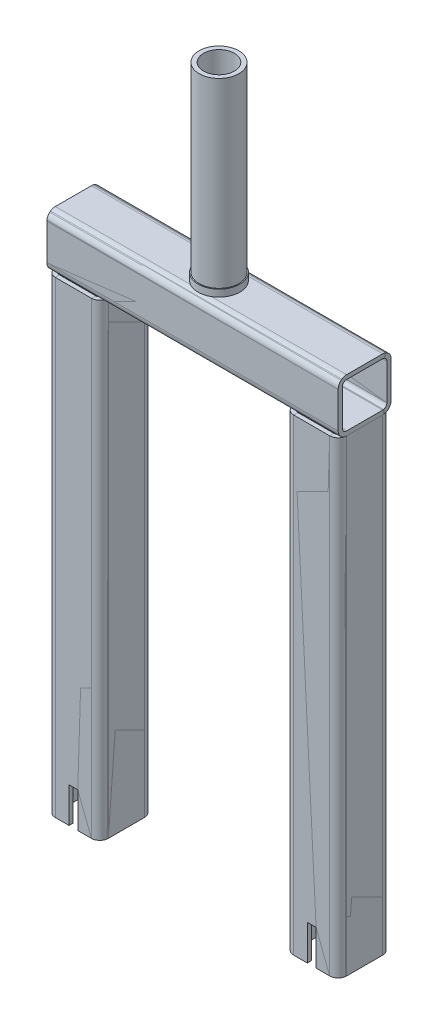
ISO-10303-21;
HEADER;
FILE_DESCRIPTION(('STEP AP214'),'2;1');
FILE_NAME('part.step','',(''),(''),'','','');
FILE_SCHEMA(('AUTOMOTIVE_DESIGN { 1 0 10303 214 1 1 1 1 }'));
ENDSEC;
DATA;
#1=APPLICATION_CONTEXT('core data for automotive mechanical design processes');
#2=APPLICATION_PROTOCOL_DEFINITION('international standard','automotive_design',2000,#1);
#3=PRODUCT_CONTEXT('',#1,'mechanical');
#4=PRODUCT('Part','Part','',(#3));
#5=PRODUCT_RELATED_PRODUCT_CATEGORY('part','',(#4));
#6=PRODUCT_DEFINITION_FORMATION('','',#4);
#7=PRODUCT_DEFINITION_CONTEXT('part definition',#1,'design');
#8=PRODUCT_DEFINITION('design','',#6,#7);
#9=PRODUCT_DEFINITION_SHAPE('','',#8);
#10=(LENGTH_UNIT() NAMED_UNIT(*) SI_UNIT(.MILLI.,.METRE.));
#11=(NAMED_UNIT(*) PLANE_ANGLE_UNIT() SI_UNIT($,.RADIAN.));
#12=(NAMED_UNIT(*) SI_UNIT($,.STERADIAN.) SOLID_ANGLE_UNIT());
#13=UNCERTAINTY_MEASURE_WITH_UNIT(LENGTH_MEASURE(1.E-05),#10,'distance_accuracy_value','');
#14=(GEOMETRIC_REPRESENTATION_CONTEXT(3) GLOBAL_UNCERTAINTY_ASSIGNED_CONTEXT((#13)) GLOBAL_UNIT_ASSIGNED_CONTEXT((#10,
#11,#12)) REPRESENTATION_CONTEXT('',''));
#15=CARTESIAN_POINT('',(0.,0.,0.));
#16=DIRECTION('',(0.,0.,1.));
#17=DIRECTION('',(1.,0.,0.));
#18=AXIS2_PLACEMENT_3D('',#15,#16,#17);
#19=CARTESIAN_POINT('',(0.,154.849999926,0.));
#20=DIRECTION('',(0.,1.,0.));
#21=DIRECTION('',(-1.,0.,0.));
#22=AXIS2_PLACEMENT_3D('',#19,#20,#21);
#23=CYLINDRICAL_SURFACE('',#22,14.2875);
#24=CARTESIAN_POINT('',(0.,24.049999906,0.));
#25=DIRECTION('',(0.,1.,0.));
#26=DIRECTION('',(-1.,0.,0.));
#27=AXIS2_PLACEMENT_3D('',#24,#25,#26);
#28=CIRCLE('',#27,14.2875);
#29=CARTESIAN_POINT('',(-14.2875,24.049999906,0.));
#30=VERTEX_POINT('',#29);
#31=EDGE_CURVE('E12',#30,#30,#28,.T.);
#32=ORIENTED_EDGE('',*,*,#31,.T.);
#33=EDGE_LOOP('',(#32));
#34=FACE_BOUND('',#33,.T.);
#35=CARTESIAN_POINT('',(0.,19.05,0.));
#36=DIRECTION('',(0.,1.,0.));
#37=DIRECTION('',(-1.,0.,0.));
#38=AXIS2_PLACEMENT_3D('',#35,#36,#37);
#39=CIRCLE('',#38,14.2875);
#40=CARTESIAN_POINT('',(-14.2875,19.05,0.));
#41=VERTEX_POINT('',#40);
#42=EDGE_CURVE('E124',#41,#41,#39,.T.);
#43=ORIENTED_EDGE('',*,*,#42,.F.);
#44=EDGE_LOOP('',(#43));
#45=FACE_BOUND('',#44,.T.);
#46=ADVANCED_FACE('F110',(#34,#45),#23,.F.);
#47=CARTESIAN_POINT('',(-14.2875,24.049999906,0.));
#48=DIRECTION('',(0.,1.,0.));
#49=DIRECTION('',(-1.,0.,0.));
#50=AXIS2_PLACEMENT_3D('',#47,#48,#49);
#51=PLANE('',#50);
#52=CARTESIAN_POINT('',(0.,24.049999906,0.));
#53=DIRECTION('',(0.,1.,0.));
#54=DIRECTION('',(-1.,0.,0.));
#55=AXIS2_PLACEMENT_3D('',#52,#53,#54);
#56=CIRCLE('',#55,14.9987);
#57=CARTESIAN_POINT('',(-14.9987,24.049999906,0.));
#58=VERTEX_POINT('',#57);
#59=EDGE_CURVE('E116',#58,#58,#56,.T.);
#60=ORIENTED_EDGE('',*,*,#59,.T.);
#61=EDGE_LOOP('',(#60));
#62=FACE_BOUND('',#61,.T.);
#63=ORIENTED_EDGE('',*,*,#31,.F.);
#64=EDGE_LOOP('',(#63));
#65=FACE_BOUND('',#64,.T.);
#66=ADVANCED_FACE('F134',(#62,#65),#51,.T.);
#67=CARTESIAN_POINT('',(0.,154.849999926,0.));
#68=DIRECTION('',(0.,1.,0.));
#69=DIRECTION('',(-1.,0.,0.));
#70=AXIS2_PLACEMENT_3D('',#67,#68,#69);
#71=CYLINDRICAL_SURFACE('',#70,14.9987);
#72=CARTESIAN_POINT('',(0.,19.05,0.));
#73=DIRECTION('',(0.,1.,0.));
#74=DIRECTION('',(-1.,0.,0.));
#75=AXIS2_PLACEMENT_3D('',#72,#73,#74);
#76=CIRCLE('',#75,14.9987);
#77=CARTESIAN_POINT('',(-14.9987,19.05,0.));
#78=VERTEX_POINT('',#77);
#79=EDGE_CURVE('E120',#78,#78,#76,.T.);
#80=ORIENTED_EDGE('',*,*,#79,.T.);
#81=EDGE_LOOP('',(#80));
#82=FACE_BOUND('',#81,.T.);
#83=ORIENTED_EDGE('',*,*,#59,.F.);
#84=EDGE_LOOP('',(#83));
#85=FACE_BOUND('',#84,.T.);
#86=ADVANCED_FACE('F138',(#82,#85),#71,.T.);
#87=CARTESIAN_POINT('',(-14.2875,19.05,0.));
#88=DIRECTION('',(0.,-1.,0.));
#89=DIRECTION('',(1.,0.,0.));
#90=AXIS2_PLACEMENT_3D('',#87,#88,#89);
#91=PLANE('',#90);
#92=ORIENTED_EDGE('',*,*,#42,.T.);
#93=EDGE_LOOP('',(#92));
#94=FACE_BOUND('',#93,.T.);
#95=ORIENTED_EDGE('',*,*,#79,.F.);
#96=EDGE_LOOP('',(#95));
#97=FACE_BOUND('',#96,.T.);
#98=ADVANCED_FACE('F130',(#94,#97),#91,.T.);
#99=CLOSED_SHELL('',(#46,#66,#86,#98));
#100=MANIFOLD_SOLID_BREP('B2',#99);
#101=CARTESIAN_POINT('',(0.,154.849999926,0.));
#102=DIRECTION('',(0.,1.,0.));
#103=DIRECTION('',(-1.,0.,0.));
#104=AXIS2_PLACEMENT_3D('',#101,#102,#103);
#105=PLANE('',#104);
#106=CARTESIAN_POINT('',(0.,154.849999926,0.));
#107=DIRECTION('',(0.,1.,0.));
#108=DIRECTION('',(-1.,0.,0.));
#109=AXIS2_PLACEMENT_3D('',#106,#107,#108);
#110=CIRCLE('',#109,14.2875);
#111=CARTESIAN_POINT('',(-14.2875,154.849999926,0.));
#112=VERTEX_POINT('',#111);
#113=EDGE_CURVE('E109',#112,#112,#110,.T.);
#114=ORIENTED_EDGE('',*,*,#113,.T.);
#115=EDGE_LOOP('',(#114));
#116=FACE_BOUND('',#115,.T.);
#117=CARTESIAN_POINT('',(0.,154.849999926,0.));
#118=DIRECTION('',(0.,1.,0.));
#119=DIRECTION('',(-1.,0.,0.));
#120=AXIS2_PLACEMENT_3D('',#117,#118,#119);
#121=CIRCLE('',#120,11.1125);
#122=CARTESIAN_POINT('',(-11.1125,154.849999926,0.));
#123=VERTEX_POINT('',#122);
#124=EDGE_CURVE('E193',#123,#123,#121,.T.);
#125=ORIENTED_EDGE('',*,*,#124,.F.);
#126=EDGE_LOOP('',(#125));
#127=FACE_BOUND('',#126,.T.);
#128=ADVANCED_FACE('F182',(#116,#127),#105,.T.);
#129=CARTESIAN_POINT('',(0.,19.05,0.));
#130=DIRECTION('',(0.,1.,0.));
#131=DIRECTION('',(-1.,0.,0.));
#132=AXIS2_PLACEMENT_3D('',#129,#130,#131);
#133=PLANE('',#132);
#134=CARTESIAN_POINT('',(0.,19.05,0.));
#135=DIRECTION('',(0.,1.,0.));
#136=DIRECTION('',(-1.,0.,0.));
#137=AXIS2_PLACEMENT_3D('',#134,#135,#136);
#138=CIRCLE('',#137,14.2875);
#139=CARTESIAN_POINT('',(-14.2875,19.05,0.));
#140=VERTEX_POINT('',#139);
#141=EDGE_CURVE('E186',#140,#140,#138,.T.);
#142=ORIENTED_EDGE('',*,*,#141,.F.);
#143=EDGE_LOOP('',(#142));
#144=FACE_BOUND('',#143,.T.);
#145=CARTESIAN_POINT('',(0.,19.05,0.));
#146=DIRECTION('',(0.,1.,0.));
#147=DIRECTION('',(-1.,0.,0.));
#148=AXIS2_PLACEMENT_3D('',#145,#146,#147);
#149=CIRCLE('',#148,11.1125);
#150=CARTESIAN_POINT('',(-11.1125,19.05,0.));
#151=VERTEX_POINT('',#150);
#152=EDGE_CURVE('E195',#151,#151,#149,.T.);
#153=ORIENTED_EDGE('',*,*,#152,.T.);
#154=EDGE_LOOP('',(#153));
#155=FACE_BOUND('',#154,.T.);
#156=ADVANCED_FACE('F205',(#144,#155),#133,.F.);
#157=CARTESIAN_POINT('',(0.,154.849999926,0.));
#158=DIRECTION('',(0.,-1.,0.));
#159=DIRECTION('',(1.,0.,0.));
#160=AXIS2_PLACEMENT_3D('',#157,#158,#159);
#161=CYLINDRICAL_SURFACE('',#160,14.2875);
#162=ORIENTED_EDGE('',*,*,#113,.F.);
#163=EDGE_LOOP('',(#162));
#164=FACE_BOUND('',#163,.T.);
#165=ORIENTED_EDGE('',*,*,#141,.T.);
#166=EDGE_LOOP('',(#165));
#167=FACE_BOUND('',#166,.T.);
#168=ADVANCED_FACE('F184',(#164,#167),#161,.T.);
#169=CARTESIAN_POINT('',(0.,154.849999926,0.));
#170=DIRECTION('',(0.,-1.,0.));
#171=DIRECTION('',(1.,0.,0.));
#172=AXIS2_PLACEMENT_3D('',#169,#170,#171);
#173=CYLINDRICAL_SURFACE('',#172,11.1125);
#174=ORIENTED_EDGE('',*,*,#124,.T.);
#175=EDGE_LOOP('',(#174));
#176=FACE_BOUND('',#175,.T.);
#177=ORIENTED_EDGE('',*,*,#152,.F.);
#178=EDGE_LOOP('',(#177));
#179=FACE_BOUND('',#178,.T.);
#180=ADVANCED_FACE('F201',(#176,#179),#173,.F.);
#181=CLOSED_SHELL('',(#128,#156,#168,#180));
#182=MANIFOLD_SOLID_BREP('B7',#181);
#183=CARTESIAN_POINT('',(85.725,12.954,12.954));
#184=DIRECTION('',(-1.,0.,0.));
#185=DIRECTION('',(0.,-1.,0.));
#186=AXIS2_PLACEMENT_3D('',#183,#184,#185);
#187=CYLINDRICAL_SURFACE('',#186,6.09600000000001);
#188=CARTESIAN_POINT('',(-104.775,12.954,12.954));
#189=DIRECTION('',(-1.,0.,0.));
#190=DIRECTION('',(0.,-1.,0.));
#191=AXIS2_PLACEMENT_3D('',#188,#189,#190);
#192=CIRCLE('',#191,6.09600000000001);
#193=CARTESIAN_POINT('',(-104.775,12.954,19.05));
#194=VERTEX_POINT('',#193);
#195=CARTESIAN_POINT('',(-104.775,19.05,12.954));
#196=VERTEX_POINT('',#195);
#197=EDGE_CURVE('E398',#194,#196,#192,.T.);
#198=ORIENTED_EDGE('',*,*,#197,.F.);
#199=DIRECTION('',(-1.,0.,0.));
#200=VECTOR('',#199,1.);
#201=CARTESIAN_POINT('',(85.725,12.954,19.05));
#202=LINE('',#201,#200);
#203=CARTESIAN_POINT('',(104.775,12.954,19.05));
#204=VERTEX_POINT('',#203);
#205=EDGE_CURVE('E478',#204,#194,#202,.T.);
#206=ORIENTED_EDGE('',*,*,#205,.F.);
#207=CARTESIAN_POINT('',(104.775,12.954,12.954));
#208=DIRECTION('',(1.,0.,0.));
#209=DIRECTION('',(0.,1.,0.));
#210=AXIS2_PLACEMENT_3D('',#207,#208,#209);
#211=CIRCLE('',#210,6.09600000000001);
#212=CARTESIAN_POINT('',(104.775,19.05,12.954));
#213=VERTEX_POINT('',#212);
#214=EDGE_CURVE('E389',#213,#204,#211,.T.);
#215=ORIENTED_EDGE('',*,*,#214,.F.);
#216=DIRECTION('',(-1.,0.,0.));
#217=VECTOR('',#216,1.);
#218=CARTESIAN_POINT('',(85.725,19.05,12.954));
#219=LINE('',#218,#217);
#220=EDGE_CURVE('E258',#213,#196,#219,.T.);
#221=ORIENTED_EDGE('',*,*,#220,.T.);
#222=EDGE_LOOP('',(#198,#206,#215,#221));
#223=FACE_BOUND('',#222,.T.);
#224=ADVANCED_FACE('F254',(#223),#187,.T.);
#225=CARTESIAN_POINT('',(85.725,12.954,19.05));
#226=DIRECTION('',(0.,0.,-1.));
#227=DIRECTION('',(0.,1.,0.));
#228=AXIS2_PLACEMENT_3D('',#225,#226,#227);
#229=PLANE('',#228);
#230=DIRECTION('',(0.,1.,0.));
#231=VECTOR('',#230,1.);
#232=CARTESIAN_POINT('',(-104.775,12.954,19.05));
#233=LINE('',#232,#231);
#234=CARTESIAN_POINT('',(-104.775,-12.954,19.05));
#235=VERTEX_POINT('',#234);
#236=EDGE_CURVE('E395',#235,#194,#233,.T.);
#237=ORIENTED_EDGE('',*,*,#236,.F.);
#238=DIRECTION('',(-1.,0.,0.));
#239=VECTOR('',#238,1.);
#240=CARTESIAN_POINT('',(85.725,-12.954,19.05));
#241=LINE('',#240,#239);
#242=CARTESIAN_POINT('',(104.775,-12.954,19.05));
#243=VERTEX_POINT('',#242);
#244=EDGE_CURVE('E476',#243,#235,#241,.T.);
#245=ORIENTED_EDGE('',*,*,#244,.F.);
#246=DIRECTION('',(0.,-1.,0.));
#247=VECTOR('',#246,1.);
#248=CARTESIAN_POINT('',(104.775,12.954,19.05));
#249=LINE('',#248,#247);
#250=EDGE_CURVE('E494',#204,#243,#249,.T.);
#251=ORIENTED_EDGE('',*,*,#250,.F.);
#252=ORIENTED_EDGE('',*,*,#205,.T.);
#253=EDGE_LOOP('',(#237,#245,#251,#252));
#254=FACE_BOUND('',#253,.T.);
#255=ADVANCED_FACE('F485',(#254),#229,.F.);
#256=CARTESIAN_POINT('',(85.725,-12.954,12.954));
#257=DIRECTION('',(-1.,0.,0.));
#258=DIRECTION('',(0.,-1.,0.));
#259=AXIS2_PLACEMENT_3D('',#256,#257,#258);
#260=CYLINDRICAL_SURFACE('',#259,6.09600000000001);
#261=CARTESIAN_POINT('',(-104.775,-12.954,12.954));
#262=DIRECTION('',(-1.,0.,0.));
#263=DIRECTION('',(0.,-1.,0.));
#264=AXIS2_PLACEMENT_3D('',#261,#262,#263);
#265=CIRCLE('',#264,6.09600000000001);
#266=CARTESIAN_POINT('',(-104.775,-19.05,12.954));
#267=VERTEX_POINT('',#266);
#268=EDGE_CURVE('E180',#267,#235,#265,.T.);
#269=ORIENTED_EDGE('',*,*,#268,.F.);
#270=DIRECTION('',(-1.,0.,0.));
#271=VECTOR('',#270,1.);
#272=CARTESIAN_POINT('',(85.725,-19.05,12.954));
#273=LINE('',#272,#271);
#274=CARTESIAN_POINT('',(104.775,-19.05,12.954));
#275=VERTEX_POINT('',#274);
#276=EDGE_CURVE('E473',#275,#267,#273,.T.);
#277=ORIENTED_EDGE('',*,*,#276,.F.);
#278=CARTESIAN_POINT('',(104.775,-12.954,12.954));
#279=DIRECTION('',(1.,0.,0.));
#280=DIRECTION('',(0.,1.,0.));
#281=AXIS2_PLACEMENT_3D('',#278,#279,#280);
#282=CIRCLE('',#281,6.09600000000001);
#283=EDGE_CURVE('E491',#243,#275,#282,.T.);
#284=ORIENTED_EDGE('',*,*,#283,.F.);
#285=ORIENTED_EDGE('',*,*,#244,.T.);
#286=EDGE_LOOP('',(#269,#277,#284,#285));
#287=FACE_BOUND('',#286,.T.);
#288=ADVANCED_FACE('F488',(#287),#260,.T.);
#289=CARTESIAN_POINT('',(85.725,-19.05,-12.954));
#290=DIRECTION('',(0.,1.,0.));
#291=DIRECTION('',(0.,0.,1.));
#292=AXIS2_PLACEMENT_3D('',#289,#290,#291);
#293=PLANE('',#292);
#294=DIRECTION('',(0.,0.,1.));
#295=VECTOR('',#294,1.);
#296=CARTESIAN_POINT('',(-104.775,-19.05,-12.954));
#297=LINE('',#296,#295);
#298=CARTESIAN_POINT('',(-104.775,-19.05,-12.954));
#299=VERTEX_POINT('',#298);
#300=EDGE_CURVE('E264',#299,#267,#297,.T.);
#301=ORIENTED_EDGE('',*,*,#300,.F.);
#302=DIRECTION('',(-1.,0.,0.));
#303=VECTOR('',#302,1.);
#304=CARTESIAN_POINT('',(85.725,-19.05,-12.954));
#305=LINE('',#304,#303);
#306=CARTESIAN_POINT('',(104.775,-19.05,-12.954));
#307=VERTEX_POINT('',#306);
#308=EDGE_CURVE('E470',#307,#299,#305,.T.);
#309=ORIENTED_EDGE('',*,*,#308,.F.);
#310=DIRECTION('',(0.,0.,-1.));
#311=VECTOR('',#310,1.);
#312=CARTESIAN_POINT('',(104.775,-19.05,-12.954));
#313=LINE('',#312,#311);
#314=EDGE_CURVE('E493',#275,#307,#313,.T.);
#315=ORIENTED_EDGE('',*,*,#314,.F.);
#316=ORIENTED_EDGE('',*,*,#276,.T.);
#317=EDGE_LOOP('',(#301,#309,#315,#316));
#318=FACE_BOUND('',#317,.T.);
#319=ADVANCED_FACE('F504',(#318),#293,.F.);
#320=CARTESIAN_POINT('',(85.725,-12.954,-12.954));
#321=DIRECTION('',(-1.,0.,0.));
#322=DIRECTION('',(0.,-1.,0.));
#323=AXIS2_PLACEMENT_3D('',#320,#321,#322);
#324=CYLINDRICAL_SURFACE('',#323,6.096);
#325=CARTESIAN_POINT('',(-104.775,-12.954,-12.954));
#326=DIRECTION('',(-1.,0.,0.));
#327=DIRECTION('',(0.,-1.,0.));
#328=AXIS2_PLACEMENT_3D('',#325,#326,#327);
#329=CIRCLE('',#328,6.096);
#330=CARTESIAN_POINT('',(-104.775,-12.954,-19.05));
#331=VERTEX_POINT('',#330);
#332=EDGE_CURVE('E413',#331,#299,#329,.T.);
#333=ORIENTED_EDGE('',*,*,#332,.F.);
#334=DIRECTION('',(-1.,0.,0.));
#335=VECTOR('',#334,1.);
#336=CARTESIAN_POINT('',(85.725,-12.954,-19.05));
#337=LINE('',#336,#335);
#338=CARTESIAN_POINT('',(104.775,-12.954,-19.05));
#339=VERTEX_POINT('',#338);
#340=EDGE_CURVE('E467',#339,#331,#337,.T.);
#341=ORIENTED_EDGE('',*,*,#340,.F.);
#342=CARTESIAN_POINT('',(104.775,-12.954,-12.954));
#343=DIRECTION('',(1.,0.,0.));
#344=DIRECTION('',(0.,1.,0.));
#345=AXIS2_PLACEMENT_3D('',#342,#343,#344);
#346=CIRCLE('',#345,6.096);
#347=EDGE_CURVE('E400',#307,#339,#346,.T.);
#348=ORIENTED_EDGE('',*,*,#347,.F.);
#349=ORIENTED_EDGE('',*,*,#308,.T.);
#350=EDGE_LOOP('',(#333,#341,#348,#349));
#351=FACE_BOUND('',#350,.T.);
#352=ADVANCED_FACE('F502',(#351),#324,.T.);
#353=CARTESIAN_POINT('',(85.725,-12.954,-19.05));
#354=DIRECTION('',(0.,0.,1.));
#355=DIRECTION('',(0.,-1.,0.));
#356=AXIS2_PLACEMENT_3D('',#353,#354,#355);
#357=PLANE('',#356);
#358=DIRECTION('',(0.,-1.,0.));
#359=VECTOR('',#358,1.);
#360=CARTESIAN_POINT('',(-104.775,-12.954,-19.05));
#361=LINE('',#360,#359);
#362=CARTESIAN_POINT('',(-104.775,12.954,-19.05));
#363=VERTEX_POINT('',#362);
#364=EDGE_CURVE('E416',#363,#331,#361,.T.);
#365=ORIENTED_EDGE('',*,*,#364,.F.);
#366=DIRECTION('',(-1.,0.,0.));
#367=VECTOR('',#366,1.);
#368=CARTESIAN_POINT('',(85.725,12.954,-19.05));
#369=LINE('',#368,#367);
#370=CARTESIAN_POINT('',(104.775,12.954,-19.05));
#371=VERTEX_POINT('',#370);
#372=EDGE_CURVE('E465',#371,#363,#369,.T.);
#373=ORIENTED_EDGE('',*,*,#372,.F.);
#374=DIRECTION('',(0.,1.,0.));
#375=VECTOR('',#374,1.);
#376=CARTESIAN_POINT('',(104.775,-12.954,-19.05));
#377=LINE('',#376,#375);
#378=EDGE_CURVE('E394',#339,#371,#377,.T.);
#379=ORIENTED_EDGE('',*,*,#378,.F.);
#380=ORIENTED_EDGE('',*,*,#340,.T.);
#381=EDGE_LOOP('',(#365,#373,#379,#380));
#382=FACE_BOUND('',#381,.T.);
#383=ADVANCED_FACE('F506',(#382),#357,.F.);
#384=CARTESIAN_POINT('',(85.725,12.954,-12.954));
#385=DIRECTION('',(-1.,0.,0.));
#386=DIRECTION('',(0.,-1.,0.));
#387=AXIS2_PLACEMENT_3D('',#384,#385,#386);
#388=CYLINDRICAL_SURFACE('',#387,6.09600000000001);
#389=CARTESIAN_POINT('',(-104.775,12.954,-12.954));
#390=DIRECTION('',(-1.,0.,0.));
#391=DIRECTION('',(0.,-1.,0.));
#392=AXIS2_PLACEMENT_3D('',#389,#390,#391);
#393=CIRCLE('',#392,6.09600000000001);
#394=CARTESIAN_POINT('',(-104.775,19.05,-12.954));
#395=VERTEX_POINT('',#394);
#396=EDGE_CURVE('E377',#395,#363,#393,.T.);
#397=ORIENTED_EDGE('',*,*,#396,.F.);
#398=DIRECTION('',(-1.,0.,0.));
#399=VECTOR('',#398,1.);
#400=CARTESIAN_POINT('',(85.725,19.05,-12.954));
#401=LINE('',#400,#399);
#402=CARTESIAN_POINT('',(104.775,19.05,-12.954));
#403=VERTEX_POINT('',#402);
#404=EDGE_CURVE('E369',#403,#395,#401,.T.);
#405=ORIENTED_EDGE('',*,*,#404,.F.);
#406=CARTESIAN_POINT('',(104.775,12.954,-12.954));
#407=DIRECTION('',(1.,0.,0.));
#408=DIRECTION('',(0.,1.,0.));
#409=AXIS2_PLACEMENT_3D('',#406,#407,#408);
#410=CIRCLE('',#409,6.09600000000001);
#411=EDGE_CURVE('E374',#371,#403,#410,.T.);
#412=ORIENTED_EDGE('',*,*,#411,.F.);
#413=ORIENTED_EDGE('',*,*,#372,.T.);
#414=EDGE_LOOP('',(#397,#405,#412,#413));
#415=FACE_BOUND('',#414,.T.);
#416=ADVANCED_FACE('F371',(#415),#388,.T.);
#417=CARTESIAN_POINT('',(85.725,-12.954,12.954));
#418=DIRECTION('',(-1.,0.,0.));
#419=DIRECTION('',(0.,-1.,0.));
#420=AXIS2_PLACEMENT_3D('',#417,#418,#419);
#421=CYLINDRICAL_SURFACE('',#420,3.048);
#422=DIRECTION('',(-1.,0.,0.));
#423=VECTOR('',#422,1.);
#424=CARTESIAN_POINT('',(85.725,-16.002,12.954));
#425=LINE('',#424,#423);
#426=CARTESIAN_POINT('',(104.775,-16.002,12.954));
#427=VERTEX_POINT('',#426);
#428=CARTESIAN_POINT('',(-104.775,-16.002,12.954));
#429=VERTEX_POINT('',#428);
#430=EDGE_CURVE('E422',#427,#429,#425,.T.);
#431=ORIENTED_EDGE('',*,*,#430,.T.);
#432=CARTESIAN_POINT('',(-104.775,-12.954,12.954));
#433=DIRECTION('',(-1.,0.,0.));
#434=DIRECTION('',(0.,-1.,0.));
#435=AXIS2_PLACEMENT_3D('',#432,#433,#434);
#436=CIRCLE('',#435,3.048);
#437=CARTESIAN_POINT('',(-104.775,-12.9540000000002,16.002));
#438=VERTEX_POINT('',#437);
#439=EDGE_CURVE('E300',#429,#438,#436,.T.);
#440=ORIENTED_EDGE('',*,*,#439,.T.);
#441=DIRECTION('',(-1.,0.,0.));
#442=VECTOR('',#441,1.);
#443=CARTESIAN_POINT('',(85.725,-12.954,16.002));
#444=LINE('',#443,#442);
#445=CARTESIAN_POINT('',(104.775,-12.954,16.002));
#446=VERTEX_POINT('',#445);
#447=EDGE_CURVE('E425',#446,#438,#444,.T.);
#448=ORIENTED_EDGE('',*,*,#447,.F.);
#449=CARTESIAN_POINT('',(104.775,-12.954,12.954));
#450=DIRECTION('',(1.,0.,0.));
#451=DIRECTION('',(0.,1.,0.));
#452=AXIS2_PLACEMENT_3D('',#449,#450,#451);
#453=CIRCLE('',#452,3.048);
#454=EDGE_CURVE('E421',#446,#427,#453,.T.);
#455=ORIENTED_EDGE('',*,*,#454,.T.);
#456=EDGE_LOOP('',(#431,#440,#448,#455));
#457=FACE_BOUND('',#456,.T.);
#458=ADVANCED_FACE('F513',(#457),#421,.F.);
#459=CARTESIAN_POINT('',(85.725,12.954,16.002));
#460=DIRECTION('',(0.,0.,-1.));
#461=DIRECTION('',(0.,1.,0.));
#462=AXIS2_PLACEMENT_3D('',#459,#460,#461);
#463=PLANE('',#462);
#464=ORIENTED_EDGE('',*,*,#447,.T.);
#465=DIRECTION('',(0.,1.,0.));
#466=VECTOR('',#465,1.);
#467=CARTESIAN_POINT('',(-104.775,12.954,16.002));
#468=LINE('',#467,#466);
#469=CARTESIAN_POINT('',(-104.775,12.954,16.002));
#470=VERTEX_POINT('',#469);
#471=EDGE_CURVE('E273',#438,#470,#468,.T.);
#472=ORIENTED_EDGE('',*,*,#471,.T.);
#473=DIRECTION('',(-1.,0.,0.));
#474=VECTOR('',#473,1.);
#475=CARTESIAN_POINT('',(85.725,12.954,16.002));
#476=LINE('',#475,#474);
#477=CARTESIAN_POINT('',(104.775,12.9540000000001,16.002));
#478=VERTEX_POINT('',#477);
#479=EDGE_CURVE('E430',#478,#470,#476,.T.);
#480=ORIENTED_EDGE('',*,*,#479,.F.);
#481=DIRECTION('',(0.,-1.,0.));
#482=VECTOR('',#481,1.);
#483=CARTESIAN_POINT('',(104.775,12.954,16.002));
#484=LINE('',#483,#482);
#485=EDGE_CURVE('E424',#478,#446,#484,.T.);
#486=ORIENTED_EDGE('',*,*,#485,.T.);
#487=EDGE_LOOP('',(#464,#472,#480,#486));
#488=FACE_BOUND('',#487,.T.);
#489=ADVANCED_FACE('F557',(#488),#463,.T.);
#490=CARTESIAN_POINT('',(85.725,12.954,12.954));
#491=DIRECTION('',(-1.,0.,0.));
#492=DIRECTION('',(0.,-1.,0.));
#493=AXIS2_PLACEMENT_3D('',#490,#491,#492);
#494=CYLINDRICAL_SURFACE('',#493,3.048);
#495=ORIENTED_EDGE('',*,*,#479,.T.);
#496=CARTESIAN_POINT('',(-104.775,12.954,12.954));
#497=DIRECTION('',(-1.,0.,0.));
#498=DIRECTION('',(0.,-1.,0.));
#499=AXIS2_PLACEMENT_3D('',#496,#497,#498);
#500=CIRCLE('',#499,3.048);
#501=CARTESIAN_POINT('',(-104.775,16.002,12.954));
#502=VERTEX_POINT('',#501);
#503=EDGE_CURVE('E426',#470,#502,#500,.T.);
#504=ORIENTED_EDGE('',*,*,#503,.T.);
#505=DIRECTION('',(-1.,0.,0.));
#506=VECTOR('',#505,1.);
#507=CARTESIAN_POINT('',(85.725,16.002,12.954));
#508=LINE('',#507,#506);
#509=CARTESIAN_POINT('',(104.775,16.002,12.954));
#510=VERTEX_POINT('',#509);
#511=EDGE_CURVE('E435',#510,#502,#508,.T.);
#512=ORIENTED_EDGE('',*,*,#511,.F.);
#513=CARTESIAN_POINT('',(104.775,12.954,12.954));
#514=DIRECTION('',(1.,0.,0.));
#515=DIRECTION('',(0.,1.,0.));
#516=AXIS2_PLACEMENT_3D('',#513,#514,#515);
#517=CIRCLE('',#516,3.048);
#518=EDGE_CURVE('E429',#510,#478,#517,.T.);
#519=ORIENTED_EDGE('',*,*,#518,.T.);
#520=EDGE_LOOP('',(#495,#504,#512,#519));
#521=FACE_BOUND('',#520,.T.);
#522=ADVANCED_FACE('F568',(#521),#494,.F.);
#523=CARTESIAN_POINT('',(85.725,16.002,12.954));
#524=DIRECTION('',(0.,-1.,0.));
#525=DIRECTION('',(1.,0.,0.));
#526=AXIS2_PLACEMENT_3D('',#523,#524,#525);
#527=PLANE('',#526);
#528=ORIENTED_EDGE('',*,*,#511,.T.);
#529=DIRECTION('',(0.,0.,-1.));
#530=VECTOR('',#529,1.);
#531=CARTESIAN_POINT('',(-104.775,16.002,12.954));
#532=LINE('',#531,#530);
#533=CARTESIAN_POINT('',(-104.775,16.002,-12.954));
#534=VERTEX_POINT('',#533);
#535=EDGE_CURVE('E431',#502,#534,#532,.T.);
#536=ORIENTED_EDGE('',*,*,#535,.T.);
#537=DIRECTION('',(-1.,0.,0.));
#538=VECTOR('',#537,1.);
#539=CARTESIAN_POINT('',(85.725,16.002,-12.954));
#540=LINE('',#539,#538);
#541=CARTESIAN_POINT('',(104.775,16.002,-12.954));
#542=VERTEX_POINT('',#541);
#543=EDGE_CURVE('E440',#542,#534,#540,.T.);
#544=ORIENTED_EDGE('',*,*,#543,.F.);
#545=DIRECTION('',(0.,0.,1.));
#546=VECTOR('',#545,1.);
#547=CARTESIAN_POINT('',(104.775,16.002,12.954));
#548=LINE('',#547,#546);
#549=EDGE_CURVE('E434',#542,#510,#548,.T.);
#550=ORIENTED_EDGE('',*,*,#549,.T.);
#551=EDGE_LOOP('',(#528,#536,#544,#550));
#552=FACE_BOUND('',#551,.T.);
#553=ADVANCED_FACE('F579',(#552),#527,.T.);
#554=CARTESIAN_POINT('',(85.725,12.954,-12.954));
#555=DIRECTION('',(-1.,0.,0.));
#556=DIRECTION('',(0.,-1.,0.));
#557=AXIS2_PLACEMENT_3D('',#554,#555,#556);
#558=CYLINDRICAL_SURFACE('',#557,3.048);
#559=ORIENTED_EDGE('',*,*,#543,.T.);
#560=CARTESIAN_POINT('',(-104.775,12.954,-12.954));
#561=DIRECTION('',(-1.,0.,0.));
#562=DIRECTION('',(0.,-1.,0.));
#563=AXIS2_PLACEMENT_3D('',#560,#561,#562);
#564=CIRCLE('',#563,3.048);
#565=CARTESIAN_POINT('',(-104.775,12.9540000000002,-16.002));
#566=VERTEX_POINT('',#565);
#567=EDGE_CURVE('E436',#534,#566,#564,.T.);
#568=ORIENTED_EDGE('',*,*,#567,.T.);
#569=DIRECTION('',(-1.,0.,0.));
#570=VECTOR('',#569,1.);
#571=CARTESIAN_POINT('',(85.725,12.954,-16.002));
#572=LINE('',#571,#570);
#573=CARTESIAN_POINT('',(104.775,12.9540000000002,-16.002));
#574=VERTEX_POINT('',#573);
#575=EDGE_CURVE('E445',#574,#566,#572,.T.);
#576=ORIENTED_EDGE('',*,*,#575,.F.);
#577=CARTESIAN_POINT('',(104.775,12.954,-12.954));
#578=DIRECTION('',(1.,0.,0.));
#579=DIRECTION('',(0.,1.,0.));
#580=AXIS2_PLACEMENT_3D('',#577,#578,#579);
#581=CIRCLE('',#580,3.048);
#582=EDGE_CURVE('E439',#574,#542,#581,.T.);
#583=ORIENTED_EDGE('',*,*,#582,.T.);
#584=EDGE_LOOP('',(#559,#568,#576,#583));
#585=FACE_BOUND('',#584,.T.);
#586=ADVANCED_FACE('F590',(#585),#558,.F.);
#587=CARTESIAN_POINT('',(85.725,-12.954,-16.002));
#588=DIRECTION('',(0.,0.,1.));
#589=DIRECTION('',(0.,-1.,0.));
#590=AXIS2_PLACEMENT_3D('',#587,#588,#589);
#591=PLANE('',#590);
#592=ORIENTED_EDGE('',*,*,#575,.T.);
#593=DIRECTION('',(0.,-1.,0.));
#594=VECTOR('',#593,1.);
#595=CARTESIAN_POINT('',(-104.775,-12.954,-16.002));
#596=LINE('',#595,#594);
#597=CARTESIAN_POINT('',(-104.775,-12.954,-16.002));
#598=VERTEX_POINT('',#597);
#599=EDGE_CURVE('E441',#566,#598,#596,.T.);
#600=ORIENTED_EDGE('',*,*,#599,.T.);
#601=DIRECTION('',(-1.,0.,0.));
#602=VECTOR('',#601,1.);
#603=CARTESIAN_POINT('',(85.725,-12.954,-16.002));
#604=LINE('',#603,#602);
#605=CARTESIAN_POINT('',(104.775,-12.9539999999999,-16.002));
#606=VERTEX_POINT('',#605);
#607=EDGE_CURVE('E449',#606,#598,#604,.T.);
#608=ORIENTED_EDGE('',*,*,#607,.F.);
#609=DIRECTION('',(0.,1.,0.));
#610=VECTOR('',#609,1.);
#611=CARTESIAN_POINT('',(104.775,-12.954,-16.002));
#612=LINE('',#611,#610);
#613=EDGE_CURVE('E444',#606,#574,#612,.T.);
#614=ORIENTED_EDGE('',*,*,#613,.T.);
#615=EDGE_LOOP('',(#592,#600,#608,#614));
#616=FACE_BOUND('',#615,.T.);
#617=ADVANCED_FACE('F601',(#616),#591,.T.);
#618=CARTESIAN_POINT('',(85.725,-12.954,-12.954));
#619=DIRECTION('',(-1.,0.,0.));
#620=DIRECTION('',(0.,-1.,0.));
#621=AXIS2_PLACEMENT_3D('',#618,#619,#620);
#622=CYLINDRICAL_SURFACE('',#621,3.048);
#623=ORIENTED_EDGE('',*,*,#607,.T.);
#624=CARTESIAN_POINT('',(-104.775,-12.954,-12.954));
#625=DIRECTION('',(-1.,0.,0.));
#626=DIRECTION('',(0.,-1.,0.));
#627=AXIS2_PLACEMENT_3D('',#624,#625,#626);
#628=CIRCLE('',#627,3.048);
#629=CARTESIAN_POINT('',(-104.775,-16.002,-12.954));
#630=VERTEX_POINT('',#629);
#631=EDGE_CURVE('E446',#598,#630,#628,.T.);
#632=ORIENTED_EDGE('',*,*,#631,.T.);
#633=DIRECTION('',(-1.,0.,0.));
#634=VECTOR('',#633,1.);
#635=CARTESIAN_POINT('',(85.725,-16.002,-12.954));
#636=LINE('',#635,#634);
#637=CARTESIAN_POINT('',(104.775,-16.002,-12.954));
#638=VERTEX_POINT('',#637);
#639=EDGE_CURVE('E407',#638,#630,#636,.T.);
#640=ORIENTED_EDGE('',*,*,#639,.F.);
#641=CARTESIAN_POINT('',(104.775,-12.954,-12.954));
#642=DIRECTION('',(1.,0.,0.));
#643=DIRECTION('',(0.,1.,0.));
#644=AXIS2_PLACEMENT_3D('',#641,#642,#643);
#645=CIRCLE('',#644,3.048);
#646=EDGE_CURVE('E448',#638,#606,#645,.T.);
#647=ORIENTED_EDGE('',*,*,#646,.T.);
#648=EDGE_LOOP('',(#623,#632,#640,#647));
#649=FACE_BOUND('',#648,.T.);
#650=ADVANCED_FACE('F612',(#649),#622,.F.);
#651=CARTESIAN_POINT('',(85.725,-16.002,-12.954));
#652=DIRECTION('',(0.,1.,0.));
#653=DIRECTION('',(0.,0.,1.));
#654=AXIS2_PLACEMENT_3D('',#651,#652,#653);
#655=PLANE('',#654);
#656=ORIENTED_EDGE('',*,*,#639,.T.);
#657=DIRECTION('',(0.,0.,1.));
#658=VECTOR('',#657,1.);
#659=CARTESIAN_POINT('',(-104.775,-16.002,-12.954));
#660=LINE('',#659,#658);
#661=EDGE_CURVE('E295',#630,#429,#660,.T.);
#662=ORIENTED_EDGE('',*,*,#661,.T.);
#663=ORIENTED_EDGE('',*,*,#430,.F.);
#664=DIRECTION('',(0.,0.,-1.));
#665=VECTOR('',#664,1.);
#666=CARTESIAN_POINT('',(104.775,-16.002,-12.954));
#667=LINE('',#666,#665);
#668=EDGE_CURVE('E382',#427,#638,#667,.T.);
#669=ORIENTED_EDGE('',*,*,#668,.T.);
#670=EDGE_LOOP('',(#656,#662,#663,#669));
#671=FACE_BOUND('',#670,.T.);
#672=ADVANCED_FACE('F623',(#671),#655,.T.);
#673=CARTESIAN_POINT('',(85.725,19.05,12.954));
#674=DIRECTION('',(0.,-1.,0.));
#675=DIRECTION('',(1.,0.,0.));
#676=AXIS2_PLACEMENT_3D('',#673,#674,#675);
#677=PLANE('',#676);
#678=DIRECTION('',(0.,0.,-1.));
#679=VECTOR('',#678,1.);
#680=CARTESIAN_POINT('',(-104.775,19.05,12.954));
#681=LINE('',#680,#679);
#682=EDGE_CURVE('E409',#196,#395,#681,.T.);
#683=ORIENTED_EDGE('',*,*,#682,.F.);
#684=ORIENTED_EDGE('',*,*,#220,.F.);
#685=DIRECTION('',(0.,0.,1.));
#686=VECTOR('',#685,1.);
#687=CARTESIAN_POINT('',(104.775,19.05,12.954));
#688=LINE('',#687,#686);
#689=EDGE_CURVE('E381',#403,#213,#688,.T.);
#690=ORIENTED_EDGE('',*,*,#689,.F.);
#691=ORIENTED_EDGE('',*,*,#404,.T.);
#692=EDGE_LOOP('',(#683,#684,#690,#691));
#693=FACE_BOUND('',#692,.T.);
#694=ADVANCED_FACE('F385',(#693),#677,.F.);
#695=CARTESIAN_POINT('',(104.775,0.,-19.05));
#696=DIRECTION('',(1.,0.,0.));
#697=DIRECTION('',(0.,1.,0.));
#698=AXIS2_PLACEMENT_3D('',#695,#696,#697);
#699=PLANE('',#698);
#700=ORIENTED_EDGE('',*,*,#454,.F.);
#701=ORIENTED_EDGE('',*,*,#485,.F.);
#702=ORIENTED_EDGE('',*,*,#518,.F.);
#703=ORIENTED_EDGE('',*,*,#549,.F.);
#704=ORIENTED_EDGE('',*,*,#582,.F.);
#705=ORIENTED_EDGE('',*,*,#613,.F.);
#706=ORIENTED_EDGE('',*,*,#646,.F.);
#707=ORIENTED_EDGE('',*,*,#668,.F.);
#708=EDGE_LOOP('',(#700,#701,#702,#703,#704,#705,#706,#707));
#709=FACE_BOUND('',#708,.T.);
#710=ORIENTED_EDGE('',*,*,#689,.T.);
#711=ORIENTED_EDGE('',*,*,#214,.T.);
#712=ORIENTED_EDGE('',*,*,#250,.T.);
#713=ORIENTED_EDGE('',*,*,#283,.T.);
#714=ORIENTED_EDGE('',*,*,#314,.T.);
#715=ORIENTED_EDGE('',*,*,#347,.T.);
#716=ORIENTED_EDGE('',*,*,#378,.T.);
#717=ORIENTED_EDGE('',*,*,#411,.T.);
#718=EDGE_LOOP('',(#710,#711,#712,#713,#714,#715,#716,#717));
#719=FACE_BOUND('',#718,.T.);
#720=ADVANCED_FACE('F392',(#709,#719),#699,.T.);
#721=CARTESIAN_POINT('',(-104.775,0.,19.05));
#722=DIRECTION('',(-1.,0.,0.));
#723=DIRECTION('',(0.,-1.,0.));
#724=AXIS2_PLACEMENT_3D('',#721,#722,#723);
#725=PLANE('',#724);
#726=ORIENTED_EDGE('',*,*,#439,.F.);
#727=ORIENTED_EDGE('',*,*,#661,.F.);
#728=ORIENTED_EDGE('',*,*,#631,.F.);
#729=ORIENTED_EDGE('',*,*,#599,.F.);
#730=ORIENTED_EDGE('',*,*,#567,.F.);
#731=ORIENTED_EDGE('',*,*,#535,.F.);
#732=ORIENTED_EDGE('',*,*,#503,.F.);
#733=ORIENTED_EDGE('',*,*,#471,.F.);
#734=EDGE_LOOP('',(#726,#727,#728,#729,#730,#731,#732,#733));
#735=FACE_BOUND('',#734,.T.);
#736=ORIENTED_EDGE('',*,*,#236,.T.);
#737=ORIENTED_EDGE('',*,*,#197,.T.);
#738=ORIENTED_EDGE('',*,*,#682,.T.);
#739=ORIENTED_EDGE('',*,*,#396,.T.);
#740=ORIENTED_EDGE('',*,*,#364,.T.);
#741=ORIENTED_EDGE('',*,*,#332,.T.);
#742=ORIENTED_EDGE('',*,*,#300,.T.);
#743=ORIENTED_EDGE('',*,*,#268,.T.);
#744=EDGE_LOOP('',(#736,#737,#738,#739,#740,#741,#742,#743));
#745=FACE_BOUND('',#744,.T.);
#746=ADVANCED_FACE('F256',(#735,#745),#725,.T.);
#747=CLOSED_SHELL('',(#224,#255,#288,#319,#352,#383,#416,#458,#489,#522,#553,#586,#617,#650,
#672,#694,#720,#746));
#748=MANIFOLD_SOLID_BREP('B104',#747);
#749=CARTESIAN_POINT('',(-98.6789999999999,-355.6,-16.002));
#750=DIRECTION('',(0.,0.,1.));
#751=DIRECTION('',(1.,0.,0.));
#752=AXIS2_PLACEMENT_3D('',#749,#750,#751);
#753=PLANE('',#752);
#754=DIRECTION('',(-1.,0.,0.));
#755=VECTOR('',#754,1.);
#756=CARTESIAN_POINT('',(-98.6789999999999,-330.2,-16.002));
#757=LINE('',#756,#755);
#758=CARTESIAN_POINT('',(-82.5499999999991,-330.2,-16.002));
#759=VERTEX_POINT('',#758);
#760=CARTESIAN_POINT('',(-88.8999999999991,-330.2,-16.002));
#761=VERTEX_POINT('',#760);
#762=EDGE_CURVE('E929',#759,#761,#757,.T.);
#763=ORIENTED_EDGE('',*,*,#762,.F.);
#764=DIRECTION('',(0.,-1.,0.));
#765=VECTOR('',#764,1.);
#766=CARTESIAN_POINT('',(-82.5499999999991,-355.6,-16.002));
#767=LINE('',#766,#765);
#768=CARTESIAN_POINT('',(-82.5499999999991,-355.6,-16.002));
#769=VERTEX_POINT('',#768);
#770=EDGE_CURVE('E969',#759,#769,#767,.T.);
#771=ORIENTED_EDGE('',*,*,#770,.T.);
#772=DIRECTION('',(1.,0.,0.));
#773=VECTOR('',#772,1.);
#774=CARTESIAN_POINT('',(-98.6789999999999,-355.6,-16.002));
#775=LINE('',#774,#773);
#776=CARTESIAN_POINT('',(-72.7709999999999,-355.6,-16.002));
#777=VERTEX_POINT('',#776);
#778=EDGE_CURVE('E1027',#769,#777,#775,.T.);
#779=ORIENTED_EDGE('',*,*,#778,.T.);
#780=DIRECTION('',(0.,1.,0.));
#781=VECTOR('',#780,1.);
#782=CARTESIAN_POINT('',(-72.7709999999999,-355.6,-16.002));
#783=LINE('',#782,#781);
#784=CARTESIAN_POINT('',(-72.7709999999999,-19.05,-16.002));
#785=VERTEX_POINT('',#784);
#786=EDGE_CURVE('E1090',#777,#785,#783,.T.);
#787=ORIENTED_EDGE('',*,*,#786,.T.);
#788=DIRECTION('',(-1.,0.,0.));
#789=VECTOR('',#788,1.);
#790=CARTESIAN_POINT('',(-98.679,-19.05,-16.002));
#791=LINE('',#790,#789);
#792=CARTESIAN_POINT('',(-98.6790000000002,-19.05,-16.002));
#793=VERTEX_POINT('',#792);
#794=EDGE_CURVE('E987',#785,#793,#791,.T.);
#795=ORIENTED_EDGE('',*,*,#794,.T.);
#796=DIRECTION('',(0.,1.,0.));
#797=VECTOR('',#796,1.);
#798=CARTESIAN_POINT('',(-98.6789999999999,-355.6,-16.002));
#799=LINE('',#798,#797);
#800=CARTESIAN_POINT('',(-98.6789999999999,-355.6,-16.002));
#801=VERTEX_POINT('',#800);
#802=EDGE_CURVE('E1087',#801,#793,#799,.T.);
#803=ORIENTED_EDGE('',*,*,#802,.F.);
#804=CARTESIAN_POINT('',(-88.8999999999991,-355.6,-16.002));
#805=VERTEX_POINT('',#804);
#806=EDGE_CURVE('E1028',#801,#805,#775,.T.);
#807=ORIENTED_EDGE('',*,*,#806,.T.);
#808=DIRECTION('',(0.,-1.,0.));
#809=VECTOR('',#808,1.);
#810=CARTESIAN_POINT('',(-88.8999999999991,-355.6,-16.002));
#811=LINE('',#810,#809);
#812=EDGE_CURVE('E961',#761,#805,#811,.T.);
#813=ORIENTED_EDGE('',*,*,#812,.F.);
#814=EDGE_LOOP('',(#763,#771,#779,#787,#795,#803,#807,#813));
#815=FACE_BOUND('',#814,.T.);
#816=ADVANCED_FACE('F761',(#815),#753,.T.);
#817=CARTESIAN_POINT('',(-72.7709999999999,-355.6,16.002));
#818=DIRECTION('',(0.,0.,-1.));
#819=DIRECTION('',(-1.,0.,0.));
#820=AXIS2_PLACEMENT_3D('',#817,#818,#819);
#821=PLANE('',#820);
#822=DIRECTION('',(-1.,0.,0.));
#823=VECTOR('',#822,1.);
#824=CARTESIAN_POINT('',(-72.7709999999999,-355.6,16.002));
#825=LINE('',#824,#823);
#826=CARTESIAN_POINT('',(-72.7709999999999,-355.6,16.002));
#827=VERTEX_POINT('',#826);
#828=CARTESIAN_POINT('',(-82.5499999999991,-355.6,16.002));
#829=VERTEX_POINT('',#828);
#830=EDGE_CURVE('E1015',#827,#829,#825,.T.);
#831=ORIENTED_EDGE('',*,*,#830,.T.);
#832=DIRECTION('',(0.,1.,0.));
#833=VECTOR('',#832,1.);
#834=CARTESIAN_POINT('',(-82.5499999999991,-355.6,16.002));
#835=LINE('',#834,#833);
#836=CARTESIAN_POINT('',(-82.5499999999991,-330.2,16.002));
#837=VERTEX_POINT('',#836);
#838=EDGE_CURVE('E966',#829,#837,#835,.T.);
#839=ORIENTED_EDGE('',*,*,#838,.T.);
#840=DIRECTION('',(1.,0.,0.));
#841=VECTOR('',#840,1.);
#842=CARTESIAN_POINT('',(-72.7709999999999,-330.2,16.002));
#843=LINE('',#842,#841);
#844=CARTESIAN_POINT('',(-88.8999999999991,-330.2,16.002));
#845=VERTEX_POINT('',#844);
#846=EDGE_CURVE('E963',#845,#837,#843,.T.);
#847=ORIENTED_EDGE('',*,*,#846,.F.);
#848=DIRECTION('',(0.,1.,0.));
#849=VECTOR('',#848,1.);
#850=CARTESIAN_POINT('',(-88.8999999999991,-355.6,16.002));
#851=LINE('',#850,#849);
#852=CARTESIAN_POINT('',(-88.8999999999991,-355.6,16.002));
#853=VERTEX_POINT('',#852);
#854=EDGE_CURVE('E958',#853,#845,#851,.T.);
#855=ORIENTED_EDGE('',*,*,#854,.F.);
#856=CARTESIAN_POINT('',(-98.6789999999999,-355.6,16.002));
#857=VERTEX_POINT('',#856);
#858=EDGE_CURVE('E1014',#853,#857,#825,.T.);
#859=ORIENTED_EDGE('',*,*,#858,.T.);
#860=DIRECTION('',(0.,1.,0.));
#861=VECTOR('',#860,1.);
#862=CARTESIAN_POINT('',(-98.6789999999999,-355.6,16.002));
#863=LINE('',#862,#861);
#864=CARTESIAN_POINT('',(-98.6790000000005,-19.05,16.002));
#865=VERTEX_POINT('',#864);
#866=EDGE_CURVE('E1062',#857,#865,#863,.T.);
#867=ORIENTED_EDGE('',*,*,#866,.T.);
#868=DIRECTION('',(1.,0.,0.));
#869=VECTOR('',#868,1.);
#870=CARTESIAN_POINT('',(-72.7709999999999,-19.05,16.002));
#871=LINE('',#870,#869);
#872=CARTESIAN_POINT('',(-72.771,-19.05,16.002));
#873=VERTEX_POINT('',#872);
#874=EDGE_CURVE('E999',#865,#873,#871,.T.);
#875=ORIENTED_EDGE('',*,*,#874,.T.);
#876=DIRECTION('',(0.,1.,0.));
#877=VECTOR('',#876,1.);
#878=CARTESIAN_POINT('',(-72.7709999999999,-355.6,16.002));
#879=LINE('',#878,#877);
#880=EDGE_CURVE('E1099',#827,#873,#879,.T.);
#881=ORIENTED_EDGE('',*,*,#880,.F.);
#882=EDGE_LOOP('',(#831,#839,#847,#855,#859,#867,#875,#881));
#883=FACE_BOUND('',#882,.T.);
#884=ADVANCED_FACE('F1104',(#883),#821,.T.);
#885=CARTESIAN_POINT('',(-72.7709999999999,-355.6,12.954));
#886=DIRECTION('',(0.,-1.,0.));
#887=DIRECTION('',(1.,0.,0.));
#888=AXIS2_PLACEMENT_3D('',#885,#886,#887);
#889=PLANE('',#888);
#890=DIRECTION('',(-1.,0.,0.));
#891=VECTOR('',#890,1.);
#892=CARTESIAN_POINT('',(-72.7709999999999,-355.6,19.05));
#893=LINE('',#892,#891);
#894=CARTESIAN_POINT('',(-72.7709999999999,-355.6,19.05));
#895=VERTEX_POINT('',#894);
#896=CARTESIAN_POINT('',(-82.5499999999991,-355.6,19.05));
#897=VERTEX_POINT('',#896);
#898=EDGE_CURVE('E1041',#895,#897,#893,.T.);
#899=ORIENTED_EDGE('',*,*,#898,.T.);
#900=DIRECTION('',(0.,0.,-1.));
#901=VECTOR('',#900,1.);
#902=CARTESIAN_POINT('',(-82.5499999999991,-355.6,45.2317207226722));
#903=LINE('',#902,#901);
#904=EDGE_CURVE('E946',#897,#829,#903,.T.);
#905=ORIENTED_EDGE('',*,*,#904,.T.);
#906=ORIENTED_EDGE('',*,*,#830,.F.);
#907=CARTESIAN_POINT('',(-72.7709999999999,-355.6,12.954));
#908=DIRECTION('',(0.,-1.,0.));
#909=DIRECTION('',(1.,0.,0.));
#910=AXIS2_PLACEMENT_3D('',#907,#908,#909);
#911=CIRCLE('',#910,3.048);
#912=CARTESIAN_POINT('',(-69.7229999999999,-355.6,12.954));
#913=VERTEX_POINT('',#912);
#914=EDGE_CURVE('E1018',#913,#827,#911,.T.);
#915=ORIENTED_EDGE('',*,*,#914,.F.);
#916=DIRECTION('',(0.,0.,1.));
#917=VECTOR('',#916,1.);
#918=CARTESIAN_POINT('',(-69.7229999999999,-355.6,12.954));
#919=LINE('',#918,#917);
#920=CARTESIAN_POINT('',(-69.7229999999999,-355.6,-12.954));
#921=VERTEX_POINT('',#920);
#922=EDGE_CURVE('E1021',#921,#913,#919,.T.);
#923=ORIENTED_EDGE('',*,*,#922,.F.);
#924=CARTESIAN_POINT('',(-72.7709999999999,-355.6,-12.954));
#925=DIRECTION('',(0.,-1.,0.));
#926=DIRECTION('',(1.,0.,0.));
#927=AXIS2_PLACEMENT_3D('',#924,#925,#926);
#928=CIRCLE('',#927,3.048);
#929=EDGE_CURVE('E1024',#777,#921,#928,.T.);
#930=ORIENTED_EDGE('',*,*,#929,.F.);
#931=ORIENTED_EDGE('',*,*,#778,.F.);
#932=CARTESIAN_POINT('',(-82.5499999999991,-355.6,-19.0499999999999));
#933=VERTEX_POINT('',#932);
#934=EDGE_CURVE('E950',#769,#933,#903,.T.);
#935=ORIENTED_EDGE('',*,*,#934,.T.);
#936=DIRECTION('',(1.,0.,0.));
#937=VECTOR('',#936,1.);
#938=CARTESIAN_POINT('',(-98.6789999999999,-355.6,-19.05));
#939=LINE('',#938,#937);
#940=CARTESIAN_POINT('',(-72.7709999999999,-355.6,-19.05));
#941=VERTEX_POINT('',#940);
#942=EDGE_CURVE('E1050',#933,#941,#939,.T.);
#943=ORIENTED_EDGE('',*,*,#942,.T.);
#944=CARTESIAN_POINT('',(-72.7709999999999,-355.6,-12.954));
#945=DIRECTION('',(0.,-1.,0.));
#946=DIRECTION('',(1.,0.,0.));
#947=AXIS2_PLACEMENT_3D('',#944,#945,#946);
#948=CIRCLE('',#947,6.09600000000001);
#949=CARTESIAN_POINT('',(-66.6749999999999,-355.6,-12.954));
#950=VERTEX_POINT('',#949);
#951=EDGE_CURVE('E1053',#941,#950,#948,.T.);
#952=ORIENTED_EDGE('',*,*,#951,.T.);
#953=DIRECTION('',(0.,0.,1.));
#954=VECTOR('',#953,1.);
#955=CARTESIAN_POINT('',(-66.6749999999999,-355.6,12.954));
#956=LINE('',#955,#954);
#957=CARTESIAN_POINT('',(-66.6749999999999,-355.6,12.954));
#958=VERTEX_POINT('',#957);
#959=EDGE_CURVE('E1055',#950,#958,#956,.T.);
#960=ORIENTED_EDGE('',*,*,#959,.T.);
#961=CARTESIAN_POINT('',(-72.7709999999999,-355.6,12.954));
#962=DIRECTION('',(0.,-1.,0.));
#963=DIRECTION('',(1.,0.,0.));
#964=AXIS2_PLACEMENT_3D('',#961,#962,#963);
#965=CIRCLE('',#964,6.09600000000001);
#966=EDGE_CURVE('E1037',#958,#895,#965,.T.);
#967=ORIENTED_EDGE('',*,*,#966,.T.);
#968=EDGE_LOOP('',(#899,#905,#906,#915,#923,#930,#931,#935,#943,#952,#960,#967));
#969=FACE_BOUND('',#968,.T.);
#970=ADVANCED_FACE('F1162',(#969),#889,.T.);
#971=CARTESIAN_POINT('',(-98.6789999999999,-355.6,-19.05));
#972=DIRECTION('',(0.,0.,1.));
#973=DIRECTION('',(1.,0.,0.));
#974=AXIS2_PLACEMENT_3D('',#971,#972,#973);
#975=PLANE('',#974);
#976=DIRECTION('',(0.,1.,0.));
#977=VECTOR('',#976,1.);
#978=CARTESIAN_POINT('',(-82.5499999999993,0.,-19.0499999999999));
#979=LINE('',#978,#977);
#980=CARTESIAN_POINT('',(-82.5499999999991,-330.2,-19.0499999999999));
#981=VERTEX_POINT('',#980);
#982=EDGE_CURVE('E941',#933,#981,#979,.T.);
#983=ORIENTED_EDGE('',*,*,#982,.T.);
#984=DIRECTION('',(1.,0.,0.));
#985=VECTOR('',#984,1.);
#986=CARTESIAN_POINT('',(0.,-330.2,-19.0499999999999));
#987=LINE('',#986,#985);
#988=CARTESIAN_POINT('',(-88.8999999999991,-330.2,-19.0499999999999));
#989=VERTEX_POINT('',#988);
#990=EDGE_CURVE('E926',#989,#981,#987,.T.);
#991=ORIENTED_EDGE('',*,*,#990,.F.);
#992=DIRECTION('',(0.,1.,0.));
#993=VECTOR('',#992,1.);
#994=CARTESIAN_POINT('',(-88.8999999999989,0.,-19.0499999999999));
#995=LINE('',#994,#993);
#996=CARTESIAN_POINT('',(-88.8999999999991,-355.6,-19.05));
#997=VERTEX_POINT('',#996);
#998=EDGE_CURVE('E933',#997,#989,#995,.T.);
#999=ORIENTED_EDGE('',*,*,#998,.F.);
#1000=CARTESIAN_POINT('',(-98.6789999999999,-355.6,-19.05));
#1001=VERTEX_POINT('',#1000);
#1002=EDGE_CURVE('E1051',#1001,#997,#939,.T.);
#1003=ORIENTED_EDGE('',*,*,#1002,.F.);
#1004=DIRECTION('',(0.,1.,0.));
#1005=VECTOR('',#1004,1.);
#1006=CARTESIAN_POINT('',(-98.6789999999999,-355.6,-19.05));
#1007=LINE('',#1006,#1005);
#1008=CARTESIAN_POINT('',(-98.6790000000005,-19.05,-19.05));
#1009=VERTEX_POINT('',#1008);
#1010=EDGE_CURVE('E1068',#1001,#1009,#1007,.T.);
#1011=ORIENTED_EDGE('',*,*,#1010,.T.);
#1012=DIRECTION('',(-1.,0.,0.));
#1013=VECTOR('',#1012,1.);
#1014=CARTESIAN_POINT('',(85.725,-19.05,-19.05));
#1015=LINE('',#1014,#1013);
#1016=CARTESIAN_POINT('',(-72.771,-19.05,-19.05));
#1017=VERTEX_POINT('',#1016);
#1018=EDGE_CURVE('E972',#1017,#1009,#1015,.T.);
#1019=ORIENTED_EDGE('',*,*,#1018,.F.);
#1020=DIRECTION('',(0.,1.,0.));
#1021=VECTOR('',#1020,1.);
#1022=CARTESIAN_POINT('',(-72.7709999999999,-355.6,-19.05));
#1023=LINE('',#1022,#1021);
#1024=EDGE_CURVE('E1065',#941,#1017,#1023,.T.);
#1025=ORIENTED_EDGE('',*,*,#1024,.F.);
#1026=ORIENTED_EDGE('',*,*,#942,.F.);
#1027=EDGE_LOOP('',(#983,#991,#999,#1003,#1011,#1019,#1025,#1026));
#1028=FACE_BOUND('',#1027,.T.);
#1029=ADVANCED_FACE('F939',(#1028),#975,.F.);
#1030=CARTESIAN_POINT('',(-72.7709999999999,-355.6,19.05));
#1031=DIRECTION('',(0.,0.,-1.));
#1032=DIRECTION('',(-1.,0.,0.));
#1033=AXIS2_PLACEMENT_3D('',#1030,#1031,#1032);
#1034=PLANE('',#1033);
#1035=DIRECTION('',(0.,-1.,0.));
#1036=VECTOR('',#1035,1.);
#1037=CARTESIAN_POINT('',(-82.5499999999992,0.,19.05));
#1038=LINE('',#1037,#1036);
#1039=CARTESIAN_POINT('',(-82.5499999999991,-330.2,19.05));
#1040=VERTEX_POINT('',#1039);
#1041=EDGE_CURVE('E959',#1040,#897,#1038,.T.);
#1042=ORIENTED_EDGE('',*,*,#1041,.T.);
#1043=ORIENTED_EDGE('',*,*,#898,.F.);
#1044=DIRECTION('',(0.,1.,0.));
#1045=VECTOR('',#1044,1.);
#1046=CARTESIAN_POINT('',(-72.7709999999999,-355.6,19.05));
#1047=LINE('',#1046,#1045);
#1048=CARTESIAN_POINT('',(-72.7709999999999,-19.05,19.05));
#1049=VERTEX_POINT('',#1048);
#1050=EDGE_CURVE('E769',#895,#1049,#1047,.T.);
#1051=ORIENTED_EDGE('',*,*,#1050,.T.);
#1052=DIRECTION('',(-1.,0.,0.));
#1053=VECTOR('',#1052,1.);
#1054=CARTESIAN_POINT('',(85.725,-19.05,19.05));
#1055=LINE('',#1054,#1053);
#1056=CARTESIAN_POINT('',(-98.679,-19.05,19.05));
#1057=VERTEX_POINT('',#1056);
#1058=EDGE_CURVE('E974',#1049,#1057,#1055,.T.);
#1059=ORIENTED_EDGE('',*,*,#1058,.T.);
#1060=DIRECTION('',(0.,1.,0.));
#1061=VECTOR('',#1060,1.);
#1062=CARTESIAN_POINT('',(-98.6789999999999,-355.6,19.05));
#1063=LINE('',#1062,#1061);
#1064=CARTESIAN_POINT('',(-98.6789999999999,-355.6,19.05));
#1065=VERTEX_POINT('',#1064);
#1066=EDGE_CURVE('E1077',#1065,#1057,#1063,.T.);
#1067=ORIENTED_EDGE('',*,*,#1066,.F.);
#1068=CARTESIAN_POINT('',(-88.8999999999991,-355.6,19.05));
#1069=VERTEX_POINT('',#1068);
#1070=EDGE_CURVE('E1040',#1069,#1065,#893,.T.);
#1071=ORIENTED_EDGE('',*,*,#1070,.F.);
#1072=DIRECTION('',(0.,-1.,0.));
#1073=VECTOR('',#1072,1.);
#1074=CARTESIAN_POINT('',(-88.8999999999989,0.,19.05));
#1075=LINE('',#1074,#1073);
#1076=CARTESIAN_POINT('',(-88.8999999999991,-330.2,19.05));
#1077=VERTEX_POINT('',#1076);
#1078=EDGE_CURVE('E956',#1077,#1069,#1075,.T.);
#1079=ORIENTED_EDGE('',*,*,#1078,.F.);
#1080=DIRECTION('',(-1.,0.,0.));
#1081=VECTOR('',#1080,1.);
#1082=CARTESIAN_POINT('',(0.,-330.2,19.05));
#1083=LINE('',#1082,#1081);
#1084=EDGE_CURVE('E949',#1040,#1077,#1083,.T.);
#1085=ORIENTED_EDGE('',*,*,#1084,.F.);
#1086=EDGE_LOOP('',(#1042,#1043,#1051,#1059,#1067,#1071,#1079,#1085));
#1087=FACE_BOUND('',#1086,.T.);
#1088=ADVANCED_FACE('F1144',(#1087),#1034,.F.);
#1089=CARTESIAN_POINT('',(-101.727,-355.6,-12.954));
#1090=DIRECTION('',(1.,0.,0.));
#1091=DIRECTION('',(0.,0.,-1.));
#1092=AXIS2_PLACEMENT_3D('',#1089,#1090,#1091);
#1093=PLANE('',#1092);
#1094=DIRECTION('',(0.,1.,0.));
#1095=VECTOR('',#1094,1.);
#1096=CARTESIAN_POINT('',(-101.727,-355.6,-12.954));
#1097=LINE('',#1096,#1095);
#1098=CARTESIAN_POINT('',(-101.727,-355.6,-12.954));
#1099=VERTEX_POINT('',#1098);
#1100=CARTESIAN_POINT('',(-101.727,-19.05,-12.954));
#1101=VERTEX_POINT('',#1100);
#1102=EDGE_CURVE('E1084',#1099,#1101,#1097,.T.);
#1103=ORIENTED_EDGE('',*,*,#1102,.T.);
#1104=DIRECTION('',(0.,0.,1.));
#1105=VECTOR('',#1104,1.);
#1106=CARTESIAN_POINT('',(-101.727,-19.05,-12.9539999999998));
#1107=LINE('',#1106,#1105);
#1108=CARTESIAN_POINT('',(-101.727,-19.05,12.954));
#1109=VERTEX_POINT('',#1108);
#1110=EDGE_CURVE('E981',#1101,#1109,#1107,.T.);
#1111=ORIENTED_EDGE('',*,*,#1110,.T.);
#1112=DIRECTION('',(0.,1.,0.));
#1113=VECTOR('',#1112,1.);
#1114=CARTESIAN_POINT('',(-101.727,-355.6,12.954));
#1115=LINE('',#1114,#1113);
#1116=CARTESIAN_POINT('',(-101.727,-355.6,12.954));
#1117=VERTEX_POINT('',#1116);
#1118=EDGE_CURVE('E1057',#1117,#1109,#1115,.T.);
#1119=ORIENTED_EDGE('',*,*,#1118,.F.);
#1120=DIRECTION('',(0.,0.,-1.));
#1121=VECTOR('',#1120,1.);
#1122=CARTESIAN_POINT('',(-101.727,-355.6,-12.954));
#1123=LINE('',#1122,#1121);
#1124=EDGE_CURVE('E1034',#1117,#1099,#1123,.T.);
#1125=ORIENTED_EDGE('',*,*,#1124,.T.);
#1126=EDGE_LOOP('',(#1103,#1111,#1119,#1125));
#1127=FACE_BOUND('',#1126,.T.);
#1128=ADVANCED_FACE('F1116',(#1127),#1093,.T.);
#1129=CARTESIAN_POINT('',(-98.6789999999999,-355.6,-12.954));
#1130=DIRECTION('',(0.,1.,0.));
#1131=DIRECTION('',(-1.,0.,0.));
#1132=AXIS2_PLACEMENT_3D('',#1129,#1130,#1131);
#1133=CYLINDRICAL_SURFACE('',#1132,3.048);
#1134=ORIENTED_EDGE('',*,*,#802,.T.);
#1135=CARTESIAN_POINT('',(-98.679,-19.05,-12.954));
#1136=DIRECTION('',(0.,1.,0.));
#1137=DIRECTION('',(0.,0.,1.));
#1138=AXIS2_PLACEMENT_3D('',#1135,#1136,#1137);
#1139=CIRCLE('',#1138,3.048);
#1140=EDGE_CURVE('E984',#793,#1101,#1139,.T.);
#1141=ORIENTED_EDGE('',*,*,#1140,.T.);
#1142=ORIENTED_EDGE('',*,*,#1102,.F.);
#1143=CARTESIAN_POINT('',(-98.6789999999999,-355.6,-12.954));
#1144=DIRECTION('',(0.,-1.,0.));
#1145=DIRECTION('',(1.,0.,0.));
#1146=AXIS2_PLACEMENT_3D('',#1143,#1144,#1145);
#1147=CIRCLE('',#1146,3.048);
#1148=EDGE_CURVE('E1031',#1099,#801,#1147,.T.);
#1149=ORIENTED_EDGE('',*,*,#1148,.T.);
#1150=EDGE_LOOP('',(#1134,#1141,#1142,#1149));
#1151=FACE_BOUND('',#1150,.T.);
#1152=ADVANCED_FACE('F1121',(#1151),#1133,.F.);
#1153=CARTESIAN_POINT('',(-72.7709999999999,-355.6,-12.954));
#1154=DIRECTION('',(0.,1.,0.));
#1155=DIRECTION('',(-1.,0.,0.));
#1156=AXIS2_PLACEMENT_3D('',#1153,#1154,#1155);
#1157=CYLINDRICAL_SURFACE('',#1156,3.048);
#1158=DIRECTION('',(0.,1.,0.));
#1159=VECTOR('',#1158,1.);
#1160=CARTESIAN_POINT('',(-69.7229999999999,-355.6,-12.954));
#1161=LINE('',#1160,#1159);
#1162=CARTESIAN_POINT('',(-69.723,-19.05,-12.954));
#1163=VERTEX_POINT('',#1162);
#1164=EDGE_CURVE('E1093',#921,#1163,#1161,.T.);
#1165=ORIENTED_EDGE('',*,*,#1164,.T.);
#1166=CARTESIAN_POINT('',(-72.771,-19.05,-12.954));
#1167=DIRECTION('',(0.,1.,0.));
#1168=DIRECTION('',(0.,0.,1.));
#1169=AXIS2_PLACEMENT_3D('',#1166,#1167,#1168);
#1170=CIRCLE('',#1169,3.048);
#1171=EDGE_CURVE('E990',#1163,#785,#1170,.T.);
#1172=ORIENTED_EDGE('',*,*,#1171,.T.);
#1173=ORIENTED_EDGE('',*,*,#786,.F.);
#1174=ORIENTED_EDGE('',*,*,#929,.T.);
#1175=EDGE_LOOP('',(#1165,#1172,#1173,#1174));
#1176=FACE_BOUND('',#1175,.T.);
#1177=ADVANCED_FACE('F1169',(#1176),#1157,.F.);
#1178=CARTESIAN_POINT('',(-69.7229999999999,-355.6,12.954));
#1179=DIRECTION('',(-1.,0.,0.));
#1180=DIRECTION('',(0.,-1.,0.));
#1181=AXIS2_PLACEMENT_3D('',#1178,#1179,#1180);
#1182=PLANE('',#1181);
#1183=DIRECTION('',(0.,1.,0.));
#1184=VECTOR('',#1183,1.);
#1185=CARTESIAN_POINT('',(-69.7229999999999,-355.6,12.954));
#1186=LINE('',#1185,#1184);
#1187=CARTESIAN_POINT('',(-69.723,-19.05,12.954));
#1188=VERTEX_POINT('',#1187);
#1189=EDGE_CURVE('E1096',#913,#1188,#1186,.T.);
#1190=ORIENTED_EDGE('',*,*,#1189,.T.);
#1191=DIRECTION('',(0.,0.,-1.));
#1192=VECTOR('',#1191,1.);
#1193=CARTESIAN_POINT('',(-69.723,-19.05,12.9540000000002));
#1194=LINE('',#1193,#1192);
#1195=EDGE_CURVE('E993',#1188,#1163,#1194,.T.);
#1196=ORIENTED_EDGE('',*,*,#1195,.T.);
#1197=ORIENTED_EDGE('',*,*,#1164,.F.);
#1198=ORIENTED_EDGE('',*,*,#922,.T.);
#1199=EDGE_LOOP('',(#1190,#1196,#1197,#1198));
#1200=FACE_BOUND('',#1199,.T.);
#1201=ADVANCED_FACE('F1174',(#1200),#1182,.T.);
#1202=CARTESIAN_POINT('',(-72.7709999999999,-355.6,12.954));
#1203=DIRECTION('',(0.,1.,0.));
#1204=DIRECTION('',(-1.,0.,0.));
#1205=AXIS2_PLACEMENT_3D('',#1202,#1203,#1204);
#1206=CYLINDRICAL_SURFACE('',#1205,3.048);
#1207=ORIENTED_EDGE('',*,*,#880,.T.);
#1208=CARTESIAN_POINT('',(-72.771,-19.05,12.954));
#1209=DIRECTION('',(0.,1.,0.));
#1210=DIRECTION('',(0.,0.,1.));
#1211=AXIS2_PLACEMENT_3D('',#1208,#1209,#1210);
#1212=CIRCLE('',#1211,3.048);
#1213=EDGE_CURVE('E996',#873,#1188,#1212,.T.);
#1214=ORIENTED_EDGE('',*,*,#1213,.T.);
#1215=ORIENTED_EDGE('',*,*,#1189,.F.);
#1216=ORIENTED_EDGE('',*,*,#914,.T.);
#1217=EDGE_LOOP('',(#1207,#1214,#1215,#1216));
#1218=FACE_BOUND('',#1217,.T.);
#1219=ADVANCED_FACE('F1176',(#1218),#1206,.F.);
#1220=CARTESIAN_POINT('',(-98.6789999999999,-355.6,12.954));
#1221=DIRECTION('',(0.,1.,0.));
#1222=DIRECTION('',(-1.,0.,0.));
#1223=AXIS2_PLACEMENT_3D('',#1220,#1221,#1222);
#1224=CYLINDRICAL_SURFACE('',#1223,3.048);
#1225=ORIENTED_EDGE('',*,*,#1118,.T.);
#1226=CARTESIAN_POINT('',(-98.679,-19.05,12.954));
#1227=DIRECTION('',(0.,1.,0.));
#1228=DIRECTION('',(0.,0.,1.));
#1229=AXIS2_PLACEMENT_3D('',#1226,#1227,#1228);
#1230=CIRCLE('',#1229,3.048);
#1231=EDGE_CURVE('E1002',#1109,#865,#1230,.T.);
#1232=ORIENTED_EDGE('',*,*,#1231,.T.);
#1233=ORIENTED_EDGE('',*,*,#866,.F.);
#1234=CARTESIAN_POINT('',(-98.6789999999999,-355.6,12.954));
#1235=DIRECTION('',(0.,-1.,0.));
#1236=DIRECTION('',(1.,0.,0.));
#1237=AXIS2_PLACEMENT_3D('',#1234,#1235,#1236);
#1238=CIRCLE('',#1237,3.048);
#1239=EDGE_CURVE('E1011',#857,#1117,#1238,.T.);
#1240=ORIENTED_EDGE('',*,*,#1239,.T.);
#1241=EDGE_LOOP('',(#1225,#1232,#1233,#1240));
#1242=FACE_BOUND('',#1241,.T.);
#1243=ADVANCED_FACE('F763',(#1242),#1224,.F.);
#1244=DIRECTION('',(0.,0.,-1.));
#1245=VECTOR('',#1244,1.);
#1246=CARTESIAN_POINT('',(-88.8999999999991,-355.6,45.2317207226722));
#1247=LINE('',#1246,#1245);
#1248=EDGE_CURVE('E931',#1069,#853,#1247,.T.);
#1249=ORIENTED_EDGE('',*,*,#1248,.F.);
#1250=ORIENTED_EDGE('',*,*,#1070,.T.);
#1251=CARTESIAN_POINT('',(-98.6789999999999,-355.6,12.954));
#1252=DIRECTION('',(0.,-1.,0.));
#1253=DIRECTION('',(1.,0.,0.));
#1254=AXIS2_PLACEMENT_3D('',#1251,#1252,#1253);
#1255=CIRCLE('',#1254,6.09600000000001);
#1256=CARTESIAN_POINT('',(-104.775,-355.6,12.954));
#1257=VERTEX_POINT('',#1256);
#1258=EDGE_CURVE('E1044',#1065,#1257,#1255,.T.);
#1259=ORIENTED_EDGE('',*,*,#1258,.T.);
#1260=DIRECTION('',(0.,0.,-1.));
#1261=VECTOR('',#1260,1.);
#1262=CARTESIAN_POINT('',(-104.775,-355.6,-12.954));
#1263=LINE('',#1262,#1261);
#1264=CARTESIAN_POINT('',(-104.775,-355.6,-12.954));
#1265=VERTEX_POINT('',#1264);
#1266=EDGE_CURVE('E1046',#1257,#1265,#1263,.T.);
#1267=ORIENTED_EDGE('',*,*,#1266,.T.);
#1268=CARTESIAN_POINT('',(-98.6789999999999,-355.6,-12.954));
#1269=DIRECTION('',(0.,-1.,0.));
#1270=DIRECTION('',(1.,0.,0.));
#1271=AXIS2_PLACEMENT_3D('',#1268,#1269,#1270);
#1272=CIRCLE('',#1271,6.096);
#1273=EDGE_CURVE('E1048',#1265,#1001,#1272,.T.);
#1274=ORIENTED_EDGE('',*,*,#1273,.T.);
#1275=ORIENTED_EDGE('',*,*,#1002,.T.);
#1276=EDGE_CURVE('E776',#805,#997,#1247,.T.);
#1277=ORIENTED_EDGE('',*,*,#1276,.F.);
#1278=ORIENTED_EDGE('',*,*,#806,.F.);
#1279=ORIENTED_EDGE('',*,*,#1148,.F.);
#1280=ORIENTED_EDGE('',*,*,#1124,.F.);
#1281=ORIENTED_EDGE('',*,*,#1239,.F.);
#1282=ORIENTED_EDGE('',*,*,#858,.F.);
#1283=EDGE_LOOP('',(#1249,#1250,#1259,#1267,#1274,#1275,#1277,#1278,#1279,#1280,#1281,#1282));
#1284=FACE_BOUND('',#1283,.T.);
#1285=ADVANCED_FACE('F1112',(#1284),#889,.T.);
#1286=CARTESIAN_POINT('',(-66.6749999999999,-355.6,12.954));
#1287=DIRECTION('',(-1.,0.,0.));
#1288=DIRECTION('',(0.,-1.,0.));
#1289=AXIS2_PLACEMENT_3D('',#1286,#1287,#1288);
#1290=PLANE('',#1289);
#1291=DIRECTION('',(0.,0.,-1.));
#1292=VECTOR('',#1291,1.);
#1293=CARTESIAN_POINT('',(-66.675,-19.05,12.9540000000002));
#1294=LINE('',#1293,#1292);
#1295=CARTESIAN_POINT('',(-66.675,-19.05,12.954));
#1296=VERTEX_POINT('',#1295);
#1297=CARTESIAN_POINT('',(-66.675,-19.05,-12.954));
#1298=VERTEX_POINT('',#1297);
#1299=EDGE_CURVE('E252',#1296,#1298,#1294,.T.);
#1300=ORIENTED_EDGE('',*,*,#1299,.F.);
#1301=DIRECTION('',(0.,1.,0.));
#1302=VECTOR('',#1301,1.);
#1303=CARTESIAN_POINT('',(-66.6749999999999,-355.6,12.954));
#1304=LINE('',#1303,#1302);
#1305=EDGE_CURVE('E1058',#958,#1296,#1304,.T.);
#1306=ORIENTED_EDGE('',*,*,#1305,.F.);
#1307=ORIENTED_EDGE('',*,*,#959,.F.);
#1308=DIRECTION('',(0.,1.,0.));
#1309=VECTOR('',#1308,1.);
#1310=CARTESIAN_POINT('',(-66.6749999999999,-355.6,-12.954));
#1311=LINE('',#1310,#1309);
#1312=EDGE_CURVE('E1061',#950,#1298,#1311,.T.);
#1313=ORIENTED_EDGE('',*,*,#1312,.T.);
#1314=EDGE_LOOP('',(#1300,#1306,#1307,#1313));
#1315=FACE_BOUND('',#1314,.T.);
#1316=ADVANCED_FACE('F1154',(#1315),#1290,.F.);
#1317=CARTESIAN_POINT('',(-72.7709999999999,-355.6,-12.954));
#1318=DIRECTION('',(0.,1.,0.));
#1319=DIRECTION('',(-1.,0.,0.));
#1320=AXIS2_PLACEMENT_3D('',#1317,#1318,#1319);
#1321=CYLINDRICAL_SURFACE('',#1320,6.09600000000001);
#1322=CARTESIAN_POINT('',(-72.771,-19.05,-12.954));
#1323=DIRECTION('',(0.,1.,0.));
#1324=DIRECTION('',(0.,0.,1.));
#1325=AXIS2_PLACEMENT_3D('',#1322,#1323,#1324);
#1326=CIRCLE('',#1325,6.09600000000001);
#1327=EDGE_CURVE('E977',#1298,#1017,#1326,.T.);
#1328=ORIENTED_EDGE('',*,*,#1327,.F.);
#1329=ORIENTED_EDGE('',*,*,#1312,.F.);
#1330=ORIENTED_EDGE('',*,*,#951,.F.);
#1331=ORIENTED_EDGE('',*,*,#1024,.T.);
#1332=EDGE_LOOP('',(#1328,#1329,#1330,#1331));
#1333=FACE_BOUND('',#1332,.T.);
#1334=ADVANCED_FACE('F1159',(#1333),#1321,.T.);
#1335=CARTESIAN_POINT('',(-98.6789999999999,-355.6,-12.954));
#1336=DIRECTION('',(0.,1.,0.));
#1337=DIRECTION('',(-1.,0.,0.));
#1338=AXIS2_PLACEMENT_3D('',#1335,#1336,#1337);
#1339=CYLINDRICAL_SURFACE('',#1338,6.096);
#1340=CARTESIAN_POINT('',(-98.679,-19.05,-12.954));
#1341=DIRECTION('',(0.,1.,0.));
#1342=DIRECTION('',(0.,0.,1.));
#1343=AXIS2_PLACEMENT_3D('',#1340,#1341,#1342);
#1344=CIRCLE('',#1343,6.096);
#1345=CARTESIAN_POINT('',(-104.775,-19.05,-12.954));
#1346=VERTEX_POINT('',#1345);
#1347=EDGE_CURVE('E1005',#1009,#1346,#1344,.T.);
#1348=ORIENTED_EDGE('',*,*,#1347,.F.);
#1349=ORIENTED_EDGE('',*,*,#1010,.F.);
#1350=ORIENTED_EDGE('',*,*,#1273,.F.);
#1351=DIRECTION('',(0.,1.,0.));
#1352=VECTOR('',#1351,1.);
#1353=CARTESIAN_POINT('',(-104.775,-355.6,-12.954));
#1354=LINE('',#1353,#1352);
#1355=EDGE_CURVE('E1071',#1265,#1346,#1354,.T.);
#1356=ORIENTED_EDGE('',*,*,#1355,.T.);
#1357=EDGE_LOOP('',(#1348,#1349,#1350,#1356));
#1358=FACE_BOUND('',#1357,.T.);
#1359=ADVANCED_FACE('F1129',(#1358),#1339,.T.);
#1360=CARTESIAN_POINT('',(-104.775,-355.6,-12.954));
#1361=DIRECTION('',(1.,0.,0.));
#1362=DIRECTION('',(0.,0.,-1.));
#1363=AXIS2_PLACEMENT_3D('',#1360,#1361,#1362);
#1364=PLANE('',#1363);
#1365=DIRECTION('',(0.,0.,1.));
#1366=VECTOR('',#1365,1.);
#1367=CARTESIAN_POINT('',(-104.775,-19.05,-12.9539999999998));
#1368=LINE('',#1367,#1366);
#1369=CARTESIAN_POINT('',(-104.775,-19.05,12.954));
#1370=VERTEX_POINT('',#1369);
#1371=EDGE_CURVE('E1007',#1346,#1370,#1368,.T.);
#1372=ORIENTED_EDGE('',*,*,#1371,.F.);
#1373=ORIENTED_EDGE('',*,*,#1355,.F.);
#1374=ORIENTED_EDGE('',*,*,#1266,.F.);
#1375=DIRECTION('',(0.,1.,0.));
#1376=VECTOR('',#1375,1.);
#1377=CARTESIAN_POINT('',(-104.775,-355.6,12.954));
#1378=LINE('',#1377,#1376);
#1379=EDGE_CURVE('E1074',#1257,#1370,#1378,.T.);
#1380=ORIENTED_EDGE('',*,*,#1379,.T.);
#1381=EDGE_LOOP('',(#1372,#1373,#1374,#1380));
#1382=FACE_BOUND('',#1381,.T.);
#1383=ADVANCED_FACE('F1134',(#1382),#1364,.F.);
#1384=CARTESIAN_POINT('',(-98.6789999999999,-355.6,12.954));
#1385=DIRECTION('',(0.,1.,0.));
#1386=DIRECTION('',(-1.,0.,0.));
#1387=AXIS2_PLACEMENT_3D('',#1384,#1385,#1386);
#1388=CYLINDRICAL_SURFACE('',#1387,6.09600000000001);
#1389=CARTESIAN_POINT('',(-98.679,-19.05,12.954));
#1390=DIRECTION('',(0.,1.,0.));
#1391=DIRECTION('',(0.,0.,1.));
#1392=AXIS2_PLACEMENT_3D('',#1389,#1390,#1391);
#1393=CIRCLE('',#1392,6.09600000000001);
#1394=EDGE_CURVE('E1009',#1370,#1057,#1393,.T.);
#1395=ORIENTED_EDGE('',*,*,#1394,.F.);
#1396=ORIENTED_EDGE('',*,*,#1379,.F.);
#1397=ORIENTED_EDGE('',*,*,#1258,.F.);
#1398=ORIENTED_EDGE('',*,*,#1066,.T.);
#1399=EDGE_LOOP('',(#1395,#1396,#1397,#1398));
#1400=FACE_BOUND('',#1399,.T.);
#1401=ADVANCED_FACE('F1139',(#1400),#1388,.T.);
#1402=CARTESIAN_POINT('',(-72.7709999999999,-355.6,12.954));
#1403=DIRECTION('',(0.,1.,0.));
#1404=DIRECTION('',(-1.,0.,0.));
#1405=AXIS2_PLACEMENT_3D('',#1402,#1403,#1404);
#1406=CYLINDRICAL_SURFACE('',#1405,6.09600000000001);
#1407=CARTESIAN_POINT('',(-72.771,-19.05,12.954));
#1408=DIRECTION('',(0.,1.,0.));
#1409=DIRECTION('',(0.,0.,1.));
#1410=AXIS2_PLACEMENT_3D('',#1407,#1408,#1409);
#1411=CIRCLE('',#1410,6.09600000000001);
#1412=EDGE_CURVE('E979',#1049,#1296,#1411,.T.);
#1413=ORIENTED_EDGE('',*,*,#1412,.F.);
#1414=ORIENTED_EDGE('',*,*,#1050,.F.);
#1415=ORIENTED_EDGE('',*,*,#966,.F.);
#1416=ORIENTED_EDGE('',*,*,#1305,.T.);
#1417=EDGE_LOOP('',(#1413,#1414,#1415,#1416));
#1418=FACE_BOUND('',#1417,.T.);
#1419=ADVANCED_FACE('F1149',(#1418),#1406,.T.);
#1420=CARTESIAN_POINT('',(85.725,-19.05,-12.954));
#1421=DIRECTION('',(0.,1.,0.));
#1422=DIRECTION('',(0.,0.,1.));
#1423=AXIS2_PLACEMENT_3D('',#1420,#1421,#1422);
#1424=PLANE('',#1423);
#1425=ORIENTED_EDGE('',*,*,#1110,.F.);
#1426=ORIENTED_EDGE('',*,*,#1140,.F.);
#1427=ORIENTED_EDGE('',*,*,#794,.F.);
#1428=ORIENTED_EDGE('',*,*,#1171,.F.);
#1429=ORIENTED_EDGE('',*,*,#1195,.F.);
#1430=ORIENTED_EDGE('',*,*,#1213,.F.);
#1431=ORIENTED_EDGE('',*,*,#874,.F.);
#1432=ORIENTED_EDGE('',*,*,#1231,.F.);
#1433=EDGE_LOOP('',(#1425,#1426,#1427,#1428,#1429,#1430,#1431,#1432));
#1434=FACE_BOUND('',#1433,.T.);
#1435=ORIENTED_EDGE('',*,*,#1394,.T.);
#1436=ORIENTED_EDGE('',*,*,#1058,.F.);
#1437=ORIENTED_EDGE('',*,*,#1412,.T.);
#1438=ORIENTED_EDGE('',*,*,#1299,.T.);
#1439=ORIENTED_EDGE('',*,*,#1327,.T.);
#1440=ORIENTED_EDGE('',*,*,#1018,.T.);
#1441=ORIENTED_EDGE('',*,*,#1347,.T.);
#1442=ORIENTED_EDGE('',*,*,#1371,.T.);
#1443=EDGE_LOOP('',(#1435,#1436,#1437,#1438,#1439,#1440,#1441,#1442));
#1444=FACE_BOUND('',#1443,.T.);
#1445=ADVANCED_FACE('F1118',(#1434,#1444),#1424,.T.);
#1446=CARTESIAN_POINT('',(-88.8999999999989,0.,45.2317207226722));
#1447=DIRECTION('',(-1.,0.,0.));
#1448=DIRECTION('',(0.,-1.,0.));
#1449=AXIS2_PLACEMENT_3D('',#1446,#1447,#1448);
#1450=PLANE('',#1449);
#1451=ORIENTED_EDGE('',*,*,#854,.T.);
#1452=DIRECTION('',(0.,0.,-1.));
#1453=VECTOR('',#1452,1.);
#1454=CARTESIAN_POINT('',(-88.8999999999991,-330.2,45.2317207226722));
#1455=LINE('',#1454,#1453);
#1456=EDGE_CURVE('E784',#1077,#845,#1455,.T.);
#1457=ORIENTED_EDGE('',*,*,#1456,.F.);
#1458=ORIENTED_EDGE('',*,*,#1078,.T.);
#1459=ORIENTED_EDGE('',*,*,#1248,.T.);
#1460=EDGE_LOOP('',(#1451,#1457,#1458,#1459));
#1461=FACE_BOUND('',#1460,.T.);
#1462=ADVANCED_FACE('F1186',(#1461),#1450,.F.);
#1463=CARTESIAN_POINT('',(0.,-330.2,45.2317207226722));
#1464=DIRECTION('',(0.,1.,0.));
#1465=DIRECTION('',(0.,0.,1.));
#1466=AXIS2_PLACEMENT_3D('',#1463,#1464,#1465);
#1467=PLANE('',#1466);
#1468=ORIENTED_EDGE('',*,*,#846,.T.);
#1469=DIRECTION('',(0.,0.,-1.));
#1470=VECTOR('',#1469,1.);
#1471=CARTESIAN_POINT('',(-82.5499999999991,-330.2,45.2317207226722));
#1472=LINE('',#1471,#1470);
#1473=EDGE_CURVE('E951',#1040,#837,#1472,.T.);
#1474=ORIENTED_EDGE('',*,*,#1473,.F.);
#1475=ORIENTED_EDGE('',*,*,#1084,.T.);
#1476=ORIENTED_EDGE('',*,*,#1456,.T.);
#1477=EDGE_LOOP('',(#1468,#1474,#1475,#1476));
#1478=FACE_BOUND('',#1477,.T.);
#1479=ADVANCED_FACE('F1184',(#1478),#1467,.F.);
#1480=CARTESIAN_POINT('',(-82.5499999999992,0.,45.2317207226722));
#1481=DIRECTION('',(-1.,0.,0.));
#1482=DIRECTION('',(0.,-1.,0.));
#1483=AXIS2_PLACEMENT_3D('',#1480,#1481,#1482);
#1484=PLANE('',#1483);
#1485=ORIENTED_EDGE('',*,*,#904,.F.);
#1486=ORIENTED_EDGE('',*,*,#1041,.F.);
#1487=ORIENTED_EDGE('',*,*,#1473,.T.);
#1488=ORIENTED_EDGE('',*,*,#838,.F.);
#1489=EDGE_LOOP('',(#1485,#1486,#1487,#1488));
#1490=FACE_BOUND('',#1489,.T.);
#1491=ADVANCED_FACE('F1178',(#1490),#1484,.T.);
#1492=EDGE_CURVE('E953',#759,#981,#1472,.T.);
#1493=ORIENTED_EDGE('',*,*,#1492,.T.);
#1494=ORIENTED_EDGE('',*,*,#982,.F.);
#1495=ORIENTED_EDGE('',*,*,#934,.F.);
#1496=ORIENTED_EDGE('',*,*,#770,.F.);
#1497=EDGE_LOOP('',(#1493,#1494,#1495,#1496));
#1498=FACE_BOUND('',#1497,.T.);
#1499=ADVANCED_FACE('F1166',(#1498),#1484,.T.);
#1500=ORIENTED_EDGE('',*,*,#762,.T.);
#1501=EDGE_CURVE('E922',#761,#989,#1455,.T.);
#1502=ORIENTED_EDGE('',*,*,#1501,.T.);
#1503=ORIENTED_EDGE('',*,*,#990,.T.);
#1504=ORIENTED_EDGE('',*,*,#1492,.F.);
#1505=EDGE_LOOP('',(#1500,#1502,#1503,#1504));
#1506=FACE_BOUND('',#1505,.T.);
#1507=ADVANCED_FACE('F923',(#1506),#1467,.F.);
#1508=ORIENTED_EDGE('',*,*,#812,.T.);
#1509=ORIENTED_EDGE('',*,*,#1276,.T.);
#1510=ORIENTED_EDGE('',*,*,#998,.T.);
#1511=ORIENTED_EDGE('',*,*,#1501,.F.);
#1512=EDGE_LOOP('',(#1508,#1509,#1510,#1511));
#1513=FACE_BOUND('',#1512,.T.);
#1514=ADVANCED_FACE('F934',(#1513),#1450,.F.);
#1515=CLOSED_SHELL('',(#816,#884,#970,#1029,#1088,#1128,#1152,#1177,#1201,#1219,#1243,#1285,
#1316,#1334,#1359,#1383,#1401,#1419,#1445,#1462,#1479,#1491,#1499,#1507,#1514));
#1516=MANIFOLD_SOLID_BREP('B174',#1515);
#1517=CARTESIAN_POINT('',(72.771,-355.6,-16.002));
#1518=DIRECTION('',(0.,0.,1.));
#1519=DIRECTION('',(1.,0.,0.));
#1520=AXIS2_PLACEMENT_3D('',#1517,#1518,#1519);
#1521=PLANE('',#1520);
#1522=DIRECTION('',(1.,0.,0.));
#1523=VECTOR('',#1522,1.);
#1524=CARTESIAN_POINT('',(72.771,-330.2,-16.002));
#1525=LINE('',#1524,#1523);
#1526=CARTESIAN_POINT('',(82.55,-330.2,-16.002));
#1527=VERTEX_POINT('',#1526);
#1528=CARTESIAN_POINT('',(88.9,-330.2,-16.002));
#1529=VERTEX_POINT('',#1528);
#1530=EDGE_CURVE('E1649',#1527,#1529,#1525,.T.);
#1531=ORIENTED_EDGE('',*,*,#1530,.T.);
#1532=DIRECTION('',(0.,-1.,0.));
#1533=VECTOR('',#1532,1.);
#1534=CARTESIAN_POINT('',(88.9,-355.6,-16.002));
#1535=LINE('',#1534,#1533);
#1536=CARTESIAN_POINT('',(88.9,-355.6,-16.002));
#1537=VERTEX_POINT('',#1536);
#1538=EDGE_CURVE('E1654',#1529,#1537,#1535,.T.);
#1539=ORIENTED_EDGE('',*,*,#1538,.T.);
#1540=DIRECTION('',(1.,0.,0.));
#1541=VECTOR('',#1540,1.);
#1542=CARTESIAN_POINT('',(72.771,-355.6,-16.002));
#1543=LINE('',#1542,#1541);
#1544=CARTESIAN_POINT('',(98.679,-355.6,-16.002));
#1545=VERTEX_POINT('',#1544);
#1546=EDGE_CURVE('E1712',#1537,#1545,#1543,.T.);
#1547=ORIENTED_EDGE('',*,*,#1546,.T.);
#1548=DIRECTION('',(0.,1.,0.));
#1549=VECTOR('',#1548,1.);
#1550=CARTESIAN_POINT('',(98.679,-355.6,-16.002));
#1551=LINE('',#1550,#1549);
#1552=CARTESIAN_POINT('',(98.679,-19.05,-16.002));
#1553=VERTEX_POINT('',#1552);
#1554=EDGE_CURVE('E1775',#1545,#1553,#1551,.T.);
#1555=ORIENTED_EDGE('',*,*,#1554,.T.);
#1556=DIRECTION('',(-1.,0.,0.));
#1557=VECTOR('',#1556,1.);
#1558=CARTESIAN_POINT('',(72.771,-19.05,-16.002));
#1559=LINE('',#1558,#1557);
#1560=CARTESIAN_POINT('',(72.7709999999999,-19.05,-16.002));
#1561=VERTEX_POINT('',#1560);
#1562=EDGE_CURVE('E1672',#1553,#1561,#1559,.T.);
#1563=ORIENTED_EDGE('',*,*,#1562,.T.);
#1564=DIRECTION('',(0.,1.,0.));
#1565=VECTOR('',#1564,1.);
#1566=CARTESIAN_POINT('',(72.771,-355.6,-16.002));
#1567=LINE('',#1566,#1565);
#1568=CARTESIAN_POINT('',(72.771,-355.6,-16.002));
#1569=VERTEX_POINT('',#1568);
#1570=EDGE_CURVE('E1772',#1569,#1561,#1567,.T.);
#1571=ORIENTED_EDGE('',*,*,#1570,.F.);
#1572=CARTESIAN_POINT('',(82.55,-355.6,-16.002));
#1573=VERTEX_POINT('',#1572);
#1574=EDGE_CURVE('E1713',#1569,#1573,#1543,.T.);
#1575=ORIENTED_EDGE('',*,*,#1574,.T.);
#1576=DIRECTION('',(0.,-1.,0.));
#1577=VECTOR('',#1576,1.);
#1578=CARTESIAN_POINT('',(82.55,-355.6,-16.002));
#1579=LINE('',#1578,#1577);
#1580=EDGE_CURVE('E1645',#1527,#1573,#1579,.T.);
#1581=ORIENTED_EDGE('',*,*,#1580,.F.);
#1582=EDGE_LOOP('',(#1531,#1539,#1547,#1555,#1563,#1571,#1575,#1581));
#1583=FACE_BOUND('',#1582,.T.);
#1584=ADVANCED_FACE('F1453',(#1583),#1521,.T.);
#1585=CARTESIAN_POINT('',(98.679,-355.6,16.002));
#1586=DIRECTION('',(0.,0.,-1.));
#1587=DIRECTION('',(-1.,0.,0.));
#1588=AXIS2_PLACEMENT_3D('',#1585,#1586,#1587);
#1589=PLANE('',#1588);
#1590=DIRECTION('',(-1.,0.,0.));
#1591=VECTOR('',#1590,1.);
#1592=CARTESIAN_POINT('',(98.679,-355.6,16.002));
#1593=LINE('',#1592,#1591);
#1594=CARTESIAN_POINT('',(98.679,-355.6,16.002));
#1595=VERTEX_POINT('',#1594);
#1596=CARTESIAN_POINT('',(88.9,-355.6,16.002));
#1597=VERTEX_POINT('',#1596);
#1598=EDGE_CURVE('E1700',#1595,#1597,#1593,.T.);
#1599=ORIENTED_EDGE('',*,*,#1598,.T.);
#1600=DIRECTION('',(0.,1.,0.));
#1601=VECTOR('',#1600,1.);
#1602=CARTESIAN_POINT('',(88.9,-355.6,16.002));
#1603=LINE('',#1602,#1601);
#1604=CARTESIAN_POINT('',(88.9,-330.2,16.002));
#1605=VERTEX_POINT('',#1604);
#1606=EDGE_CURVE('E1652',#1597,#1605,#1603,.T.);
#1607=ORIENTED_EDGE('',*,*,#1606,.T.);
#1608=DIRECTION('',(-1.,0.,0.));
#1609=VECTOR('',#1608,1.);
#1610=CARTESIAN_POINT('',(98.679,-330.2,16.002));
#1611=LINE('',#1610,#1609);
#1612=CARTESIAN_POINT('',(82.55,-330.2,16.002));
#1613=VERTEX_POINT('',#1612);
#1614=EDGE_CURVE('E1631',#1605,#1613,#1611,.T.);
#1615=ORIENTED_EDGE('',*,*,#1614,.T.);
#1616=DIRECTION('',(0.,1.,0.));
#1617=VECTOR('',#1616,1.);
#1618=CARTESIAN_POINT('',(82.55,-355.6,16.002));
#1619=LINE('',#1618,#1617);
#1620=CARTESIAN_POINT('',(82.55,-355.6,16.002));
#1621=VERTEX_POINT('',#1620);
#1622=EDGE_CURVE('E1643',#1621,#1613,#1619,.T.);
#1623=ORIENTED_EDGE('',*,*,#1622,.F.);
#1624=CARTESIAN_POINT('',(72.771,-355.6,16.002));
#1625=VERTEX_POINT('',#1624);
#1626=EDGE_CURVE('E1699',#1621,#1625,#1593,.T.);
#1627=ORIENTED_EDGE('',*,*,#1626,.T.);
#1628=DIRECTION('',(0.,1.,0.));
#1629=VECTOR('',#1628,1.);
#1630=CARTESIAN_POINT('',(72.771,-355.6,16.002));
#1631=LINE('',#1630,#1629);
#1632=CARTESIAN_POINT('',(72.7709999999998,-19.05,16.002));
#1633=VERTEX_POINT('',#1632);
#1634=EDGE_CURVE('E1747',#1625,#1633,#1631,.T.);
#1635=ORIENTED_EDGE('',*,*,#1634,.T.);
#1636=DIRECTION('',(1.,0.,0.));
#1637=VECTOR('',#1636,1.);
#1638=CARTESIAN_POINT('',(98.679,-19.05,16.002));
#1639=LINE('',#1638,#1637);
#1640=CARTESIAN_POINT('',(98.679,-19.05,16.002));
#1641=VERTEX_POINT('',#1640);
#1642=EDGE_CURVE('E1684',#1633,#1641,#1639,.T.);
#1643=ORIENTED_EDGE('',*,*,#1642,.T.);
#1644=DIRECTION('',(0.,1.,0.));
#1645=VECTOR('',#1644,1.);
#1646=CARTESIAN_POINT('',(98.679,-355.6,16.002));
#1647=LINE('',#1646,#1645);
#1648=EDGE_CURVE('E1784',#1595,#1641,#1647,.T.);
#1649=ORIENTED_EDGE('',*,*,#1648,.F.);
#1650=EDGE_LOOP('',(#1599,#1607,#1615,#1623,#1627,#1635,#1643,#1649));
#1651=FACE_BOUND('',#1650,.T.);
#1652=ADVANCED_FACE('F1789',(#1651),#1589,.T.);
#1653=CARTESIAN_POINT('',(98.679,-355.6,12.954));
#1654=DIRECTION('',(0.,-1.,0.));
#1655=DIRECTION('',(1.,0.,0.));
#1656=AXIS2_PLACEMENT_3D('',#1653,#1654,#1655);
#1657=PLANE('',#1656);
#1658=DIRECTION('',(-1.,0.,0.));
#1659=VECTOR('',#1658,1.);
#1660=CARTESIAN_POINT('',(98.679,-355.6,19.05));
#1661=LINE('',#1660,#1659);
#1662=CARTESIAN_POINT('',(98.679,-355.6,19.05));
#1663=VERTEX_POINT('',#1662);
#1664=CARTESIAN_POINT('',(88.9,-355.6,19.05));
#1665=VERTEX_POINT('',#1664);
#1666=EDGE_CURVE('E1726',#1663,#1665,#1661,.T.);
#1667=ORIENTED_EDGE('',*,*,#1666,.T.);
#1668=DIRECTION('',(0.,0.,-1.));
#1669=VECTOR('',#1668,1.);
#1670=CARTESIAN_POINT('',(88.9,-355.6,45.2317207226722));
#1671=LINE('',#1670,#1669);
#1672=EDGE_CURVE('E1620',#1665,#1597,#1671,.T.);
#1673=ORIENTED_EDGE('',*,*,#1672,.T.);
#1674=ORIENTED_EDGE('',*,*,#1598,.F.);
#1675=CARTESIAN_POINT('',(98.679,-355.6,12.954));
#1676=DIRECTION('',(0.,-1.,0.));
#1677=DIRECTION('',(1.,0.,0.));
#1678=AXIS2_PLACEMENT_3D('',#1675,#1676,#1677);
#1679=CIRCLE('',#1678,3.048);
#1680=CARTESIAN_POINT('',(101.727,-355.6,12.954));
#1681=VERTEX_POINT('',#1680);
#1682=EDGE_CURVE('E1703',#1681,#1595,#1679,.T.);
#1683=ORIENTED_EDGE('',*,*,#1682,.F.);
#1684=DIRECTION('',(0.,0.,1.));
#1685=VECTOR('',#1684,1.);
#1686=CARTESIAN_POINT('',(101.727,-355.6,12.954));
#1687=LINE('',#1686,#1685);
#1688=CARTESIAN_POINT('',(101.727,-355.6,-12.954));
#1689=VERTEX_POINT('',#1688);
#1690=EDGE_CURVE('E1706',#1689,#1681,#1687,.T.);
#1691=ORIENTED_EDGE('',*,*,#1690,.F.);
#1692=CARTESIAN_POINT('',(98.679,-355.6,-12.954));
#1693=DIRECTION('',(0.,-1.,0.));
#1694=DIRECTION('',(1.,0.,0.));
#1695=AXIS2_PLACEMENT_3D('',#1692,#1693,#1694);
#1696=CIRCLE('',#1695,3.048);
#1697=EDGE_CURVE('E1709',#1545,#1689,#1696,.T.);
#1698=ORIENTED_EDGE('',*,*,#1697,.F.);
#1699=ORIENTED_EDGE('',*,*,#1546,.F.);
#1700=CARTESIAN_POINT('',(88.9,-355.6,-19.05));
#1701=VERTEX_POINT('',#1700);
#1702=EDGE_CURVE('E1637',#1537,#1701,#1671,.T.);
#1703=ORIENTED_EDGE('',*,*,#1702,.T.);
#1704=DIRECTION('',(1.,0.,0.));
#1705=VECTOR('',#1704,1.);
#1706=CARTESIAN_POINT('',(72.771,-355.6,-19.05));
#1707=LINE('',#1706,#1705);
#1708=CARTESIAN_POINT('',(98.679,-355.6,-19.05));
#1709=VERTEX_POINT('',#1708);
#1710=EDGE_CURVE('E1734',#1701,#1709,#1707,.T.);
#1711=ORIENTED_EDGE('',*,*,#1710,.T.);
#1712=CARTESIAN_POINT('',(98.679,-355.6,-12.954));
#1713=DIRECTION('',(0.,-1.,0.));
#1714=DIRECTION('',(1.,0.,0.));
#1715=AXIS2_PLACEMENT_3D('',#1712,#1713,#1714);
#1716=CIRCLE('',#1715,6.09600000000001);
#1717=CARTESIAN_POINT('',(104.775,-355.6,-12.954));
#1718=VERTEX_POINT('',#1717);
#1719=EDGE_CURVE('E1738',#1709,#1718,#1716,.T.);
#1720=ORIENTED_EDGE('',*,*,#1719,.T.);
#1721=DIRECTION('',(0.,0.,1.));
#1722=VECTOR('',#1721,1.);
#1723=CARTESIAN_POINT('',(104.775,-355.6,12.954));
#1724=LINE('',#1723,#1722);
#1725=CARTESIAN_POINT('',(104.775,-355.6,12.954));
#1726=VERTEX_POINT('',#1725);
#1727=EDGE_CURVE('E1740',#1718,#1726,#1724,.T.);
#1728=ORIENTED_EDGE('',*,*,#1727,.T.);
#1729=CARTESIAN_POINT('',(98.679,-355.6,12.954));
#1730=DIRECTION('',(0.,-1.,0.));
#1731=DIRECTION('',(1.,0.,0.));
#1732=AXIS2_PLACEMENT_3D('',#1729,#1730,#1731);
#1733=CIRCLE('',#1732,6.09600000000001);
#1734=EDGE_CURVE('E1722',#1726,#1663,#1733,.T.);
#1735=ORIENTED_EDGE('',*,*,#1734,.T.);
#1736=EDGE_LOOP('',(#1667,#1673,#1674,#1683,#1691,#1698,#1699,#1703,#1711,#1720,#1728,#1735));
#1737=FACE_BOUND('',#1736,.T.);
#1738=ADVANCED_FACE('F1834',(#1737),#1657,.T.);
#1739=CARTESIAN_POINT('',(72.771,-355.6,-19.05));
#1740=DIRECTION('',(0.,0.,1.));
#1741=DIRECTION('',(1.,0.,0.));
#1742=AXIS2_PLACEMENT_3D('',#1739,#1740,#1741);
#1743=PLANE('',#1742);
#1744=DIRECTION('',(0.,1.,0.));
#1745=VECTOR('',#1744,1.);
#1746=CARTESIAN_POINT('',(88.9,-355.6,-19.05));
#1747=LINE('',#1746,#1745);
#1748=CARTESIAN_POINT('',(88.9,-330.2,-19.05));
#1749=VERTEX_POINT('',#1748);
#1750=EDGE_CURVE('E1812',#1701,#1749,#1747,.T.);
#1751=ORIENTED_EDGE('',*,*,#1750,.T.);
#1752=DIRECTION('',(-1.,0.,0.));
#1753=VECTOR('',#1752,1.);
#1754=CARTESIAN_POINT('',(88.9,-330.2,-19.05));
#1755=LINE('',#1754,#1753);
#1756=CARTESIAN_POINT('',(82.55,-330.2,-19.05));
#1757=VERTEX_POINT('',#1756);
#1758=EDGE_CURVE('E1818',#1749,#1757,#1755,.T.);
#1759=ORIENTED_EDGE('',*,*,#1758,.T.);
#1760=DIRECTION('',(0.,1.,0.));
#1761=VECTOR('',#1760,1.);
#1762=CARTESIAN_POINT('',(82.55,-355.6,-19.05));
#1763=LINE('',#1762,#1761);
#1764=CARTESIAN_POINT('',(82.55,-355.6,-19.05));
#1765=VERTEX_POINT('',#1764);
#1766=EDGE_CURVE('E1646',#1765,#1757,#1763,.T.);
#1767=ORIENTED_EDGE('',*,*,#1766,.F.);
#1768=CARTESIAN_POINT('',(72.771,-355.6,-19.05));
#1769=VERTEX_POINT('',#1768);
#1770=EDGE_CURVE('E1735',#1769,#1765,#1707,.T.);
#1771=ORIENTED_EDGE('',*,*,#1770,.F.);
#1772=DIRECTION('',(0.,1.,0.));
#1773=VECTOR('',#1772,1.);
#1774=CARTESIAN_POINT('',(72.771,-355.6,-19.05));
#1775=LINE('',#1774,#1773);
#1776=CARTESIAN_POINT('',(72.7709999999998,-19.05,-19.05));
#1777=VERTEX_POINT('',#1776);
#1778=EDGE_CURVE('E1753',#1769,#1777,#1775,.T.);
#1779=ORIENTED_EDGE('',*,*,#1778,.T.);
#1780=DIRECTION('',(-1.,0.,0.));
#1781=VECTOR('',#1780,1.);
#1782=CARTESIAN_POINT('',(85.725,-19.05,-19.05));
#1783=LINE('',#1782,#1781);
#1784=CARTESIAN_POINT('',(98.679,-19.05,-19.05));
#1785=VERTEX_POINT('',#1784);
#1786=EDGE_CURVE('E1657',#1785,#1777,#1783,.T.);
#1787=ORIENTED_EDGE('',*,*,#1786,.F.);
#1788=DIRECTION('',(0.,1.,0.));
#1789=VECTOR('',#1788,1.);
#1790=CARTESIAN_POINT('',(98.679,-355.6,-19.05));
#1791=LINE('',#1790,#1789);
#1792=EDGE_CURVE('E1750',#1709,#1785,#1791,.T.);
#1793=ORIENTED_EDGE('',*,*,#1792,.F.);
#1794=ORIENTED_EDGE('',*,*,#1710,.F.);
#1795=EDGE_LOOP('',(#1751,#1759,#1767,#1771,#1779,#1787,#1793,#1794));
#1796=FACE_BOUND('',#1795,.T.);
#1797=ADVANCED_FACE('F1824',(#1796),#1743,.F.);
#1798=CARTESIAN_POINT('',(98.679,-355.6,19.05));
#1799=DIRECTION('',(0.,0.,-1.));
#1800=DIRECTION('',(-1.,0.,0.));
#1801=AXIS2_PLACEMENT_3D('',#1798,#1799,#1800);
#1802=PLANE('',#1801);
#1803=DIRECTION('',(0.,-1.,0.));
#1804=VECTOR('',#1803,1.);
#1805=CARTESIAN_POINT('',(88.9,-355.6,19.05));
#1806=LINE('',#1805,#1804);
#1807=CARTESIAN_POINT('',(88.9,-330.2,19.05));
#1808=VERTEX_POINT('',#1807);
#1809=EDGE_CURVE('E1614',#1808,#1665,#1806,.T.);
#1810=ORIENTED_EDGE('',*,*,#1809,.T.);
#1811=ORIENTED_EDGE('',*,*,#1666,.F.);
#1812=DIRECTION('',(0.,1.,0.));
#1813=VECTOR('',#1812,1.);
#1814=CARTESIAN_POINT('',(98.679,-355.6,19.05));
#1815=LINE('',#1814,#1813);
#1816=CARTESIAN_POINT('',(98.679,-19.05,19.05));
#1817=VERTEX_POINT('',#1816);
#1818=EDGE_CURVE('E1461',#1663,#1817,#1815,.T.);
#1819=ORIENTED_EDGE('',*,*,#1818,.T.);
#1820=DIRECTION('',(-1.,0.,0.));
#1821=VECTOR('',#1820,1.);
#1822=CARTESIAN_POINT('',(85.725,-19.05,19.05));
#1823=LINE('',#1822,#1821);
#1824=CARTESIAN_POINT('',(72.771,-19.05,19.05));
#1825=VERTEX_POINT('',#1824);
#1826=EDGE_CURVE('E1659',#1817,#1825,#1823,.T.);
#1827=ORIENTED_EDGE('',*,*,#1826,.T.);
#1828=DIRECTION('',(0.,1.,0.));
#1829=VECTOR('',#1828,1.);
#1830=CARTESIAN_POINT('',(72.771,-355.6,19.05));
#1831=LINE('',#1830,#1829);
#1832=CARTESIAN_POINT('',(72.771,-355.6,19.05));
#1833=VERTEX_POINT('',#1832);
#1834=EDGE_CURVE('E1762',#1833,#1825,#1831,.T.);
#1835=ORIENTED_EDGE('',*,*,#1834,.F.);
#1836=CARTESIAN_POINT('',(82.55,-355.6,19.05));
#1837=VERTEX_POINT('',#1836);
#1838=EDGE_CURVE('E1725',#1837,#1833,#1661,.T.);
#1839=ORIENTED_EDGE('',*,*,#1838,.F.);
#1840=DIRECTION('',(0.,-1.,0.));
#1841=VECTOR('',#1840,1.);
#1842=CARTESIAN_POINT('',(82.55,-355.6,19.05));
#1843=LINE('',#1842,#1841);
#1844=CARTESIAN_POINT('',(82.55,-330.2,19.05));
#1845=VERTEX_POINT('',#1844);
#1846=EDGE_CURVE('E1625',#1845,#1837,#1843,.T.);
#1847=ORIENTED_EDGE('',*,*,#1846,.F.);
#1848=DIRECTION('',(1.,0.,0.));
#1849=VECTOR('',#1848,1.);
#1850=CARTESIAN_POINT('',(88.9,-330.2,19.05));
#1851=LINE('',#1850,#1849);
#1852=EDGE_CURVE('E1624',#1845,#1808,#1851,.T.);
#1853=ORIENTED_EDGE('',*,*,#1852,.T.);
#1854=EDGE_LOOP('',(#1810,#1811,#1819,#1827,#1835,#1839,#1847,#1853));
#1855=FACE_BOUND('',#1854,.T.);
#1856=ADVANCED_FACE('F1635',(#1855),#1802,.F.);
#1857=CARTESIAN_POINT('',(69.7230000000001,-355.6,-12.954));
#1858=DIRECTION('',(1.,0.,0.));
#1859=DIRECTION('',(0.,0.,-1.));
#1860=AXIS2_PLACEMENT_3D('',#1857,#1858,#1859);
#1861=PLANE('',#1860);
#1862=DIRECTION('',(0.,1.,0.));
#1863=VECTOR('',#1862,1.);
#1864=CARTESIAN_POINT('',(69.7230000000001,-355.6,-12.954));
#1865=LINE('',#1864,#1863);
#1866=CARTESIAN_POINT('',(69.7230000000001,-355.6,-12.954));
#1867=VERTEX_POINT('',#1866);
#1868=CARTESIAN_POINT('',(69.723,-19.05,-12.954));
#1869=VERTEX_POINT('',#1868);
#1870=EDGE_CURVE('E1769',#1867,#1869,#1865,.T.);
#1871=ORIENTED_EDGE('',*,*,#1870,.T.);
#1872=DIRECTION('',(0.,0.,1.));
#1873=VECTOR('',#1872,1.);
#1874=CARTESIAN_POINT('',(69.723,-19.05,-12.9539999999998));
#1875=LINE('',#1874,#1873);
#1876=CARTESIAN_POINT('',(69.723,-19.05,12.954));
#1877=VERTEX_POINT('',#1876);
#1878=EDGE_CURVE('E1666',#1869,#1877,#1875,.T.);
#1879=ORIENTED_EDGE('',*,*,#1878,.T.);
#1880=DIRECTION('',(0.,1.,0.));
#1881=VECTOR('',#1880,1.);
#1882=CARTESIAN_POINT('',(69.723,-355.6,12.954));
#1883=LINE('',#1882,#1881);
#1884=CARTESIAN_POINT('',(69.723,-355.6,12.954));
#1885=VERTEX_POINT('',#1884);
#1886=EDGE_CURVE('E1742',#1885,#1877,#1883,.T.);
#1887=ORIENTED_EDGE('',*,*,#1886,.F.);
#1888=DIRECTION('',(0.,0.,-1.));
#1889=VECTOR('',#1888,1.);
#1890=CARTESIAN_POINT('',(69.7230000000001,-355.6,-12.954));
#1891=LINE('',#1890,#1889);
#1892=EDGE_CURVE('E1719',#1885,#1867,#1891,.T.);
#1893=ORIENTED_EDGE('',*,*,#1892,.T.);
#1894=EDGE_LOOP('',(#1871,#1879,#1887,#1893));
#1895=FACE_BOUND('',#1894,.T.);
#1896=ADVANCED_FACE('F1801',(#1895),#1861,.T.);
#1897=CARTESIAN_POINT('',(72.771,-355.6,-12.954));
#1898=DIRECTION('',(0.,1.,0.));
#1899=DIRECTION('',(-1.,0.,0.));
#1900=AXIS2_PLACEMENT_3D('',#1897,#1898,#1899);
#1901=CYLINDRICAL_SURFACE('',#1900,3.048);
#1902=ORIENTED_EDGE('',*,*,#1570,.T.);
#1903=CARTESIAN_POINT('',(72.771,-19.05,-12.954));
#1904=DIRECTION('',(0.,1.,0.));
#1905=DIRECTION('',(0.,0.,1.));
#1906=AXIS2_PLACEMENT_3D('',#1903,#1904,#1905);
#1907=CIRCLE('',#1906,3.048);
#1908=EDGE_CURVE('E1669',#1561,#1869,#1907,.T.);
#1909=ORIENTED_EDGE('',*,*,#1908,.T.);
#1910=ORIENTED_EDGE('',*,*,#1870,.F.);
#1911=CARTESIAN_POINT('',(72.771,-355.6,-12.954));
#1912=DIRECTION('',(0.,-1.,0.));
#1913=DIRECTION('',(1.,0.,0.));
#1914=AXIS2_PLACEMENT_3D('',#1911,#1912,#1913);
#1915=CIRCLE('',#1914,3.048);
#1916=EDGE_CURVE('E1716',#1867,#1569,#1915,.T.);
#1917=ORIENTED_EDGE('',*,*,#1916,.T.);
#1918=EDGE_LOOP('',(#1902,#1909,#1910,#1917));
#1919=FACE_BOUND('',#1918,.T.);
#1920=ADVANCED_FACE('F1806',(#1919),#1901,.F.);
#1921=CARTESIAN_POINT('',(98.679,-355.6,-12.954));
#1922=DIRECTION('',(0.,1.,0.));
#1923=DIRECTION('',(-1.,0.,0.));
#1924=AXIS2_PLACEMENT_3D('',#1921,#1922,#1923);
#1925=CYLINDRICAL_SURFACE('',#1924,3.048);
#1926=DIRECTION('',(0.,1.,0.));
#1927=VECTOR('',#1926,1.);
#1928=CARTESIAN_POINT('',(101.727,-355.6,-12.954));
#1929=LINE('',#1928,#1927);
#1930=CARTESIAN_POINT('',(101.727,-19.05,-12.954));
#1931=VERTEX_POINT('',#1930);
#1932=EDGE_CURVE('E1778',#1689,#1931,#1929,.T.);
#1933=ORIENTED_EDGE('',*,*,#1932,.T.);
#1934=CARTESIAN_POINT('',(98.679,-19.05,-12.954));
#1935=DIRECTION('',(0.,1.,0.));
#1936=DIRECTION('',(0.,0.,1.));
#1937=AXIS2_PLACEMENT_3D('',#1934,#1935,#1936);
#1938=CIRCLE('',#1937,3.048);
#1939=EDGE_CURVE('E1675',#1931,#1553,#1938,.T.);
#1940=ORIENTED_EDGE('',*,*,#1939,.T.);
#1941=ORIENTED_EDGE('',*,*,#1554,.F.);
#1942=ORIENTED_EDGE('',*,*,#1697,.T.);
#1943=EDGE_LOOP('',(#1933,#1940,#1941,#1942));
#1944=FACE_BOUND('',#1943,.T.);
#1945=ADVANCED_FACE('F1838',(#1944),#1925,.F.);
#1946=CARTESIAN_POINT('',(101.727,-355.6,12.954));
#1947=DIRECTION('',(-1.,0.,0.));
#1948=DIRECTION('',(0.,-1.,0.));
#1949=AXIS2_PLACEMENT_3D('',#1946,#1947,#1948);
#1950=PLANE('',#1949);
#1951=DIRECTION('',(0.,1.,0.));
#1952=VECTOR('',#1951,1.);
#1953=CARTESIAN_POINT('',(101.727,-355.6,12.954));
#1954=LINE('',#1953,#1952);
#1955=CARTESIAN_POINT('',(101.727,-19.05,12.954));
#1956=VERTEX_POINT('',#1955);
#1957=EDGE_CURVE('E1781',#1681,#1956,#1954,.T.);
#1958=ORIENTED_EDGE('',*,*,#1957,.T.);
#1959=DIRECTION('',(0.,0.,-1.));
#1960=VECTOR('',#1959,1.);
#1961=CARTESIAN_POINT('',(101.727,-19.05,12.9540000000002));
#1962=LINE('',#1961,#1960);
#1963=EDGE_CURVE('E1678',#1956,#1931,#1962,.T.);
#1964=ORIENTED_EDGE('',*,*,#1963,.T.);
#1965=ORIENTED_EDGE('',*,*,#1932,.F.);
#1966=ORIENTED_EDGE('',*,*,#1690,.T.);
#1967=EDGE_LOOP('',(#1958,#1964,#1965,#1966));
#1968=FACE_BOUND('',#1967,.T.);
#1969=ADVANCED_FACE('F1840',(#1968),#1950,.T.);
#1970=CARTESIAN_POINT('',(98.679,-355.6,12.954));
#1971=DIRECTION('',(0.,1.,0.));
#1972=DIRECTION('',(-1.,0.,0.));
#1973=AXIS2_PLACEMENT_3D('',#1970,#1971,#1972);
#1974=CYLINDRICAL_SURFACE('',#1973,3.048);
#1975=ORIENTED_EDGE('',*,*,#1648,.T.);
#1976=CARTESIAN_POINT('',(98.679,-19.05,12.954));
#1977=DIRECTION('',(0.,1.,0.));
#1978=DIRECTION('',(0.,0.,1.));
#1979=AXIS2_PLACEMENT_3D('',#1976,#1977,#1978);
#1980=CIRCLE('',#1979,3.048);
#1981=EDGE_CURVE('E1681',#1641,#1956,#1980,.T.);
#1982=ORIENTED_EDGE('',*,*,#1981,.T.);
#1983=ORIENTED_EDGE('',*,*,#1957,.F.);
#1984=ORIENTED_EDGE('',*,*,#1682,.T.);
#1985=EDGE_LOOP('',(#1975,#1982,#1983,#1984));
#1986=FACE_BOUND('',#1985,.T.);
#1987=ADVANCED_FACE('F1842',(#1986),#1974,.F.);
#1988=CARTESIAN_POINT('',(72.771,-355.6,12.954));
#1989=DIRECTION('',(0.,1.,0.));
#1990=DIRECTION('',(-1.,0.,0.));
#1991=AXIS2_PLACEMENT_3D('',#1988,#1989,#1990);
#1992=CYLINDRICAL_SURFACE('',#1991,3.048);
#1993=ORIENTED_EDGE('',*,*,#1886,.T.);
#1994=CARTESIAN_POINT('',(72.771,-19.05,12.954));
#1995=DIRECTION('',(0.,1.,0.));
#1996=DIRECTION('',(0.,0.,1.));
#1997=AXIS2_PLACEMENT_3D('',#1994,#1995,#1996);
#1998=CIRCLE('',#1997,3.048);
#1999=EDGE_CURVE('E1687',#1877,#1633,#1998,.T.);
#2000=ORIENTED_EDGE('',*,*,#1999,.T.);
#2001=ORIENTED_EDGE('',*,*,#1634,.F.);
#2002=CARTESIAN_POINT('',(72.771,-355.6,12.954));
#2003=DIRECTION('',(0.,-1.,0.));
#2004=DIRECTION('',(1.,0.,0.));
#2005=AXIS2_PLACEMENT_3D('',#2002,#2003,#2004);
#2006=CIRCLE('',#2005,3.048);
#2007=EDGE_CURVE('E1696',#1625,#1885,#2006,.T.);
#2008=ORIENTED_EDGE('',*,*,#2007,.T.);
#2009=EDGE_LOOP('',(#1993,#2000,#2001,#2008));
#2010=FACE_BOUND('',#2009,.T.);
#2011=ADVANCED_FACE('F1455',(#2010),#1992,.F.);
#2012=DIRECTION('',(0.,0.,-1.));
#2013=VECTOR('',#2012,1.);
#2014=CARTESIAN_POINT('',(82.55,-355.6,45.2317207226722));
#2015=LINE('',#2014,#2013);
#2016=EDGE_CURVE('E1810',#1837,#1621,#2015,.T.);
#2017=ORIENTED_EDGE('',*,*,#2016,.F.);
#2018=ORIENTED_EDGE('',*,*,#1838,.T.);
#2019=CARTESIAN_POINT('',(72.771,-355.6,12.954));
#2020=DIRECTION('',(0.,-1.,0.));
#2021=DIRECTION('',(1.,0.,0.));
#2022=AXIS2_PLACEMENT_3D('',#2019,#2020,#2021);
#2023=CIRCLE('',#2022,6.09600000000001);
#2024=CARTESIAN_POINT('',(66.675,-355.6,12.954));
#2025=VERTEX_POINT('',#2024);
#2026=EDGE_CURVE('E1728',#1833,#2025,#2023,.T.);
#2027=ORIENTED_EDGE('',*,*,#2026,.T.);
#2028=DIRECTION('',(0.,0.,-1.));
#2029=VECTOR('',#2028,1.);
#2030=CARTESIAN_POINT('',(66.675,-355.6,-12.954));
#2031=LINE('',#2030,#2029);
#2032=CARTESIAN_POINT('',(66.675,-355.6,-12.954));
#2033=VERTEX_POINT('',#2032);
#2034=EDGE_CURVE('E1730',#2025,#2033,#2031,.T.);
#2035=ORIENTED_EDGE('',*,*,#2034,.T.);
#2036=CARTESIAN_POINT('',(72.771,-355.6,-12.954));
#2037=DIRECTION('',(0.,-1.,0.));
#2038=DIRECTION('',(1.,0.,0.));
#2039=AXIS2_PLACEMENT_3D('',#2036,#2037,#2038);
#2040=CIRCLE('',#2039,6.096);
#2041=EDGE_CURVE('E1732',#2033,#1769,#2040,.T.);
#2042=ORIENTED_EDGE('',*,*,#2041,.T.);
#2043=ORIENTED_EDGE('',*,*,#1770,.T.);
#2044=EDGE_CURVE('E1468',#1573,#1765,#2015,.T.);
#2045=ORIENTED_EDGE('',*,*,#2044,.F.);
#2046=ORIENTED_EDGE('',*,*,#1574,.F.);
#2047=ORIENTED_EDGE('',*,*,#1916,.F.);
#2048=ORIENTED_EDGE('',*,*,#1892,.F.);
#2049=ORIENTED_EDGE('',*,*,#2007,.F.);
#2050=ORIENTED_EDGE('',*,*,#1626,.F.);
#2051=EDGE_LOOP('',(#2017,#2018,#2027,#2035,#2042,#2043,#2045,#2046,#2047,#2048,#2049,#2050));
#2052=FACE_BOUND('',#2051,.T.);
#2053=ADVANCED_FACE('F1797',(#2052),#1657,.T.);
#2054=CARTESIAN_POINT('',(104.775,-355.6,12.954));
#2055=DIRECTION('',(-1.,0.,0.));
#2056=DIRECTION('',(0.,-1.,0.));
#2057=AXIS2_PLACEMENT_3D('',#2054,#2055,#2056);
#2058=PLANE('',#2057);
#2059=DIRECTION('',(0.,0.,-1.));
#2060=VECTOR('',#2059,1.);
#2061=CARTESIAN_POINT('',(104.775,-19.05,12.9540000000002));
#2062=LINE('',#2061,#2060);
#2063=CARTESIAN_POINT('',(104.775,-19.05,12.954));
#2064=VERTEX_POINT('',#2063);
#2065=CARTESIAN_POINT('',(104.775,-19.05,-12.954));
#2066=VERTEX_POINT('',#2065);
#2067=EDGE_CURVE('E759',#2064,#2066,#2062,.T.);
#2068=ORIENTED_EDGE('',*,*,#2067,.F.);
#2069=DIRECTION('',(0.,1.,0.));
#2070=VECTOR('',#2069,1.);
#2071=CARTESIAN_POINT('',(104.775,-355.6,12.954));
#2072=LINE('',#2071,#2070);
#2073=EDGE_CURVE('E1743',#1726,#2064,#2072,.T.);
#2074=ORIENTED_EDGE('',*,*,#2073,.F.);
#2075=ORIENTED_EDGE('',*,*,#1727,.F.);
#2076=DIRECTION('',(0.,1.,0.));
#2077=VECTOR('',#2076,1.);
#2078=CARTESIAN_POINT('',(104.775,-355.6,-12.954));
#2079=LINE('',#2078,#2077);
#2080=EDGE_CURVE('E1746',#1718,#2066,#2079,.T.);
#2081=ORIENTED_EDGE('',*,*,#2080,.T.);
#2082=EDGE_LOOP('',(#2068,#2074,#2075,#2081));
#2083=FACE_BOUND('',#2082,.T.);
#2084=ADVANCED_FACE('F1874',(#2083),#2058,.F.);
#2085=CARTESIAN_POINT('',(98.679,-355.6,-12.954));
#2086=DIRECTION('',(0.,1.,0.));
#2087=DIRECTION('',(-1.,0.,0.));
#2088=AXIS2_PLACEMENT_3D('',#2085,#2086,#2087);
#2089=CYLINDRICAL_SURFACE('',#2088,6.09600000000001);
#2090=CARTESIAN_POINT('',(98.679,-19.05,-12.954));
#2091=DIRECTION('',(0.,1.,0.));
#2092=DIRECTION('',(0.,0.,1.));
#2093=AXIS2_PLACEMENT_3D('',#2090,#2091,#2092);
#2094=CIRCLE('',#2093,6.09600000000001);
#2095=EDGE_CURVE('E1662',#2066,#1785,#2094,.T.);
#2096=ORIENTED_EDGE('',*,*,#2095,.F.);
#2097=ORIENTED_EDGE('',*,*,#2080,.F.);
#2098=ORIENTED_EDGE('',*,*,#1719,.F.);
#2099=ORIENTED_EDGE('',*,*,#1792,.T.);
#2100=EDGE_LOOP('',(#2096,#2097,#2098,#2099));
#2101=FACE_BOUND('',#2100,.T.);
#2102=ADVANCED_FACE('F1866',(#2101),#2089,.T.);
#2103=CARTESIAN_POINT('',(72.771,-355.6,-12.954));
#2104=DIRECTION('',(0.,1.,0.));
#2105=DIRECTION('',(-1.,0.,0.));
#2106=AXIS2_PLACEMENT_3D('',#2103,#2104,#2105);
#2107=CYLINDRICAL_SURFACE('',#2106,6.096);
#2108=CARTESIAN_POINT('',(72.771,-19.05,-12.954));
#2109=DIRECTION('',(0.,1.,0.));
#2110=DIRECTION('',(0.,0.,1.));
#2111=AXIS2_PLACEMENT_3D('',#2108,#2109,#2110);
#2112=CIRCLE('',#2111,6.096);
#2113=CARTESIAN_POINT('',(66.675,-19.05,-12.954));
#2114=VERTEX_POINT('',#2113);
#2115=EDGE_CURVE('E1690',#1777,#2114,#2112,.T.);
#2116=ORIENTED_EDGE('',*,*,#2115,.F.);
#2117=ORIENTED_EDGE('',*,*,#1778,.F.);
#2118=ORIENTED_EDGE('',*,*,#2041,.F.);
#2119=DIRECTION('',(0.,1.,0.));
#2120=VECTOR('',#2119,1.);
#2121=CARTESIAN_POINT('',(66.675,-355.6,-12.954));
#2122=LINE('',#2121,#2120);
#2123=EDGE_CURVE('E1756',#2033,#2114,#2122,.T.);
#2124=ORIENTED_EDGE('',*,*,#2123,.T.);
#2125=EDGE_LOOP('',(#2116,#2117,#2118,#2124));
#2126=FACE_BOUND('',#2125,.T.);
#2127=ADVANCED_FACE('F1860',(#2126),#2107,.T.);
#2128=CARTESIAN_POINT('',(66.675,-355.6,-12.954));
#2129=DIRECTION('',(1.,0.,0.));
#2130=DIRECTION('',(0.,0.,-1.));
#2131=AXIS2_PLACEMENT_3D('',#2128,#2129,#2130);
#2132=PLANE('',#2131);
#2133=DIRECTION('',(0.,0.,1.));
#2134=VECTOR('',#2133,1.);
#2135=CARTESIAN_POINT('',(66.675,-19.05,-12.9539999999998));
#2136=LINE('',#2135,#2134);
#2137=CARTESIAN_POINT('',(66.675,-19.05,12.954));
#2138=VERTEX_POINT('',#2137);
#2139=EDGE_CURVE('E1692',#2114,#2138,#2136,.T.);
#2140=ORIENTED_EDGE('',*,*,#2139,.F.);
#2141=ORIENTED_EDGE('',*,*,#2123,.F.);
#2142=ORIENTED_EDGE('',*,*,#2034,.F.);
#2143=DIRECTION('',(0.,1.,0.));
#2144=VECTOR('',#2143,1.);
#2145=CARTESIAN_POINT('',(66.675,-355.6,12.954));
#2146=LINE('',#2145,#2144);
#2147=EDGE_CURVE('E1759',#2025,#2138,#2146,.T.);
#2148=ORIENTED_EDGE('',*,*,#2147,.T.);
#2149=EDGE_LOOP('',(#2140,#2141,#2142,#2148));
#2150=FACE_BOUND('',#2149,.T.);
#2151=ADVANCED_FACE('F1857',(#2150),#2132,.F.);
#2152=CARTESIAN_POINT('',(72.771,-355.6,12.954));
#2153=DIRECTION('',(0.,1.,0.));
#2154=DIRECTION('',(-1.,0.,0.));
#2155=AXIS2_PLACEMENT_3D('',#2152,#2153,#2154);
#2156=CYLINDRICAL_SURFACE('',#2155,6.09600000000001);
#2157=CARTESIAN_POINT('',(72.771,-19.05,12.954));
#2158=DIRECTION('',(0.,1.,0.));
#2159=DIRECTION('',(0.,0.,1.));
#2160=AXIS2_PLACEMENT_3D('',#2157,#2158,#2159);
#2161=CIRCLE('',#2160,6.09600000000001);
#2162=EDGE_CURVE('E1694',#2138,#1825,#2161,.T.);
#2163=ORIENTED_EDGE('',*,*,#2162,.F.);
#2164=ORIENTED_EDGE('',*,*,#2147,.F.);
#2165=ORIENTED_EDGE('',*,*,#2026,.F.);
#2166=ORIENTED_EDGE('',*,*,#1834,.T.);
#2167=EDGE_LOOP('',(#2163,#2164,#2165,#2166));
#2168=FACE_BOUND('',#2167,.T.);
#2169=ADVANCED_FACE('F1850',(#2168),#2156,.T.);
#2170=CARTESIAN_POINT('',(98.679,-355.6,12.954));
#2171=DIRECTION('',(0.,1.,0.));
#2172=DIRECTION('',(-1.,0.,0.));
#2173=AXIS2_PLACEMENT_3D('',#2170,#2171,#2172);
#2174=CYLINDRICAL_SURFACE('',#2173,6.09600000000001);
#2175=CARTESIAN_POINT('',(98.679,-19.05,12.954));
#2176=DIRECTION('',(0.,1.,0.));
#2177=DIRECTION('',(0.,0.,1.));
#2178=AXIS2_PLACEMENT_3D('',#2175,#2176,#2177);
#2179=CIRCLE('',#2178,6.09600000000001);
#2180=EDGE_CURVE('E1664',#1817,#2064,#2179,.T.);
#2181=ORIENTED_EDGE('',*,*,#2180,.F.);
#2182=ORIENTED_EDGE('',*,*,#1818,.F.);
#2183=ORIENTED_EDGE('',*,*,#1734,.F.);
#2184=ORIENTED_EDGE('',*,*,#2073,.T.);
#2185=EDGE_LOOP('',(#2181,#2182,#2183,#2184));
#2186=FACE_BOUND('',#2185,.T.);
#2187=ADVANCED_FACE('F1877',(#2186),#2174,.T.);
#2188=CARTESIAN_POINT('',(85.725,-19.05,-12.954));
#2189=DIRECTION('',(0.,1.,0.));
#2190=DIRECTION('',(0.,0.,1.));
#2191=AXIS2_PLACEMENT_3D('',#2188,#2189,#2190);
#2192=PLANE('',#2191);
#2193=ORIENTED_EDGE('',*,*,#1878,.F.);
#2194=ORIENTED_EDGE('',*,*,#1908,.F.);
#2195=ORIENTED_EDGE('',*,*,#1562,.F.);
#2196=ORIENTED_EDGE('',*,*,#1939,.F.);
#2197=ORIENTED_EDGE('',*,*,#1963,.F.);
#2198=ORIENTED_EDGE('',*,*,#1981,.F.);
#2199=ORIENTED_EDGE('',*,*,#1642,.F.);
#2200=ORIENTED_EDGE('',*,*,#1999,.F.);
#2201=EDGE_LOOP('',(#2193,#2194,#2195,#2196,#2197,#2198,#2199,#2200));
#2202=FACE_BOUND('',#2201,.T.);
#2203=ORIENTED_EDGE('',*,*,#2162,.T.);
#2204=ORIENTED_EDGE('',*,*,#1826,.F.);
#2205=ORIENTED_EDGE('',*,*,#2180,.T.);
#2206=ORIENTED_EDGE('',*,*,#2067,.T.);
#2207=ORIENTED_EDGE('',*,*,#2095,.T.);
#2208=ORIENTED_EDGE('',*,*,#1786,.T.);
#2209=ORIENTED_EDGE('',*,*,#2115,.T.);
#2210=ORIENTED_EDGE('',*,*,#2139,.T.);
#2211=EDGE_LOOP('',(#2203,#2204,#2205,#2206,#2207,#2208,#2209,#2210));
#2212=FACE_BOUND('',#2211,.T.);
#2213=ADVANCED_FACE('F1803',(#2202,#2212),#2192,.T.);
#2214=CARTESIAN_POINT('',(82.55,-355.6,45.2317207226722));
#2215=DIRECTION('',(-1.,0.,0.));
#2216=DIRECTION('',(0.,-1.,0.));
#2217=AXIS2_PLACEMENT_3D('',#2214,#2215,#2216);
#2218=PLANE('',#2217);
#2219=ORIENTED_EDGE('',*,*,#1622,.T.);
#2220=DIRECTION('',(0.,0.,-1.));
#2221=VECTOR('',#2220,1.);
#2222=CARTESIAN_POINT('',(82.55,-330.2,45.2317207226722));
#2223=LINE('',#2222,#2221);
#2224=EDGE_CURVE('E1476',#1845,#1613,#2223,.T.);
#2225=ORIENTED_EDGE('',*,*,#2224,.F.);
#2226=ORIENTED_EDGE('',*,*,#1846,.T.);
#2227=ORIENTED_EDGE('',*,*,#2016,.T.);
#2228=EDGE_LOOP('',(#2219,#2225,#2226,#2227));
#2229=FACE_BOUND('',#2228,.T.);
#2230=ADVANCED_FACE('F1844',(#2229),#2218,.F.);
#2231=CARTESIAN_POINT('',(88.9,-330.2,45.2317207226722));
#2232=DIRECTION('',(0.,-1.,0.));
#2233=DIRECTION('',(0.,0.,-1.));
#2234=AXIS2_PLACEMENT_3D('',#2231,#2232,#2233);
#2235=PLANE('',#2234);
#2236=DIRECTION('',(0.,0.,-1.));
#2237=VECTOR('',#2236,1.);
#2238=CARTESIAN_POINT('',(88.9,-330.2,45.2317207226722));
#2239=LINE('',#2238,#2237);
#2240=EDGE_CURVE('E1617',#1808,#1605,#2239,.T.);
#2241=ORIENTED_EDGE('',*,*,#2240,.F.);
#2242=ORIENTED_EDGE('',*,*,#1852,.F.);
#2243=ORIENTED_EDGE('',*,*,#2224,.T.);
#2244=ORIENTED_EDGE('',*,*,#1614,.F.);
#2245=EDGE_LOOP('',(#2241,#2242,#2243,#2244));
#2246=FACE_BOUND('',#2245,.T.);
#2247=ADVANCED_FACE('F1628',(#2246),#2235,.T.);
#2248=CARTESIAN_POINT('',(88.9,-355.6,45.2317207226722));
#2249=DIRECTION('',(-1.,0.,0.));
#2250=DIRECTION('',(0.,-1.,0.));
#2251=AXIS2_PLACEMENT_3D('',#2248,#2249,#2250);
#2252=PLANE('',#2251);
#2253=ORIENTED_EDGE('',*,*,#1672,.F.);
#2254=ORIENTED_EDGE('',*,*,#1809,.F.);
#2255=ORIENTED_EDGE('',*,*,#2240,.T.);
#2256=ORIENTED_EDGE('',*,*,#1606,.F.);
#2257=EDGE_LOOP('',(#2253,#2254,#2255,#2256));
#2258=FACE_BOUND('',#2257,.T.);
#2259=ADVANCED_FACE('F1616',(#2258),#2252,.T.);
#2260=EDGE_CURVE('E1633',#1529,#1749,#2239,.T.);
#2261=ORIENTED_EDGE('',*,*,#2260,.T.);
#2262=ORIENTED_EDGE('',*,*,#1750,.F.);
#2263=ORIENTED_EDGE('',*,*,#1702,.F.);
#2264=ORIENTED_EDGE('',*,*,#1538,.F.);
#2265=EDGE_LOOP('',(#2261,#2262,#2263,#2264));
#2266=FACE_BOUND('',#2265,.T.);
#2267=ADVANCED_FACE('F2058',(#2266),#2252,.T.);
#2268=EDGE_CURVE('E1632',#1527,#1757,#2223,.T.);
#2269=ORIENTED_EDGE('',*,*,#2268,.T.);
#2270=ORIENTED_EDGE('',*,*,#1758,.F.);
#2271=ORIENTED_EDGE('',*,*,#2260,.F.);
#2272=ORIENTED_EDGE('',*,*,#1530,.F.);
#2273=EDGE_LOOP('',(#2269,#2270,#2271,#2272));
#2274=FACE_BOUND('',#2273,.T.);
#2275=ADVANCED_FACE('F1828',(#2274),#2235,.T.);
#2276=ORIENTED_EDGE('',*,*,#1580,.T.);
#2277=ORIENTED_EDGE('',*,*,#2044,.T.);
#2278=ORIENTED_EDGE('',*,*,#1766,.T.);
#2279=ORIENTED_EDGE('',*,*,#2268,.F.);
#2280=EDGE_LOOP('',(#2276,#2277,#2278,#2279));
#2281=FACE_BOUND('',#2280,.T.);
#2282=ADVANCED_FACE('F1821',(#2281),#2218,.F.);
#2283=CLOSED_SHELL('',(#1584,#1652,#1738,#1797,#1856,#1896,#1920,#1945,#1969,#1987,#2011,#2053,
#2084,#2102,#2127,#2151,#2169,#2187,#2213,#2230,#2247,#2259,#2267,#2275,#2282));
#2284=MANIFOLD_SOLID_BREP('B246',#2283);
#2285=CARTESIAN_POINT('',(85.725,12.954,12.954));
#2286=DIRECTION('',(-1.,0.,0.));
#2287=DIRECTION('',(0.,-1.,0.));
#2288=AXIS2_PLACEMENT_3D('',#2285,#2286,#2287);
#2289=CYLINDRICAL_SURFACE('',#2288,6.09600000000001);
#2290=CARTESIAN_POINT('',(-104.775,12.954,12.954));
#2291=DIRECTION('',(-1.,0.,0.));
#2292=DIRECTION('',(0.,-1.,0.));
#2293=AXIS2_PLACEMENT_3D('',#2290,#2291,#2292);
#2294=CIRCLE('',#2293,6.09600000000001);
#2295=CARTESIAN_POINT('',(-104.775,12.954,19.05));
#2296=VERTEX_POINT('',#2295);
#2297=CARTESIAN_POINT('',(-104.775,19.05,12.954));
#2298=VERTEX_POINT('',#2297);
#2299=EDGE_CURVE('E2289',#2296,#2298,#2294,.T.);
#2300=ORIENTED_EDGE('',*,*,#2299,.F.);
#2301=DIRECTION('',(-1.,0.,0.));
#2302=VECTOR('',#2301,1.);
#2303=CARTESIAN_POINT('',(85.725,12.954,19.05));
#2304=LINE('',#2303,#2302);
#2305=CARTESIAN_POINT('',(104.775,12.954,19.05));
#2306=VERTEX_POINT('',#2305);
#2307=EDGE_CURVE('E2369',#2306,#2296,#2304,.T.);
#2308=ORIENTED_EDGE('',*,*,#2307,.F.);
#2309=CARTESIAN_POINT('',(104.775,12.954,12.954));
#2310=DIRECTION('',(1.,0.,0.));
#2311=DIRECTION('',(0.,1.,0.));
#2312=AXIS2_PLACEMENT_3D('',#2309,#2310,#2311);
#2313=CIRCLE('',#2312,6.09600000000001);
#2314=CARTESIAN_POINT('',(104.775,19.05,12.954));
#2315=VERTEX_POINT('',#2314);
#2316=EDGE_CURVE('E2280',#2315,#2306,#2313,.T.);
#2317=ORIENTED_EDGE('',*,*,#2316,.F.);
#2318=DIRECTION('',(-1.,0.,0.));
#2319=VECTOR('',#2318,1.);
#2320=CARTESIAN_POINT('',(85.725,19.05,12.954));
#2321=LINE('',#2320,#2319);
#2322=EDGE_CURVE('E2149',#2315,#2298,#2321,.T.);
#2323=ORIENTED_EDGE('',*,*,#2322,.T.);
#2324=EDGE_LOOP('',(#2300,#2308,#2317,#2323));
#2325=FACE_BOUND('',#2324,.T.);
#2326=ADVANCED_FACE('F2145',(#2325),#2289,.T.);
#2327=CARTESIAN_POINT('',(85.725,12.954,19.05));
#2328=DIRECTION('',(0.,0.,-1.));
#2329=DIRECTION('',(0.,1.,0.));
#2330=AXIS2_PLACEMENT_3D('',#2327,#2328,#2329);
#2331=PLANE('',#2330);
#2332=DIRECTION('',(0.,1.,0.));
#2333=VECTOR('',#2332,1.);
#2334=CARTESIAN_POINT('',(-104.775,12.954,19.05));
#2335=LINE('',#2334,#2333);
#2336=CARTESIAN_POINT('',(-104.775,-12.954,19.05));
#2337=VERTEX_POINT('',#2336);
#2338=EDGE_CURVE('E2286',#2337,#2296,#2335,.T.);
#2339=ORIENTED_EDGE('',*,*,#2338,.F.);
#2340=DIRECTION('',(-1.,0.,0.));
#2341=VECTOR('',#2340,1.);
#2342=CARTESIAN_POINT('',(85.725,-12.954,19.05));
#2343=LINE('',#2342,#2341);
#2344=CARTESIAN_POINT('',(104.775,-12.954,19.05));
#2345=VERTEX_POINT('',#2344);
#2346=EDGE_CURVE('E2367',#2345,#2337,#2343,.T.);
#2347=ORIENTED_EDGE('',*,*,#2346,.F.);
#2348=DIRECTION('',(0.,-1.,0.));
#2349=VECTOR('',#2348,1.);
#2350=CARTESIAN_POINT('',(104.775,12.954,19.05));
#2351=LINE('',#2350,#2349);
#2352=EDGE_CURVE('E2385',#2306,#2345,#2351,.T.);
#2353=ORIENTED_EDGE('',*,*,#2352,.F.);
#2354=ORIENTED_EDGE('',*,*,#2307,.T.);
#2355=EDGE_LOOP('',(#2339,#2347,#2353,#2354));
#2356=FACE_BOUND('',#2355,.T.);
#2357=ADVANCED_FACE('F2376',(#2356),#2331,.F.);
#2358=CARTESIAN_POINT('',(85.725,-12.954,12.954));
#2359=DIRECTION('',(-1.,0.,0.));
#2360=DIRECTION('',(0.,-1.,0.));
#2361=AXIS2_PLACEMENT_3D('',#2358,#2359,#2360);
#2362=CYLINDRICAL_SURFACE('',#2361,6.09600000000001);
#2363=CARTESIAN_POINT('',(-104.775,-12.954,12.954));
#2364=DIRECTION('',(-1.,0.,0.));
#2365=DIRECTION('',(0.,-1.,0.));
#2366=AXIS2_PLACEMENT_3D('',#2363,#2364,#2365);
#2367=CIRCLE('',#2366,6.09600000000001);
#2368=CARTESIAN_POINT('',(-104.775,-19.05,12.954));
#2369=VERTEX_POINT('',#2368);
#2370=EDGE_CURVE('E1451',#2369,#2337,#2367,.T.);
#2371=ORIENTED_EDGE('',*,*,#2370,.F.);
#2372=DIRECTION('',(-1.,0.,0.));
#2373=VECTOR('',#2372,1.);
#2374=CARTESIAN_POINT('',(85.725,-19.05,12.954));
#2375=LINE('',#2374,#2373);
#2376=CARTESIAN_POINT('',(104.775,-19.05,12.954));
#2377=VERTEX_POINT('',#2376);
#2378=EDGE_CURVE('E2364',#2377,#2369,#2375,.T.);
#2379=ORIENTED_EDGE('',*,*,#2378,.F.);
#2380=CARTESIAN_POINT('',(104.775,-12.954,12.954));
#2381=DIRECTION('',(1.,0.,0.));
#2382=DIRECTION('',(0.,1.,0.));
#2383=AXIS2_PLACEMENT_3D('',#2380,#2381,#2382);
#2384=CIRCLE('',#2383,6.09600000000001);
#2385=EDGE_CURVE('E2382',#2345,#2377,#2384,.T.);
#2386=ORIENTED_EDGE('',*,*,#2385,.F.);
#2387=ORIENTED_EDGE('',*,*,#2346,.T.);
#2388=EDGE_LOOP('',(#2371,#2379,#2386,#2387));
#2389=FACE_BOUND('',#2388,.T.);
#2390=ADVANCED_FACE('F2379',(#2389),#2362,.T.);
#2391=CARTESIAN_POINT('',(85.725,-19.05,-12.954));
#2392=DIRECTION('',(0.,1.,0.));
#2393=DIRECTION('',(0.,0.,1.));
#2394=AXIS2_PLACEMENT_3D('',#2391,#2392,#2393);
#2395=PLANE('',#2394);
#2396=DIRECTION('',(0.,0.,1.));
#2397=VECTOR('',#2396,1.);
#2398=CARTESIAN_POINT('',(-104.775,-19.05,-12.954));
#2399=LINE('',#2398,#2397);
#2400=CARTESIAN_POINT('',(-104.775,-19.05,-12.954));
#2401=VERTEX_POINT('',#2400);
#2402=EDGE_CURVE('E2155',#2401,#2369,#2399,.T.);
#2403=ORIENTED_EDGE('',*,*,#2402,.F.);
#2404=DIRECTION('',(-1.,0.,0.));
#2405=VECTOR('',#2404,1.);
#2406=CARTESIAN_POINT('',(85.725,-19.05,-12.954));
#2407=LINE('',#2406,#2405);
#2408=CARTESIAN_POINT('',(104.775,-19.05,-12.954));
#2409=VERTEX_POINT('',#2408);
#2410=EDGE_CURVE('E2361',#2409,#2401,#2407,.T.);
#2411=ORIENTED_EDGE('',*,*,#2410,.F.);
#2412=DIRECTION('',(0.,0.,-1.));
#2413=VECTOR('',#2412,1.);
#2414=CARTESIAN_POINT('',(104.775,-19.05,-12.954));
#2415=LINE('',#2414,#2413);
#2416=EDGE_CURVE('E2384',#2377,#2409,#2415,.T.);
#2417=ORIENTED_EDGE('',*,*,#2416,.F.);
#2418=ORIENTED_EDGE('',*,*,#2378,.T.);
#2419=EDGE_LOOP('',(#2403,#2411,#2417,#2418));
#2420=FACE_BOUND('',#2419,.T.);
#2421=ADVANCED_FACE('F2395',(#2420),#2395,.F.);
#2422=CARTESIAN_POINT('',(85.725,-12.954,-12.954));
#2423=DIRECTION('',(-1.,0.,0.));
#2424=DIRECTION('',(0.,-1.,0.));
#2425=AXIS2_PLACEMENT_3D('',#2422,#2423,#2424);
#2426=CYLINDRICAL_SURFACE('',#2425,6.096);
#2427=CARTESIAN_POINT('',(-104.775,-12.954,-12.954));
#2428=DIRECTION('',(-1.,0.,0.));
#2429=DIRECTION('',(0.,-1.,0.));
#2430=AXIS2_PLACEMENT_3D('',#2427,#2428,#2429);
#2431=CIRCLE('',#2430,6.096);
#2432=CARTESIAN_POINT('',(-104.775,-12.954,-19.05));
#2433=VERTEX_POINT('',#2432);
#2434=EDGE_CURVE('E2304',#2433,#2401,#2431,.T.);
#2435=ORIENTED_EDGE('',*,*,#2434,.F.);
#2436=DIRECTION('',(-1.,0.,0.));
#2437=VECTOR('',#2436,1.);
#2438=CARTESIAN_POINT('',(85.725,-12.954,-19.05));
#2439=LINE('',#2438,#2437);
#2440=CARTESIAN_POINT('',(104.775,-12.954,-19.05));
#2441=VERTEX_POINT('',#2440);
#2442=EDGE_CURVE('E2358',#2441,#2433,#2439,.T.);
#2443=ORIENTED_EDGE('',*,*,#2442,.F.);
#2444=CARTESIAN_POINT('',(104.775,-12.954,-12.954));
#2445=DIRECTION('',(1.,0.,0.));
#2446=DIRECTION('',(0.,1.,0.));
#2447=AXIS2_PLACEMENT_3D('',#2444,#2445,#2446);
#2448=CIRCLE('',#2447,6.096);
#2449=EDGE_CURVE('E2291',#2409,#2441,#2448,.T.);
#2450=ORIENTED_EDGE('',*,*,#2449,.F.);
#2451=ORIENTED_EDGE('',*,*,#2410,.T.);
#2452=EDGE_LOOP('',(#2435,#2443,#2450,#2451));
#2453=FACE_BOUND('',#2452,.T.);
#2454=ADVANCED_FACE('F2393',(#2453),#2426,.T.);
#2455=CARTESIAN_POINT('',(85.725,-12.954,-19.05));
#2456=DIRECTION('',(0.,0.,1.));
#2457=DIRECTION('',(0.,-1.,0.));
#2458=AXIS2_PLACEMENT_3D('',#2455,#2456,#2457);
#2459=PLANE('',#2458);
#2460=DIRECTION('',(0.,-1.,0.));
#2461=VECTOR('',#2460,1.);
#2462=CARTESIAN_POINT('',(-104.775,-12.954,-19.05));
#2463=LINE('',#2462,#2461);
#2464=CARTESIAN_POINT('',(-104.775,12.954,-19.05));
#2465=VERTEX_POINT('',#2464);
#2466=EDGE_CURVE('E2307',#2465,#2433,#2463,.T.);
#2467=ORIENTED_EDGE('',*,*,#2466,.F.);
#2468=DIRECTION('',(-1.,0.,0.));
#2469=VECTOR('',#2468,1.);
#2470=CARTESIAN_POINT('',(85.725,12.954,-19.05));
#2471=LINE('',#2470,#2469);
#2472=CARTESIAN_POINT('',(104.775,12.954,-19.05));
#2473=VERTEX_POINT('',#2472);
#2474=EDGE_CURVE('E2356',#2473,#2465,#2471,.T.);
#2475=ORIENTED_EDGE('',*,*,#2474,.F.);
#2476=DIRECTION('',(0.,1.,0.));
#2477=VECTOR('',#2476,1.);
#2478=CARTESIAN_POINT('',(104.775,-12.954,-19.05));
#2479=LINE('',#2478,#2477);
#2480=EDGE_CURVE('E2285',#2441,#2473,#2479,.T.);
#2481=ORIENTED_EDGE('',*,*,#2480,.F.);
#2482=ORIENTED_EDGE('',*,*,#2442,.T.);
#2483=EDGE_LOOP('',(#2467,#2475,#2481,#2482));
#2484=FACE_BOUND('',#2483,.T.);
#2485=ADVANCED_FACE('F2397',(#2484),#2459,.F.);
#2486=CARTESIAN_POINT('',(85.725,12.954,-12.954));
#2487=DIRECTION('',(-1.,0.,0.));
#2488=DIRECTION('',(0.,-1.,0.));
#2489=AXIS2_PLACEMENT_3D('',#2486,#2487,#2488);
#2490=CYLINDRICAL_SURFACE('',#2489,6.09600000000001);
#2491=CARTESIAN_POINT('',(-104.775,12.954,-12.954));
#2492=DIRECTION('',(-1.,0.,0.));
#2493=DIRECTION('',(0.,-1.,0.));
#2494=AXIS2_PLACEMENT_3D('',#2491,#2492,#2493);
#2495=CIRCLE('',#2494,6.09600000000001);
#2496=CARTESIAN_POINT('',(-104.775,19.05,-12.954));
#2497=VERTEX_POINT('',#2496);
#2498=EDGE_CURVE('E2268',#2497,#2465,#2495,.T.);
#2499=ORIENTED_EDGE('',*,*,#2498,.F.);
#2500=DIRECTION('',(-1.,0.,0.));
#2501=VECTOR('',#2500,1.);
#2502=CARTESIAN_POINT('',(85.725,19.05,-12.954));
#2503=LINE('',#2502,#2501);
#2504=CARTESIAN_POINT('',(104.775,19.05,-12.954));
#2505=VERTEX_POINT('',#2504);
#2506=EDGE_CURVE('E2260',#2505,#2497,#2503,.T.);
#2507=ORIENTED_EDGE('',*,*,#2506,.F.);
#2508=CARTESIAN_POINT('',(104.775,12.954,-12.954));
#2509=DIRECTION('',(1.,0.,0.));
#2510=DIRECTION('',(0.,1.,0.));
#2511=AXIS2_PLACEMENT_3D('',#2508,#2509,#2510);
#2512=CIRCLE('',#2511,6.09600000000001);
#2513=EDGE_CURVE('E2265',#2473,#2505,#2512,.T.);
#2514=ORIENTED_EDGE('',*,*,#2513,.F.);
#2515=ORIENTED_EDGE('',*,*,#2474,.T.);
#2516=EDGE_LOOP('',(#2499,#2507,#2514,#2515));
#2517=FACE_BOUND('',#2516,.T.);
#2518=ADVANCED_FACE('F2262',(#2517),#2490,.T.);
#2519=CARTESIAN_POINT('',(85.725,-12.954,12.954));
#2520=DIRECTION('',(-1.,0.,0.));
#2521=DIRECTION('',(0.,-1.,0.));
#2522=AXIS2_PLACEMENT_3D('',#2519,#2520,#2521);
#2523=CYLINDRICAL_SURFACE('',#2522,3.048);
#2524=DIRECTION('',(-1.,0.,0.));
#2525=VECTOR('',#2524,1.);
#2526=CARTESIAN_POINT('',(85.725,-16.002,12.954));
#2527=LINE('',#2526,#2525);
#2528=CARTESIAN_POINT('',(104.775,-16.002,12.954));
#2529=VERTEX_POINT('',#2528);
#2530=CARTESIAN_POINT('',(-104.775,-16.002,12.954));
#2531=VERTEX_POINT('',#2530);
#2532=EDGE_CURVE('E2313',#2529,#2531,#2527,.T.);
#2533=ORIENTED_EDGE('',*,*,#2532,.T.);
#2534=CARTESIAN_POINT('',(-104.775,-12.954,12.954));
#2535=DIRECTION('',(-1.,0.,0.));
#2536=DIRECTION('',(0.,-1.,0.));
#2537=AXIS2_PLACEMENT_3D('',#2534,#2535,#2536);
#2538=CIRCLE('',#2537,3.048);
#2539=CARTESIAN_POINT('',(-104.775,-12.9540000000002,16.002));
#2540=VERTEX_POINT('',#2539);
#2541=EDGE_CURVE('E2191',#2531,#2540,#2538,.T.);
#2542=ORIENTED_EDGE('',*,*,#2541,.T.);
#2543=DIRECTION('',(-1.,0.,0.));
#2544=VECTOR('',#2543,1.);
#2545=CARTESIAN_POINT('',(85.725,-12.954,16.002));
#2546=LINE('',#2545,#2544);
#2547=CARTESIAN_POINT('',(104.775,-12.954,16.002));
#2548=VERTEX_POINT('',#2547);
#2549=EDGE_CURVE('E2316',#2548,#2540,#2546,.T.);
#2550=ORIENTED_EDGE('',*,*,#2549,.F.);
#2551=CARTESIAN_POINT('',(104.775,-12.954,12.954));
#2552=DIRECTION('',(1.,0.,0.));
#2553=DIRECTION('',(0.,1.,0.));
#2554=AXIS2_PLACEMENT_3D('',#2551,#2552,#2553);
#2555=CIRCLE('',#2554,3.048);
#2556=EDGE_CURVE('E2312',#2548,#2529,#2555,.T.);
#2557=ORIENTED_EDGE('',*,*,#2556,.T.);
#2558=EDGE_LOOP('',(#2533,#2542,#2550,#2557));
#2559=FACE_BOUND('',#2558,.T.);
#2560=ADVANCED_FACE('F2404',(#2559),#2523,.F.);
#2561=CARTESIAN_POINT('',(85.725,12.954,16.002));
#2562=DIRECTION('',(0.,0.,-1.));
#2563=DIRECTION('',(0.,1.,0.));
#2564=AXIS2_PLACEMENT_3D('',#2561,#2562,#2563);
#2565=PLANE('',#2564);
#2566=ORIENTED_EDGE('',*,*,#2549,.T.);
#2567=DIRECTION('',(0.,1.,0.));
#2568=VECTOR('',#2567,1.);
#2569=CARTESIAN_POINT('',(-104.775,12.954,16.002));
#2570=LINE('',#2569,#2568);
#2571=CARTESIAN_POINT('',(-104.775,12.954,16.002));
#2572=VERTEX_POINT('',#2571);
#2573=EDGE_CURVE('E2164',#2540,#2572,#2570,.T.);
#2574=ORIENTED_EDGE('',*,*,#2573,.T.);
#2575=DIRECTION('',(-1.,0.,0.));
#2576=VECTOR('',#2575,1.);
#2577=CARTESIAN_POINT('',(85.725,12.954,16.002));
#2578=LINE('',#2577,#2576);
#2579=CARTESIAN_POINT('',(104.775,12.9540000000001,16.002));
#2580=VERTEX_POINT('',#2579);
#2581=EDGE_CURVE('E2321',#2580,#2572,#2578,.T.);
#2582=ORIENTED_EDGE('',*,*,#2581,.F.);
#2583=DIRECTION('',(0.,-1.,0.));
#2584=VECTOR('',#2583,1.);
#2585=CARTESIAN_POINT('',(104.775,12.954,16.002));
#2586=LINE('',#2585,#2584);
#2587=EDGE_CURVE('E2315',#2580,#2548,#2586,.T.);
#2588=ORIENTED_EDGE('',*,*,#2587,.T.);
#2589=EDGE_LOOP('',(#2566,#2574,#2582,#2588));
#2590=FACE_BOUND('',#2589,.T.);
#2591=ADVANCED_FACE('F2448',(#2590),#2565,.T.);
#2592=CARTESIAN_POINT('',(85.725,12.954,12.954));
#2593=DIRECTION('',(-1.,0.,0.));
#2594=DIRECTION('',(0.,-1.,0.));
#2595=AXIS2_PLACEMENT_3D('',#2592,#2593,#2594);
#2596=CYLINDRICAL_SURFACE('',#2595,3.048);
#2597=ORIENTED_EDGE('',*,*,#2581,.T.);
#2598=CARTESIAN_POINT('',(-104.775,12.954,12.954));
#2599=DIRECTION('',(-1.,0.,0.));
#2600=DIRECTION('',(0.,-1.,0.));
#2601=AXIS2_PLACEMENT_3D('',#2598,#2599,#2600);
#2602=CIRCLE('',#2601,3.048);
#2603=CARTESIAN_POINT('',(-104.775,16.002,12.954));
#2604=VERTEX_POINT('',#2603);
#2605=EDGE_CURVE('E2317',#2572,#2604,#2602,.T.);
#2606=ORIENTED_EDGE('',*,*,#2605,.T.);
#2607=DIRECTION('',(-1.,0.,0.));
#2608=VECTOR('',#2607,1.);
#2609=CARTESIAN_POINT('',(85.725,16.002,12.954));
#2610=LINE('',#2609,#2608);
#2611=CARTESIAN_POINT('',(104.775,16.002,12.954));
#2612=VERTEX_POINT('',#2611);
#2613=EDGE_CURVE('E2326',#2612,#2604,#2610,.T.);
#2614=ORIENTED_EDGE('',*,*,#2613,.F.);
#2615=CARTESIAN_POINT('',(104.775,12.954,12.954));
#2616=DIRECTION('',(1.,0.,0.));
#2617=DIRECTION('',(0.,1.,0.));
#2618=AXIS2_PLACEMENT_3D('',#2615,#2616,#2617);
#2619=CIRCLE('',#2618,3.048);
#2620=EDGE_CURVE('E2320',#2612,#2580,#2619,.T.);
#2621=ORIENTED_EDGE('',*,*,#2620,.T.);
#2622=EDGE_LOOP('',(#2597,#2606,#2614,#2621));
#2623=FACE_BOUND('',#2622,.T.);
#2624=ADVANCED_FACE('F2459',(#2623),#2596,.F.);
#2625=CARTESIAN_POINT('',(85.725,16.002,12.954));
#2626=DIRECTION('',(0.,-1.,0.));
#2627=DIRECTION('',(1.,0.,0.));
#2628=AXIS2_PLACEMENT_3D('',#2625,#2626,#2627);
#2629=PLANE('',#2628);
#2630=ORIENTED_EDGE('',*,*,#2613,.T.);
#2631=DIRECTION('',(0.,0.,-1.));
#2632=VECTOR('',#2631,1.);
#2633=CARTESIAN_POINT('',(-104.775,16.002,12.954));
#2634=LINE('',#2633,#2632);
#2635=CARTESIAN_POINT('',(-104.775,16.002,-12.954));
#2636=VERTEX_POINT('',#2635);
#2637=EDGE_CURVE('E2322',#2604,#2636,#2634,.T.);
#2638=ORIENTED_EDGE('',*,*,#2637,.T.);
#2639=DIRECTION('',(-1.,0.,0.));
#2640=VECTOR('',#2639,1.);
#2641=CARTESIAN_POINT('',(85.725,16.002,-12.954));
#2642=LINE('',#2641,#2640);
#2643=CARTESIAN_POINT('',(104.775,16.002,-12.954));
#2644=VERTEX_POINT('',#2643);
#2645=EDGE_CURVE('E2331',#2644,#2636,#2642,.T.);
#2646=ORIENTED_EDGE('',*,*,#2645,.F.);
#2647=DIRECTION('',(0.,0.,1.));
#2648=VECTOR('',#2647,1.);
#2649=CARTESIAN_POINT('',(104.775,16.002,12.954));
#2650=LINE('',#2649,#2648);
#2651=EDGE_CURVE('E2325',#2644,#2612,#2650,.T.);
#2652=ORIENTED_EDGE('',*,*,#2651,.T.);
#2653=EDGE_LOOP('',(#2630,#2638,#2646,#2652));
#2654=FACE_BOUND('',#2653,.T.);
#2655=ADVANCED_FACE('F2470',(#2654),#2629,.T.);
#2656=CARTESIAN_POINT('',(85.725,12.954,-12.954));
#2657=DIRECTION('',(-1.,0.,0.));
#2658=DIRECTION('',(0.,-1.,0.));
#2659=AXIS2_PLACEMENT_3D('',#2656,#2657,#2658);
#2660=CYLINDRICAL_SURFACE('',#2659,3.048);
#2661=ORIENTED_EDGE('',*,*,#2645,.T.);
#2662=CARTESIAN_POINT('',(-104.775,12.954,-12.954));
#2663=DIRECTION('',(-1.,0.,0.));
#2664=DIRECTION('',(0.,-1.,0.));
#2665=AXIS2_PLACEMENT_3D('',#2662,#2663,#2664);
#2666=CIRCLE('',#2665,3.048);
#2667=CARTESIAN_POINT('',(-104.775,12.9540000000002,-16.002));
#2668=VERTEX_POINT('',#2667);
#2669=EDGE_CURVE('E2327',#2636,#2668,#2666,.T.);
#2670=ORIENTED_EDGE('',*,*,#2669,.T.);
#2671=DIRECTION('',(-1.,0.,0.));
#2672=VECTOR('',#2671,1.);
#2673=CARTESIAN_POINT('',(85.725,12.954,-16.002));
#2674=LINE('',#2673,#2672);
#2675=CARTESIAN_POINT('',(104.775,12.9540000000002,-16.002));
#2676=VERTEX_POINT('',#2675);
#2677=EDGE_CURVE('E2336',#2676,#2668,#2674,.T.);
#2678=ORIENTED_EDGE('',*,*,#2677,.F.);
#2679=CARTESIAN_POINT('',(104.775,12.954,-12.954));
#2680=DIRECTION('',(1.,0.,0.));
#2681=DIRECTION('',(0.,1.,0.));
#2682=AXIS2_PLACEMENT_3D('',#2679,#2680,#2681);
#2683=CIRCLE('',#2682,3.048);
#2684=EDGE_CURVE('E2330',#2676,#2644,#2683,.T.);
#2685=ORIENTED_EDGE('',*,*,#2684,.T.);
#2686=EDGE_LOOP('',(#2661,#2670,#2678,#2685));
#2687=FACE_BOUND('',#2686,.T.);
#2688=ADVANCED_FACE('F2481',(#2687),#2660,.F.);
#2689=CARTESIAN_POINT('',(85.725,-12.954,-16.002));
#2690=DIRECTION('',(0.,0.,1.));
#2691=DIRECTION('',(0.,-1.,0.));
#2692=AXIS2_PLACEMENT_3D('',#2689,#2690,#2691);
#2693=PLANE('',#2692);
#2694=ORIENTED_EDGE('',*,*,#2677,.T.);
#2695=DIRECTION('',(0.,-1.,0.));
#2696=VECTOR('',#2695,1.);
#2697=CARTESIAN_POINT('',(-104.775,-12.954,-16.002));
#2698=LINE('',#2697,#2696);
#2699=CARTESIAN_POINT('',(-104.775,-12.954,-16.002));
#2700=VERTEX_POINT('',#2699);
#2701=EDGE_CURVE('E2332',#2668,#2700,#2698,.T.);
#2702=ORIENTED_EDGE('',*,*,#2701,.T.);
#2703=DIRECTION('',(-1.,0.,0.));
#2704=VECTOR('',#2703,1.);
#2705=CARTESIAN_POINT('',(85.725,-12.954,-16.002));
#2706=LINE('',#2705,#2704);
#2707=CARTESIAN_POINT('',(104.775,-12.9539999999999,-16.002));
#2708=VERTEX_POINT('',#2707);
#2709=EDGE_CURVE('E2340',#2708,#2700,#2706,.T.);
#2710=ORIENTED_EDGE('',*,*,#2709,.F.);
#2711=DIRECTION('',(0.,1.,0.));
#2712=VECTOR('',#2711,1.);
#2713=CARTESIAN_POINT('',(104.775,-12.954,-16.002));
#2714=LINE('',#2713,#2712);
#2715=EDGE_CURVE('E2335',#2708,#2676,#2714,.T.);
#2716=ORIENTED_EDGE('',*,*,#2715,.T.);
#2717=EDGE_LOOP('',(#2694,#2702,#2710,#2716));
#2718=FACE_BOUND('',#2717,.T.);
#2719=ADVANCED_FACE('F2492',(#2718),#2693,.T.);
#2720=CARTESIAN_POINT('',(85.725,-12.954,-12.954));
#2721=DIRECTION('',(-1.,0.,0.));
#2722=DIRECTION('',(0.,-1.,0.));
#2723=AXIS2_PLACEMENT_3D('',#2720,#2721,#2722);
#2724=CYLINDRICAL_SURFACE('',#2723,3.048);
#2725=ORIENTED_EDGE('',*,*,#2709,.T.);
#2726=CARTESIAN_POINT('',(-104.775,-12.954,-12.954));
#2727=DIRECTION('',(-1.,0.,0.));
#2728=DIRECTION('',(0.,-1.,0.));
#2729=AXIS2_PLACEMENT_3D('',#2726,#2727,#2728);
#2730=CIRCLE('',#2729,3.048);
#2731=CARTESIAN_POINT('',(-104.775,-16.002,-12.954));
#2732=VERTEX_POINT('',#2731);
#2733=EDGE_CURVE('E2337',#2700,#2732,#2730,.T.);
#2734=ORIENTED_EDGE('',*,*,#2733,.T.);
#2735=DIRECTION('',(-1.,0.,0.));
#2736=VECTOR('',#2735,1.);
#2737=CARTESIAN_POINT('',(85.725,-16.002,-12.954));
#2738=LINE('',#2737,#2736);
#2739=CARTESIAN_POINT('',(104.775,-16.002,-12.954));
#2740=VERTEX_POINT('',#2739);
#2741=EDGE_CURVE('E2298',#2740,#2732,#2738,.T.);
#2742=ORIENTED_EDGE('',*,*,#2741,.F.);
#2743=CARTESIAN_POINT('',(104.775,-12.954,-12.954));
#2744=DIRECTION('',(1.,0.,0.));
#2745=DIRECTION('',(0.,1.,0.));
#2746=AXIS2_PLACEMENT_3D('',#2743,#2744,#2745);
#2747=CIRCLE('',#2746,3.048);
#2748=EDGE_CURVE('E2339',#2740,#2708,#2747,.T.);
#2749=ORIENTED_EDGE('',*,*,#2748,.T.);
#2750=EDGE_LOOP('',(#2725,#2734,#2742,#2749));
#2751=FACE_BOUND('',#2750,.T.);
#2752=ADVANCED_FACE('F2503',(#2751),#2724,.F.);
#2753=CARTESIAN_POINT('',(85.725,-16.002,-12.954));
#2754=DIRECTION('',(0.,1.,0.));
#2755=DIRECTION('',(0.,0.,1.));
#2756=AXIS2_PLACEMENT_3D('',#2753,#2754,#2755);
#2757=PLANE('',#2756);
#2758=ORIENTED_EDGE('',*,*,#2741,.T.);
#2759=DIRECTION('',(0.,0.,1.));
#2760=VECTOR('',#2759,1.);
#2761=CARTESIAN_POINT('',(-104.775,-16.002,-12.954));
#2762=LINE('',#2761,#2760);
#2763=EDGE_CURVE('E2186',#2732,#2531,#2762,.T.);
#2764=ORIENTED_EDGE('',*,*,#2763,.T.);
#2765=ORIENTED_EDGE('',*,*,#2532,.F.);
#2766=DIRECTION('',(0.,0.,-1.));
#2767=VECTOR('',#2766,1.);
#2768=CARTESIAN_POINT('',(104.775,-16.002,-12.954));
#2769=LINE('',#2768,#2767);
#2770=EDGE_CURVE('E2273',#2529,#2740,#2769,.T.);
#2771=ORIENTED_EDGE('',*,*,#2770,.T.);
#2772=EDGE_LOOP('',(#2758,#2764,#2765,#2771));
#2773=FACE_BOUND('',#2772,.T.);
#2774=ADVANCED_FACE('F2514',(#2773),#2757,.T.);
#2775=CARTESIAN_POINT('',(85.725,19.05,12.954));
#2776=DIRECTION('',(0.,-1.,0.));
#2777=DIRECTION('',(1.,0.,0.));
#2778=AXIS2_PLACEMENT_3D('',#2775,#2776,#2777);
#2779=PLANE('',#2778);
#2780=DIRECTION('',(0.,0.,-1.));
#2781=VECTOR('',#2780,1.);
#2782=CARTESIAN_POINT('',(-104.775,19.05,12.954));
#2783=LINE('',#2782,#2781);
#2784=EDGE_CURVE('E2300',#2298,#2497,#2783,.T.);
#2785=ORIENTED_EDGE('',*,*,#2784,.F.);
#2786=ORIENTED_EDGE('',*,*,#2322,.F.);
#2787=DIRECTION('',(0.,0.,1.));
#2788=VECTOR('',#2787,1.);
#2789=CARTESIAN_POINT('',(104.775,19.05,12.954));
#2790=LINE('',#2789,#2788);
#2791=EDGE_CURVE('E2272',#2505,#2315,#2790,.T.);
#2792=ORIENTED_EDGE('',*,*,#2791,.F.);
#2793=ORIENTED_EDGE('',*,*,#2506,.T.);
#2794=EDGE_LOOP('',(#2785,#2786,#2792,#2793));
#2795=FACE_BOUND('',#2794,.T.);
#2796=ADVANCED_FACE('F2276',(#2795),#2779,.F.);
#2797=CARTESIAN_POINT('',(104.775,0.,-19.05));
#2798=DIRECTION('',(1.,0.,0.));
#2799=DIRECTION('',(0.,1.,0.));
#2800=AXIS2_PLACEMENT_3D('',#2797,#2798,#2799);
#2801=PLANE('',#2800);
#2802=ORIENTED_EDGE('',*,*,#2556,.F.);
#2803=ORIENTED_EDGE('',*,*,#2587,.F.);
#2804=ORIENTED_EDGE('',*,*,#2620,.F.);
#2805=ORIENTED_EDGE('',*,*,#2651,.F.);
#2806=ORIENTED_EDGE('',*,*,#2684,.F.);
#2807=ORIENTED_EDGE('',*,*,#2715,.F.);
#2808=ORIENTED_EDGE('',*,*,#2748,.F.);
#2809=ORIENTED_EDGE('',*,*,#2770,.F.);
#2810=EDGE_LOOP('',(#2802,#2803,#2804,#2805,#2806,#2807,#2808,#2809));
#2811=FACE_BOUND('',#2810,.T.);
#2812=ORIENTED_EDGE('',*,*,#2791,.T.);
#2813=ORIENTED_EDGE('',*,*,#2316,.T.);
#2814=ORIENTED_EDGE('',*,*,#2352,.T.);
#2815=ORIENTED_EDGE('',*,*,#2385,.T.);
#2816=ORIENTED_EDGE('',*,*,#2416,.T.);
#2817=ORIENTED_EDGE('',*,*,#2449,.T.);
#2818=ORIENTED_EDGE('',*,*,#2480,.T.);
#2819=ORIENTED_EDGE('',*,*,#2513,.T.);
#2820=EDGE_LOOP('',(#2812,#2813,#2814,#2815,#2816,#2817,#2818,#2819));
#2821=FACE_BOUND('',#2820,.T.);
#2822=ADVANCED_FACE('F2283',(#2811,#2821),#2801,.T.);
#2823=CARTESIAN_POINT('',(-104.775,0.,19.05));
#2824=DIRECTION('',(-1.,0.,0.));
#2825=DIRECTION('',(0.,-1.,0.));
#2826=AXIS2_PLACEMENT_3D('',#2823,#2824,#2825);
#2827=PLANE('',#2826);
#2828=ORIENTED_EDGE('',*,*,#2541,.F.);
#2829=ORIENTED_EDGE('',*,*,#2763,.F.);
#2830=ORIENTED_EDGE('',*,*,#2733,.F.);
#2831=ORIENTED_EDGE('',*,*,#2701,.F.);
#2832=ORIENTED_EDGE('',*,*,#2669,.F.);
#2833=ORIENTED_EDGE('',*,*,#2637,.F.);
#2834=ORIENTED_EDGE('',*,*,#2605,.F.);
#2835=ORIENTED_EDGE('',*,*,#2573,.F.);
#2836=EDGE_LOOP('',(#2828,#2829,#2830,#2831,#2832,#2833,#2834,#2835));
#2837=FACE_BOUND('',#2836,.T.);
#2838=ORIENTED_EDGE('',*,*,#2338,.T.);
#2839=ORIENTED_EDGE('',*,*,#2299,.T.);
#2840=ORIENTED_EDGE('',*,*,#2784,.T.);
#2841=ORIENTED_EDGE('',*,*,#2498,.T.);
#2842=ORIENTED_EDGE('',*,*,#2466,.T.);
#2843=ORIENTED_EDGE('',*,*,#2434,.T.);
#2844=ORIENTED_EDGE('',*,*,#2402,.T.);
#2845=ORIENTED_EDGE('',*,*,#2370,.T.);
#2846=EDGE_LOOP('',(#2838,#2839,#2840,#2841,#2842,#2843,#2844,#2845));
#2847=FACE_BOUND('',#2846,.T.);
#2848=ADVANCED_FACE('F2147',(#2837,#2847),#2827,.T.);
#2849=CLOSED_SHELL('',(#2326,#2357,#2390,#2421,#2454,#2485,#2518,#2560,#2591,#2624,#2655,#2688,
#2719,#2752,#2774,#2796,#2822,#2848));
#2850=MANIFOLD_SOLID_BREP('B753',#2849);
#2851=CARTESIAN_POINT('',(-98.6789999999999,-355.6,-16.002));
#2852=DIRECTION('',(0.,0.,1.));
#2853=DIRECTION('',(1.,0.,0.));
#2854=AXIS2_PLACEMENT_3D('',#2851,#2852,#2853);
#2855=PLANE('',#2854);
#2856=DIRECTION('',(-1.,0.,0.));
#2857=VECTOR('',#2856,1.);
#2858=CARTESIAN_POINT('',(-98.6789999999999,-330.2,-16.002));
#2859=LINE('',#2858,#2857);
#2860=CARTESIAN_POINT('',(-82.5499999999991,-330.2,-16.002));
#2861=VERTEX_POINT('',#2860);
#2862=CARTESIAN_POINT('',(-88.8999999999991,-330.2,-16.002));
#2863=VERTEX_POINT('',#2862);
#2864=EDGE_CURVE('E2819',#2861,#2863,#2859,.T.);
#2865=ORIENTED_EDGE('',*,*,#2864,.F.);
#2866=DIRECTION('',(0.,-1.,0.));
#2867=VECTOR('',#2866,1.);
#2868=CARTESIAN_POINT('',(-82.5499999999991,-355.6,-16.002));
#2869=LINE('',#2868,#2867);
#2870=CARTESIAN_POINT('',(-82.5499999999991,-355.6,-16.002));
#2871=VERTEX_POINT('',#2870);
#2872=EDGE_CURVE('E2859',#2861,#2871,#2869,.T.);
#2873=ORIENTED_EDGE('',*,*,#2872,.T.);
#2874=DIRECTION('',(1.,0.,0.));
#2875=VECTOR('',#2874,1.);
#2876=CARTESIAN_POINT('',(-98.6789999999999,-355.6,-16.002));
#2877=LINE('',#2876,#2875);
#2878=CARTESIAN_POINT('',(-72.7709999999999,-355.6,-16.002));
#2879=VERTEX_POINT('',#2878);
#2880=EDGE_CURVE('E2917',#2871,#2879,#2877,.T.);
#2881=ORIENTED_EDGE('',*,*,#2880,.T.);
#2882=DIRECTION('',(0.,1.,0.));
#2883=VECTOR('',#2882,1.);
#2884=CARTESIAN_POINT('',(-72.7709999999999,-355.6,-16.002));
#2885=LINE('',#2884,#2883);
#2886=CARTESIAN_POINT('',(-72.7709999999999,-19.05,-16.002));
#2887=VERTEX_POINT('',#2886);
#2888=EDGE_CURVE('E2980',#2879,#2887,#2885,.T.);
#2889=ORIENTED_EDGE('',*,*,#2888,.T.);
#2890=DIRECTION('',(-1.,0.,0.));
#2891=VECTOR('',#2890,1.);
#2892=CARTESIAN_POINT('',(-98.679,-19.05,-16.002));
#2893=LINE('',#2892,#2891);
#2894=CARTESIAN_POINT('',(-98.6790000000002,-19.05,-16.002));
#2895=VERTEX_POINT('',#2894);
#2896=EDGE_CURVE('E2877',#2887,#2895,#2893,.T.);
#2897=ORIENTED_EDGE('',*,*,#2896,.T.);
#2898=DIRECTION('',(0.,1.,0.));
#2899=VECTOR('',#2898,1.);
#2900=CARTESIAN_POINT('',(-98.6789999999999,-355.6,-16.002));
#2901=LINE('',#2900,#2899);
#2902=CARTESIAN_POINT('',(-98.6789999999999,-355.6,-16.002));
#2903=VERTEX_POINT('',#2902);
#2904=EDGE_CURVE('E2977',#2903,#2895,#2901,.T.);
#2905=ORIENTED_EDGE('',*,*,#2904,.F.);
#2906=CARTESIAN_POINT('',(-88.8999999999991,-355.6,-16.002));
#2907=VERTEX_POINT('',#2906);
#2908=EDGE_CURVE('E2918',#2903,#2907,#2877,.T.);
#2909=ORIENTED_EDGE('',*,*,#2908,.T.);
#2910=DIRECTION('',(0.,-1.,0.));
#2911=VECTOR('',#2910,1.);
#2912=CARTESIAN_POINT('',(-88.8999999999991,-355.6,-16.002));
#2913=LINE('',#2912,#2911);
#2914=EDGE_CURVE('E2851',#2863,#2907,#2913,.T.);
#2915=ORIENTED_EDGE('',*,*,#2914,.F.);
#2916=EDGE_LOOP('',(#2865,#2873,#2881,#2889,#2897,#2905,#2909,#2915));
#2917=FACE_BOUND('',#2916,.T.);
#2918=ADVANCED_FACE('F2651',(#2917),#2855,.T.);
#2919=CARTESIAN_POINT('',(-72.7709999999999,-355.6,16.002));
#2920=DIRECTION('',(0.,0.,-1.));
#2921=DIRECTION('',(-1.,0.,0.));
#2922=AXIS2_PLACEMENT_3D('',#2919,#2920,#2921);
#2923=PLANE('',#2922);
#2924=DIRECTION('',(-1.,0.,0.));
#2925=VECTOR('',#2924,1.);
#2926=CARTESIAN_POINT('',(-72.7709999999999,-355.6,16.002));
#2927=LINE('',#2926,#2925);
#2928=CARTESIAN_POINT('',(-72.7709999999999,-355.6,16.002));
#2929=VERTEX_POINT('',#2928);
#2930=CARTESIAN_POINT('',(-82.5499999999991,-355.6,16.002));
#2931=VERTEX_POINT('',#2930);
#2932=EDGE_CURVE('E2905',#2929,#2931,#2927,.T.);
#2933=ORIENTED_EDGE('',*,*,#2932,.T.);
#2934=DIRECTION('',(0.,1.,0.));
#2935=VECTOR('',#2934,1.);
#2936=CARTESIAN_POINT('',(-82.5499999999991,-355.6,16.002));
#2937=LINE('',#2936,#2935);
#2938=CARTESIAN_POINT('',(-82.5499999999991,-330.2,16.002));
#2939=VERTEX_POINT('',#2938);
#2940=EDGE_CURVE('E2856',#2931,#2939,#2937,.T.);
#2941=ORIENTED_EDGE('',*,*,#2940,.T.);
#2942=DIRECTION('',(1.,0.,0.));
#2943=VECTOR('',#2942,1.);
#2944=CARTESIAN_POINT('',(-72.7709999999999,-330.2,16.002));
#2945=LINE('',#2944,#2943);
#2946=CARTESIAN_POINT('',(-88.8999999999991,-330.2,16.002));
#2947=VERTEX_POINT('',#2946);
#2948=EDGE_CURVE('E2853',#2947,#2939,#2945,.T.);
#2949=ORIENTED_EDGE('',*,*,#2948,.F.);
#2950=DIRECTION('',(0.,1.,0.));
#2951=VECTOR('',#2950,1.);
#2952=CARTESIAN_POINT('',(-88.8999999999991,-355.6,16.002));
#2953=LINE('',#2952,#2951);
#2954=CARTESIAN_POINT('',(-88.8999999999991,-355.6,16.002));
#2955=VERTEX_POINT('',#2954);
#2956=EDGE_CURVE('E2848',#2955,#2947,#2953,.T.);
#2957=ORIENTED_EDGE('',*,*,#2956,.F.);
#2958=CARTESIAN_POINT('',(-98.6789999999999,-355.6,16.002));
#2959=VERTEX_POINT('',#2958);
#2960=EDGE_CURVE('E2904',#2955,#2959,#2927,.T.);
#2961=ORIENTED_EDGE('',*,*,#2960,.T.);
#2962=DIRECTION('',(0.,1.,0.));
#2963=VECTOR('',#2962,1.);
#2964=CARTESIAN_POINT('',(-98.6789999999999,-355.6,16.002));
#2965=LINE('',#2964,#2963);
#2966=CARTESIAN_POINT('',(-98.6790000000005,-19.05,16.002));
#2967=VERTEX_POINT('',#2966);
#2968=EDGE_CURVE('E2952',#2959,#2967,#2965,.T.);
#2969=ORIENTED_EDGE('',*,*,#2968,.T.);
#2970=DIRECTION('',(1.,0.,0.));
#2971=VECTOR('',#2970,1.);
#2972=CARTESIAN_POINT('',(-72.7709999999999,-19.05,16.002));
#2973=LINE('',#2972,#2971);
#2974=CARTESIAN_POINT('',(-72.771,-19.05,16.002));
#2975=VERTEX_POINT('',#2974);
#2976=EDGE_CURVE('E2889',#2967,#2975,#2973,.T.);
#2977=ORIENTED_EDGE('',*,*,#2976,.T.);
#2978=DIRECTION('',(0.,1.,0.));
#2979=VECTOR('',#2978,1.);
#2980=CARTESIAN_POINT('',(-72.7709999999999,-355.6,16.002));
#2981=LINE('',#2980,#2979);
#2982=EDGE_CURVE('E2989',#2929,#2975,#2981,.T.);
#2983=ORIENTED_EDGE('',*,*,#2982,.F.);
#2984=EDGE_LOOP('',(#2933,#2941,#2949,#2957,#2961,#2969,#2977,#2983));
#2985=FACE_BOUND('',#2984,.T.);
#2986=ADVANCED_FACE('F2994',(#2985),#2923,.T.);
#2987=CARTESIAN_POINT('',(-72.7709999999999,-355.6,12.954));
#2988=DIRECTION('',(0.,-1.,0.));
#2989=DIRECTION('',(1.,0.,0.));
#2990=AXIS2_PLACEMENT_3D('',#2987,#2988,#2989);
#2991=PLANE('',#2990);
#2992=DIRECTION('',(-1.,0.,0.));
#2993=VECTOR('',#2992,1.);
#2994=CARTESIAN_POINT('',(-72.7709999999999,-355.6,19.05));
#2995=LINE('',#2994,#2993);
#2996=CARTESIAN_POINT('',(-72.7709999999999,-355.6,19.05));
#2997=VERTEX_POINT('',#2996);
#2998=CARTESIAN_POINT('',(-82.5499999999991,-355.6,19.05));
#2999=VERTEX_POINT('',#2998);
#3000=EDGE_CURVE('E2931',#2997,#2999,#2995,.T.);
#3001=ORIENTED_EDGE('',*,*,#3000,.T.);
#3002=DIRECTION('',(0.,0.,-1.));
#3003=VECTOR('',#3002,1.);
#3004=CARTESIAN_POINT('',(-82.5499999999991,-355.6,45.2317207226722));
#3005=LINE('',#3004,#3003);
#3006=EDGE_CURVE('E2836',#2999,#2931,#3005,.T.);
#3007=ORIENTED_EDGE('',*,*,#3006,.T.);
#3008=ORIENTED_EDGE('',*,*,#2932,.F.);
#3009=CARTESIAN_POINT('',(-72.7709999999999,-355.6,12.954));
#3010=DIRECTION('',(0.,-1.,0.));
#3011=DIRECTION('',(1.,0.,0.));
#3012=AXIS2_PLACEMENT_3D('',#3009,#3010,#3011);
#3013=CIRCLE('',#3012,3.048);
#3014=CARTESIAN_POINT('',(-69.7229999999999,-355.6,12.954));
#3015=VERTEX_POINT('',#3014);
#3016=EDGE_CURVE('E2908',#3015,#2929,#3013,.T.);
#3017=ORIENTED_EDGE('',*,*,#3016,.F.);
#3018=DIRECTION('',(0.,0.,1.));
#3019=VECTOR('',#3018,1.);
#3020=CARTESIAN_POINT('',(-69.7229999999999,-355.6,12.954));
#3021=LINE('',#3020,#3019);
#3022=CARTESIAN_POINT('',(-69.7229999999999,-355.6,-12.954));
#3023=VERTEX_POINT('',#3022);
#3024=EDGE_CURVE('E2911',#3023,#3015,#3021,.T.);
#3025=ORIENTED_EDGE('',*,*,#3024,.F.);
#3026=CARTESIAN_POINT('',(-72.7709999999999,-355.6,-12.954));
#3027=DIRECTION('',(0.,-1.,0.));
#3028=DIRECTION('',(1.,0.,0.));
#3029=AXIS2_PLACEMENT_3D('',#3026,#3027,#3028);
#3030=CIRCLE('',#3029,3.048);
#3031=EDGE_CURVE('E2914',#2879,#3023,#3030,.T.);
#3032=ORIENTED_EDGE('',*,*,#3031,.F.);
#3033=ORIENTED_EDGE('',*,*,#2880,.F.);
#3034=CARTESIAN_POINT('',(-82.5499999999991,-355.6,-19.0499999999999));
#3035=VERTEX_POINT('',#3034);
#3036=EDGE_CURVE('E2840',#2871,#3035,#3005,.T.);
#3037=ORIENTED_EDGE('',*,*,#3036,.T.);
#3038=DIRECTION('',(1.,0.,0.));
#3039=VECTOR('',#3038,1.);
#3040=CARTESIAN_POINT('',(-98.6789999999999,-355.6,-19.05));
#3041=LINE('',#3040,#3039);
#3042=CARTESIAN_POINT('',(-72.7709999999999,-355.6,-19.05));
#3043=VERTEX_POINT('',#3042);
#3044=EDGE_CURVE('E2940',#3035,#3043,#3041,.T.);
#3045=ORIENTED_EDGE('',*,*,#3044,.T.);
#3046=CARTESIAN_POINT('',(-72.7709999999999,-355.6,-12.954));
#3047=DIRECTION('',(0.,-1.,0.));
#3048=DIRECTION('',(1.,0.,0.));
#3049=AXIS2_PLACEMENT_3D('',#3046,#3047,#3048);
#3050=CIRCLE('',#3049,6.09600000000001);
#3051=CARTESIAN_POINT('',(-66.6749999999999,-355.6,-12.954));
#3052=VERTEX_POINT('',#3051);
#3053=EDGE_CURVE('E2943',#3043,#3052,#3050,.T.);
#3054=ORIENTED_EDGE('',*,*,#3053,.T.);
#3055=DIRECTION('',(0.,0.,1.));
#3056=VECTOR('',#3055,1.);
#3057=CARTESIAN_POINT('',(-66.6749999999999,-355.6,12.954));
#3058=LINE('',#3057,#3056);
#3059=CARTESIAN_POINT('',(-66.6749999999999,-355.6,12.954));
#3060=VERTEX_POINT('',#3059);
#3061=EDGE_CURVE('E2945',#3052,#3060,#3058,.T.);
#3062=ORIENTED_EDGE('',*,*,#3061,.T.);
#3063=CARTESIAN_POINT('',(-72.7709999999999,-355.6,12.954));
#3064=DIRECTION('',(0.,-1.,0.));
#3065=DIRECTION('',(1.,0.,0.));
#3066=AXIS2_PLACEMENT_3D('',#3063,#3064,#3065);
#3067=CIRCLE('',#3066,6.09600000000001);
#3068=EDGE_CURVE('E2927',#3060,#2997,#3067,.T.);
#3069=ORIENTED_EDGE('',*,*,#3068,.T.);
#3070=EDGE_LOOP('',(#3001,#3007,#3008,#3017,#3025,#3032,#3033,#3037,#3045,#3054,#3062,#3069));
#3071=FACE_BOUND('',#3070,.T.);
#3072=ADVANCED_FACE('F3052',(#3071),#2991,.T.);
#3073=CARTESIAN_POINT('',(-98.6789999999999,-355.6,-19.05));
#3074=DIRECTION('',(0.,0.,1.));
#3075=DIRECTION('',(1.,0.,0.));
#3076=AXIS2_PLACEMENT_3D('',#3073,#3074,#3075);
#3077=PLANE('',#3076);
#3078=DIRECTION('',(0.,1.,0.));
#3079=VECTOR('',#3078,1.);
#3080=CARTESIAN_POINT('',(-82.5499999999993,0.,-19.0499999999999));
#3081=LINE('',#3080,#3079);
#3082=CARTESIAN_POINT('',(-82.5499999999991,-330.2,-19.0499999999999));
#3083=VERTEX_POINT('',#3082);
#3084=EDGE_CURVE('E2831',#3035,#3083,#3081,.T.);
#3085=ORIENTED_EDGE('',*,*,#3084,.T.);
#3086=DIRECTION('',(1.,0.,0.));
#3087=VECTOR('',#3086,1.);
#3088=CARTESIAN_POINT('',(0.,-330.2,-19.0499999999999));
#3089=LINE('',#3088,#3087);
#3090=CARTESIAN_POINT('',(-88.8999999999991,-330.2,-19.0499999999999));
#3091=VERTEX_POINT('',#3090);
#3092=EDGE_CURVE('E2816',#3091,#3083,#3089,.T.);
#3093=ORIENTED_EDGE('',*,*,#3092,.F.);
#3094=DIRECTION('',(0.,1.,0.));
#3095=VECTOR('',#3094,1.);
#3096=CARTESIAN_POINT('',(-88.8999999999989,0.,-19.0499999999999));
#3097=LINE('',#3096,#3095);
#3098=CARTESIAN_POINT('',(-88.8999999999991,-355.6,-19.05));
#3099=VERTEX_POINT('',#3098);
#3100=EDGE_CURVE('E2823',#3099,#3091,#3097,.T.);
#3101=ORIENTED_EDGE('',*,*,#3100,.F.);
#3102=CARTESIAN_POINT('',(-98.6789999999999,-355.6,-19.05));
#3103=VERTEX_POINT('',#3102);
#3104=EDGE_CURVE('E2941',#3103,#3099,#3041,.T.);
#3105=ORIENTED_EDGE('',*,*,#3104,.F.);
#3106=DIRECTION('',(0.,1.,0.));
#3107=VECTOR('',#3106,1.);
#3108=CARTESIAN_POINT('',(-98.6789999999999,-355.6,-19.05));
#3109=LINE('',#3108,#3107);
#3110=CARTESIAN_POINT('',(-98.6790000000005,-19.05,-19.05));
#3111=VERTEX_POINT('',#3110);
#3112=EDGE_CURVE('E2958',#3103,#3111,#3109,.T.);
#3113=ORIENTED_EDGE('',*,*,#3112,.T.);
#3114=DIRECTION('',(-1.,0.,0.));
#3115=VECTOR('',#3114,1.);
#3116=CARTESIAN_POINT('',(85.725,-19.05,-19.05));
#3117=LINE('',#3116,#3115);
#3118=CARTESIAN_POINT('',(-72.771,-19.05,-19.05));
#3119=VERTEX_POINT('',#3118);
#3120=EDGE_CURVE('E2862',#3119,#3111,#3117,.T.);
#3121=ORIENTED_EDGE('',*,*,#3120,.F.);
#3122=DIRECTION('',(0.,1.,0.));
#3123=VECTOR('',#3122,1.);
#3124=CARTESIAN_POINT('',(-72.7709999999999,-355.6,-19.05));
#3125=LINE('',#3124,#3123);
#3126=EDGE_CURVE('E2955',#3043,#3119,#3125,.T.);
#3127=ORIENTED_EDGE('',*,*,#3126,.F.);
#3128=ORIENTED_EDGE('',*,*,#3044,.F.);
#3129=EDGE_LOOP('',(#3085,#3093,#3101,#3105,#3113,#3121,#3127,#3128));
#3130=FACE_BOUND('',#3129,.T.);
#3131=ADVANCED_FACE('F2829',(#3130),#3077,.F.);
#3132=CARTESIAN_POINT('',(-72.7709999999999,-355.6,19.05));
#3133=DIRECTION('',(0.,0.,-1.));
#3134=DIRECTION('',(-1.,0.,0.));
#3135=AXIS2_PLACEMENT_3D('',#3132,#3133,#3134);
#3136=PLANE('',#3135);
#3137=DIRECTION('',(0.,-1.,0.));
#3138=VECTOR('',#3137,1.);
#3139=CARTESIAN_POINT('',(-82.5499999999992,0.,19.05));
#3140=LINE('',#3139,#3138);
#3141=CARTESIAN_POINT('',(-82.5499999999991,-330.2,19.05));
#3142=VERTEX_POINT('',#3141);
#3143=EDGE_CURVE('E2849',#3142,#2999,#3140,.T.);
#3144=ORIENTED_EDGE('',*,*,#3143,.T.);
#3145=ORIENTED_EDGE('',*,*,#3000,.F.);
#3146=DIRECTION('',(0.,1.,0.));
#3147=VECTOR('',#3146,1.);
#3148=CARTESIAN_POINT('',(-72.7709999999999,-355.6,19.05));
#3149=LINE('',#3148,#3147);
#3150=CARTESIAN_POINT('',(-72.7709999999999,-19.05,19.05));
#3151=VERTEX_POINT('',#3150);
#3152=EDGE_CURVE('E2659',#2997,#3151,#3149,.T.);
#3153=ORIENTED_EDGE('',*,*,#3152,.T.);
#3154=DIRECTION('',(-1.,0.,0.));
#3155=VECTOR('',#3154,1.);
#3156=CARTESIAN_POINT('',(85.725,-19.05,19.05));
#3157=LINE('',#3156,#3155);
#3158=CARTESIAN_POINT('',(-98.679,-19.05,19.05));
#3159=VERTEX_POINT('',#3158);
#3160=EDGE_CURVE('E2864',#3151,#3159,#3157,.T.);
#3161=ORIENTED_EDGE('',*,*,#3160,.T.);
#3162=DIRECTION('',(0.,1.,0.));
#3163=VECTOR('',#3162,1.);
#3164=CARTESIAN_POINT('',(-98.6789999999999,-355.6,19.05));
#3165=LINE('',#3164,#3163);
#3166=CARTESIAN_POINT('',(-98.6789999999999,-355.6,19.05));
#3167=VERTEX_POINT('',#3166);
#3168=EDGE_CURVE('E2967',#3167,#3159,#3165,.T.);
#3169=ORIENTED_EDGE('',*,*,#3168,.F.);
#3170=CARTESIAN_POINT('',(-88.8999999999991,-355.6,19.05));
#3171=VERTEX_POINT('',#3170);
#3172=EDGE_CURVE('E2930',#3171,#3167,#2995,.T.);
#3173=ORIENTED_EDGE('',*,*,#3172,.F.);
#3174=DIRECTION('',(0.,-1.,0.));
#3175=VECTOR('',#3174,1.);
#3176=CARTESIAN_POINT('',(-88.8999999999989,0.,19.05));
#3177=LINE('',#3176,#3175);
#3178=CARTESIAN_POINT('',(-88.8999999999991,-330.2,19.05));
#3179=VERTEX_POINT('',#3178);
#3180=EDGE_CURVE('E2846',#3179,#3171,#3177,.T.);
#3181=ORIENTED_EDGE('',*,*,#3180,.F.);
#3182=DIRECTION('',(-1.,0.,0.));
#3183=VECTOR('',#3182,1.);
#3184=CARTESIAN_POINT('',(0.,-330.2,19.05));
#3185=LINE('',#3184,#3183);
#3186=EDGE_CURVE('E2839',#3142,#3179,#3185,.T.);
#3187=ORIENTED_EDGE('',*,*,#3186,.F.);
#3188=EDGE_LOOP('',(#3144,#3145,#3153,#3161,#3169,#3173,#3181,#3187));
#3189=FACE_BOUND('',#3188,.T.);
#3190=ADVANCED_FACE('F3034',(#3189),#3136,.F.);
#3191=CARTESIAN_POINT('',(-101.727,-355.6,-12.954));
#3192=DIRECTION('',(1.,0.,0.));
#3193=DIRECTION('',(0.,0.,-1.));
#3194=AXIS2_PLACEMENT_3D('',#3191,#3192,#3193);
#3195=PLANE('',#3194);
#3196=DIRECTION('',(0.,1.,0.));
#3197=VECTOR('',#3196,1.);
#3198=CARTESIAN_POINT('',(-101.727,-355.6,-12.954));
#3199=LINE('',#3198,#3197);
#3200=CARTESIAN_POINT('',(-101.727,-355.6,-12.954));
#3201=VERTEX_POINT('',#3200);
#3202=CARTESIAN_POINT('',(-101.727,-19.05,-12.954));
#3203=VERTEX_POINT('',#3202);
#3204=EDGE_CURVE('E2974',#3201,#3203,#3199,.T.);
#3205=ORIENTED_EDGE('',*,*,#3204,.T.);
#3206=DIRECTION('',(0.,0.,1.));
#3207=VECTOR('',#3206,1.);
#3208=CARTESIAN_POINT('',(-101.727,-19.05,-12.9539999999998));
#3209=LINE('',#3208,#3207);
#3210=CARTESIAN_POINT('',(-101.727,-19.05,12.954));
#3211=VERTEX_POINT('',#3210);
#3212=EDGE_CURVE('E2871',#3203,#3211,#3209,.T.);
#3213=ORIENTED_EDGE('',*,*,#3212,.T.);
#3214=DIRECTION('',(0.,1.,0.));
#3215=VECTOR('',#3214,1.);
#3216=CARTESIAN_POINT('',(-101.727,-355.6,12.954));
#3217=LINE('',#3216,#3215);
#3218=CARTESIAN_POINT('',(-101.727,-355.6,12.954));
#3219=VERTEX_POINT('',#3218);
#3220=EDGE_CURVE('E2947',#3219,#3211,#3217,.T.);
#3221=ORIENTED_EDGE('',*,*,#3220,.F.);
#3222=DIRECTION('',(0.,0.,-1.));
#3223=VECTOR('',#3222,1.);
#3224=CARTESIAN_POINT('',(-101.727,-355.6,-12.954));
#3225=LINE('',#3224,#3223);
#3226=EDGE_CURVE('E2924',#3219,#3201,#3225,.T.);
#3227=ORIENTED_EDGE('',*,*,#3226,.T.);
#3228=EDGE_LOOP('',(#3205,#3213,#3221,#3227));
#3229=FACE_BOUND('',#3228,.T.);
#3230=ADVANCED_FACE('F3006',(#3229),#3195,.T.);
#3231=CARTESIAN_POINT('',(-98.6789999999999,-355.6,-12.954));
#3232=DIRECTION('',(0.,1.,0.));
#3233=DIRECTION('',(-1.,0.,0.));
#3234=AXIS2_PLACEMENT_3D('',#3231,#3232,#3233);
#3235=CYLINDRICAL_SURFACE('',#3234,3.048);
#3236=ORIENTED_EDGE('',*,*,#2904,.T.);
#3237=CARTESIAN_POINT('',(-98.679,-19.05,-12.954));
#3238=DIRECTION('',(0.,1.,0.));
#3239=DIRECTION('',(0.,0.,1.));
#3240=AXIS2_PLACEMENT_3D('',#3237,#3238,#3239);
#3241=CIRCLE('',#3240,3.048);
#3242=EDGE_CURVE('E2874',#2895,#3203,#3241,.T.);
#3243=ORIENTED_EDGE('',*,*,#3242,.T.);
#3244=ORIENTED_EDGE('',*,*,#3204,.F.);
#3245=CARTESIAN_POINT('',(-98.6789999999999,-355.6,-12.954));
#3246=DIRECTION('',(0.,-1.,0.));
#3247=DIRECTION('',(1.,0.,0.));
#3248=AXIS2_PLACEMENT_3D('',#3245,#3246,#3247);
#3249=CIRCLE('',#3248,3.048);
#3250=EDGE_CURVE('E2921',#3201,#2903,#3249,.T.);
#3251=ORIENTED_EDGE('',*,*,#3250,.T.);
#3252=EDGE_LOOP('',(#3236,#3243,#3244,#3251));
#3253=FACE_BOUND('',#3252,.T.);
#3254=ADVANCED_FACE('F3011',(#3253),#3235,.F.);
#3255=CARTESIAN_POINT('',(-72.7709999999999,-355.6,-12.954));
#3256=DIRECTION('',(0.,1.,0.));
#3257=DIRECTION('',(-1.,0.,0.));
#3258=AXIS2_PLACEMENT_3D('',#3255,#3256,#3257);
#3259=CYLINDRICAL_SURFACE('',#3258,3.048);
#3260=DIRECTION('',(0.,1.,0.));
#3261=VECTOR('',#3260,1.);
#3262=CARTESIAN_POINT('',(-69.7229999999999,-355.6,-12.954));
#3263=LINE('',#3262,#3261);
#3264=CARTESIAN_POINT('',(-69.723,-19.05,-12.954));
#3265=VERTEX_POINT('',#3264);
#3266=EDGE_CURVE('E2983',#3023,#3265,#3263,.T.);
#3267=ORIENTED_EDGE('',*,*,#3266,.T.);
#3268=CARTESIAN_POINT('',(-72.771,-19.05,-12.954));
#3269=DIRECTION('',(0.,1.,0.));
#3270=DIRECTION('',(0.,0.,1.));
#3271=AXIS2_PLACEMENT_3D('',#3268,#3269,#3270);
#3272=CIRCLE('',#3271,3.048);
#3273=EDGE_CURVE('E2880',#3265,#2887,#3272,.T.);
#3274=ORIENTED_EDGE('',*,*,#3273,.T.);
#3275=ORIENTED_EDGE('',*,*,#2888,.F.);
#3276=ORIENTED_EDGE('',*,*,#3031,.T.);
#3277=EDGE_LOOP('',(#3267,#3274,#3275,#3276));
#3278=FACE_BOUND('',#3277,.T.);
#3279=ADVANCED_FACE('F3059',(#3278),#3259,.F.);
#3280=CARTESIAN_POINT('',(-69.7229999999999,-355.6,12.954));
#3281=DIRECTION('',(-1.,0.,0.));
#3282=DIRECTION('',(0.,-1.,0.));
#3283=AXIS2_PLACEMENT_3D('',#3280,#3281,#3282);
#3284=PLANE('',#3283);
#3285=DIRECTION('',(0.,1.,0.));
#3286=VECTOR('',#3285,1.);
#3287=CARTESIAN_POINT('',(-69.7229999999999,-355.6,12.954));
#3288=LINE('',#3287,#3286);
#3289=CARTESIAN_POINT('',(-69.723,-19.05,12.954));
#3290=VERTEX_POINT('',#3289);
#3291=EDGE_CURVE('E2986',#3015,#3290,#3288,.T.);
#3292=ORIENTED_EDGE('',*,*,#3291,.T.);
#3293=DIRECTION('',(0.,0.,-1.));
#3294=VECTOR('',#3293,1.);
#3295=CARTESIAN_POINT('',(-69.723,-19.05,12.9540000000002));
#3296=LINE('',#3295,#3294);
#3297=EDGE_CURVE('E2883',#3290,#3265,#3296,.T.);
#3298=ORIENTED_EDGE('',*,*,#3297,.T.);
#3299=ORIENTED_EDGE('',*,*,#3266,.F.);
#3300=ORIENTED_EDGE('',*,*,#3024,.T.);
#3301=EDGE_LOOP('',(#3292,#3298,#3299,#3300));
#3302=FACE_BOUND('',#3301,.T.);
#3303=ADVANCED_FACE('F3064',(#3302),#3284,.T.);
#3304=CARTESIAN_POINT('',(-72.7709999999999,-355.6,12.954));
#3305=DIRECTION('',(0.,1.,0.));
#3306=DIRECTION('',(-1.,0.,0.));
#3307=AXIS2_PLACEMENT_3D('',#3304,#3305,#3306);
#3308=CYLINDRICAL_SURFACE('',#3307,3.048);
#3309=ORIENTED_EDGE('',*,*,#2982,.T.);
#3310=CARTESIAN_POINT('',(-72.771,-19.05,12.954));
#3311=DIRECTION('',(0.,1.,0.));
#3312=DIRECTION('',(0.,0.,1.));
#3313=AXIS2_PLACEMENT_3D('',#3310,#3311,#3312);
#3314=CIRCLE('',#3313,3.048);
#3315=EDGE_CURVE('E2886',#2975,#3290,#3314,.T.);
#3316=ORIENTED_EDGE('',*,*,#3315,.T.);
#3317=ORIENTED_EDGE('',*,*,#3291,.F.);
#3318=ORIENTED_EDGE('',*,*,#3016,.T.);
#3319=EDGE_LOOP('',(#3309,#3316,#3317,#3318));
#3320=FACE_BOUND('',#3319,.T.);
#3321=ADVANCED_FACE('F3066',(#3320),#3308,.F.);
#3322=CARTESIAN_POINT('',(-98.6789999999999,-355.6,12.954));
#3323=DIRECTION('',(0.,1.,0.));
#3324=DIRECTION('',(-1.,0.,0.));
#3325=AXIS2_PLACEMENT_3D('',#3322,#3323,#3324);
#3326=CYLINDRICAL_SURFACE('',#3325,3.048);
#3327=ORIENTED_EDGE('',*,*,#3220,.T.);
#3328=CARTESIAN_POINT('',(-98.679,-19.05,12.954));
#3329=DIRECTION('',(0.,1.,0.));
#3330=DIRECTION('',(0.,0.,1.));
#3331=AXIS2_PLACEMENT_3D('',#3328,#3329,#3330);
#3332=CIRCLE('',#3331,3.048);
#3333=EDGE_CURVE('E2892',#3211,#2967,#3332,.T.);
#3334=ORIENTED_EDGE('',*,*,#3333,.T.);
#3335=ORIENTED_EDGE('',*,*,#2968,.F.);
#3336=CARTESIAN_POINT('',(-98.6789999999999,-355.6,12.954));
#3337=DIRECTION('',(0.,-1.,0.));
#3338=DIRECTION('',(1.,0.,0.));
#3339=AXIS2_PLACEMENT_3D('',#3336,#3337,#3338);
#3340=CIRCLE('',#3339,3.048);
#3341=EDGE_CURVE('E2901',#2959,#3219,#3340,.T.);
#3342=ORIENTED_EDGE('',*,*,#3341,.T.);
#3343=EDGE_LOOP('',(#3327,#3334,#3335,#3342));
#3344=FACE_BOUND('',#3343,.T.);
#3345=ADVANCED_FACE('F2653',(#3344),#3326,.F.);
#3346=DIRECTION('',(0.,0.,-1.));
#3347=VECTOR('',#3346,1.);
#3348=CARTESIAN_POINT('',(-88.8999999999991,-355.6,45.2317207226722));
#3349=LINE('',#3348,#3347);
#3350=EDGE_CURVE('E2821',#3171,#2955,#3349,.T.);
#3351=ORIENTED_EDGE('',*,*,#3350,.F.);
#3352=ORIENTED_EDGE('',*,*,#3172,.T.);
#3353=CARTESIAN_POINT('',(-98.6789999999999,-355.6,12.954));
#3354=DIRECTION('',(0.,-1.,0.));
#3355=DIRECTION('',(1.,0.,0.));
#3356=AXIS2_PLACEMENT_3D('',#3353,#3354,#3355);
#3357=CIRCLE('',#3356,6.09600000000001);
#3358=CARTESIAN_POINT('',(-104.775,-355.6,12.954));
#3359=VERTEX_POINT('',#3358);
#3360=EDGE_CURVE('E2934',#3167,#3359,#3357,.T.);
#3361=ORIENTED_EDGE('',*,*,#3360,.T.);
#3362=DIRECTION('',(0.,0.,-1.));
#3363=VECTOR('',#3362,1.);
#3364=CARTESIAN_POINT('',(-104.775,-355.6,-12.954));
#3365=LINE('',#3364,#3363);
#3366=CARTESIAN_POINT('',(-104.775,-355.6,-12.954));
#3367=VERTEX_POINT('',#3366);
#3368=EDGE_CURVE('E2936',#3359,#3367,#3365,.T.);
#3369=ORIENTED_EDGE('',*,*,#3368,.T.);
#3370=CARTESIAN_POINT('',(-98.6789999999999,-355.6,-12.954));
#3371=DIRECTION('',(0.,-1.,0.));
#3372=DIRECTION('',(1.,0.,0.));
#3373=AXIS2_PLACEMENT_3D('',#3370,#3371,#3372);
#3374=CIRCLE('',#3373,6.096);
#3375=EDGE_CURVE('E2938',#3367,#3103,#3374,.T.);
#3376=ORIENTED_EDGE('',*,*,#3375,.T.);
#3377=ORIENTED_EDGE('',*,*,#3104,.T.);
#3378=EDGE_CURVE('E2666',#2907,#3099,#3349,.T.);
#3379=ORIENTED_EDGE('',*,*,#3378,.F.);
#3380=ORIENTED_EDGE('',*,*,#2908,.F.);
#3381=ORIENTED_EDGE('',*,*,#3250,.F.);
#3382=ORIENTED_EDGE('',*,*,#3226,.F.);
#3383=ORIENTED_EDGE('',*,*,#3341,.F.);
#3384=ORIENTED_EDGE('',*,*,#2960,.F.);
#3385=EDGE_LOOP('',(#3351,#3352,#3361,#3369,#3376,#3377,#3379,#3380,#3381,#3382,#3383,#3384));
#3386=FACE_BOUND('',#3385,.T.);
#3387=ADVANCED_FACE('F3002',(#3386),#2991,.T.);
#3388=CARTESIAN_POINT('',(-66.6749999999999,-355.6,12.954));
#3389=DIRECTION('',(-1.,0.,0.));
#3390=DIRECTION('',(0.,-1.,0.));
#3391=AXIS2_PLACEMENT_3D('',#3388,#3389,#3390);
#3392=PLANE('',#3391);
#3393=DIRECTION('',(0.,0.,-1.));
#3394=VECTOR('',#3393,1.);
#3395=CARTESIAN_POINT('',(-66.675,-19.05,12.9540000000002));
#3396=LINE('',#3395,#3394);
#3397=CARTESIAN_POINT('',(-66.675,-19.05,12.954));
#3398=VERTEX_POINT('',#3397);
#3399=CARTESIAN_POINT('',(-66.675,-19.05,-12.954));
#3400=VERTEX_POINT('',#3399);
#3401=EDGE_CURVE('E2143',#3398,#3400,#3396,.T.);
#3402=ORIENTED_EDGE('',*,*,#3401,.F.);
#3403=DIRECTION('',(0.,1.,0.));
#3404=VECTOR('',#3403,1.);
#3405=CARTESIAN_POINT('',(-66.6749999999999,-355.6,12.954));
#3406=LINE('',#3405,#3404);
#3407=EDGE_CURVE('E2948',#3060,#3398,#3406,.T.);
#3408=ORIENTED_EDGE('',*,*,#3407,.F.);
#3409=ORIENTED_EDGE('',*,*,#3061,.F.);
#3410=DIRECTION('',(0.,1.,0.));
#3411=VECTOR('',#3410,1.);
#3412=CARTESIAN_POINT('',(-66.6749999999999,-355.6,-12.954));
#3413=LINE('',#3412,#3411);
#3414=EDGE_CURVE('E2951',#3052,#3400,#3413,.T.);
#3415=ORIENTED_EDGE('',*,*,#3414,.T.);
#3416=EDGE_LOOP('',(#3402,#3408,#3409,#3415));
#3417=FACE_BOUND('',#3416,.T.);
#3418=ADVANCED_FACE('F3044',(#3417),#3392,.F.);
#3419=CARTESIAN_POINT('',(-72.7709999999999,-355.6,-12.954));
#3420=DIRECTION('',(0.,1.,0.));
#3421=DIRECTION('',(-1.,0.,0.));
#3422=AXIS2_PLACEMENT_3D('',#3419,#3420,#3421);
#3423=CYLINDRICAL_SURFACE('',#3422,6.09600000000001);
#3424=CARTESIAN_POINT('',(-72.771,-19.05,-12.954));
#3425=DIRECTION('',(0.,1.,0.));
#3426=DIRECTION('',(0.,0.,1.));
#3427=AXIS2_PLACEMENT_3D('',#3424,#3425,#3426);
#3428=CIRCLE('',#3427,6.09600000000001);
#3429=EDGE_CURVE('E2867',#3400,#3119,#3428,.T.);
#3430=ORIENTED_EDGE('',*,*,#3429,.F.);
#3431=ORIENTED_EDGE('',*,*,#3414,.F.);
#3432=ORIENTED_EDGE('',*,*,#3053,.F.);
#3433=ORIENTED_EDGE('',*,*,#3126,.T.);
#3434=EDGE_LOOP('',(#3430,#3431,#3432,#3433));
#3435=FACE_BOUND('',#3434,.T.);
#3436=ADVANCED_FACE('F3049',(#3435),#3423,.T.);
#3437=CARTESIAN_POINT('',(-98.6789999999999,-355.6,-12.954));
#3438=DIRECTION('',(0.,1.,0.));
#3439=DIRECTION('',(-1.,0.,0.));
#3440=AXIS2_PLACEMENT_3D('',#3437,#3438,#3439);
#3441=CYLINDRICAL_SURFACE('',#3440,6.096);
#3442=CARTESIAN_POINT('',(-98.679,-19.05,-12.954));
#3443=DIRECTION('',(0.,1.,0.));
#3444=DIRECTION('',(0.,0.,1.));
#3445=AXIS2_PLACEMENT_3D('',#3442,#3443,#3444);
#3446=CIRCLE('',#3445,6.096);
#3447=CARTESIAN_POINT('',(-104.775,-19.05,-12.954));
#3448=VERTEX_POINT('',#3447);
#3449=EDGE_CURVE('E2895',#3111,#3448,#3446,.T.);
#3450=ORIENTED_EDGE('',*,*,#3449,.F.);
#3451=ORIENTED_EDGE('',*,*,#3112,.F.);
#3452=ORIENTED_EDGE('',*,*,#3375,.F.);
#3453=DIRECTION('',(0.,1.,0.));
#3454=VECTOR('',#3453,1.);
#3455=CARTESIAN_POINT('',(-104.775,-355.6,-12.954));
#3456=LINE('',#3455,#3454);
#3457=EDGE_CURVE('E2961',#3367,#3448,#3456,.T.);
#3458=ORIENTED_EDGE('',*,*,#3457,.T.);
#3459=EDGE_LOOP('',(#3450,#3451,#3452,#3458));
#3460=FACE_BOUND('',#3459,.T.);
#3461=ADVANCED_FACE('F3019',(#3460),#3441,.T.);
#3462=CARTESIAN_POINT('',(-104.775,-355.6,-12.954));
#3463=DIRECTION('',(1.,0.,0.));
#3464=DIRECTION('',(0.,0.,-1.));
#3465=AXIS2_PLACEMENT_3D('',#3462,#3463,#3464);
#3466=PLANE('',#3465);
#3467=DIRECTION('',(0.,0.,1.));
#3468=VECTOR('',#3467,1.);
#3469=CARTESIAN_POINT('',(-104.775,-19.05,-12.9539999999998));
#3470=LINE('',#3469,#3468);
#3471=CARTESIAN_POINT('',(-104.775,-19.05,12.954));
#3472=VERTEX_POINT('',#3471);
#3473=EDGE_CURVE('E2897',#3448,#3472,#3470,.T.);
#3474=ORIENTED_EDGE('',*,*,#3473,.F.);
#3475=ORIENTED_EDGE('',*,*,#3457,.F.);
#3476=ORIENTED_EDGE('',*,*,#3368,.F.);
#3477=DIRECTION('',(0.,1.,0.));
#3478=VECTOR('',#3477,1.);
#3479=CARTESIAN_POINT('',(-104.775,-355.6,12.954));
#3480=LINE('',#3479,#3478);
#3481=EDGE_CURVE('E2964',#3359,#3472,#3480,.T.);
#3482=ORIENTED_EDGE('',*,*,#3481,.T.);
#3483=EDGE_LOOP('',(#3474,#3475,#3476,#3482));
#3484=FACE_BOUND('',#3483,.T.);
#3485=ADVANCED_FACE('F3024',(#3484),#3466,.F.);
#3486=CARTESIAN_POINT('',(-98.6789999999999,-355.6,12.954));
#3487=DIRECTION('',(0.,1.,0.));
#3488=DIRECTION('',(-1.,0.,0.));
#3489=AXIS2_PLACEMENT_3D('',#3486,#3487,#3488);
#3490=CYLINDRICAL_SURFACE('',#3489,6.09600000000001);
#3491=CARTESIAN_POINT('',(-98.679,-19.05,12.954));
#3492=DIRECTION('',(0.,1.,0.));
#3493=DIRECTION('',(0.,0.,1.));
#3494=AXIS2_PLACEMENT_3D('',#3491,#3492,#3493);
#3495=CIRCLE('',#3494,6.09600000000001);
#3496=EDGE_CURVE('E2899',#3472,#3159,#3495,.T.);
#3497=ORIENTED_EDGE('',*,*,#3496,.F.);
#3498=ORIENTED_EDGE('',*,*,#3481,.F.);
#3499=ORIENTED_EDGE('',*,*,#3360,.F.);
#3500=ORIENTED_EDGE('',*,*,#3168,.T.);
#3501=EDGE_LOOP('',(#3497,#3498,#3499,#3500));
#3502=FACE_BOUND('',#3501,.T.);
#3503=ADVANCED_FACE('F3029',(#3502),#3490,.T.);
#3504=CARTESIAN_POINT('',(-72.7709999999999,-355.6,12.954));
#3505=DIRECTION('',(0.,1.,0.));
#3506=DIRECTION('',(-1.,0.,0.));
#3507=AXIS2_PLACEMENT_3D('',#3504,#3505,#3506);
#3508=CYLINDRICAL_SURFACE('',#3507,6.09600000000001);
#3509=CARTESIAN_POINT('',(-72.771,-19.05,12.954));
#3510=DIRECTION('',(0.,1.,0.));
#3511=DIRECTION('',(0.,0.,1.));
#3512=AXIS2_PLACEMENT_3D('',#3509,#3510,#3511);
#3513=CIRCLE('',#3512,6.09600000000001);
#3514=EDGE_CURVE('E2869',#3151,#3398,#3513,.T.);
#3515=ORIENTED_EDGE('',*,*,#3514,.F.);
#3516=ORIENTED_EDGE('',*,*,#3152,.F.);
#3517=ORIENTED_EDGE('',*,*,#3068,.F.);
#3518=ORIENTED_EDGE('',*,*,#3407,.T.);
#3519=EDGE_LOOP('',(#3515,#3516,#3517,#3518));
#3520=FACE_BOUND('',#3519,.T.);
#3521=ADVANCED_FACE('F3039',(#3520),#3508,.T.);
#3522=CARTESIAN_POINT('',(85.725,-19.05,-12.954));
#3523=DIRECTION('',(0.,1.,0.));
#3524=DIRECTION('',(0.,0.,1.));
#3525=AXIS2_PLACEMENT_3D('',#3522,#3523,#3524);
#3526=PLANE('',#3525);
#3527=ORIENTED_EDGE('',*,*,#3212,.F.);
#3528=ORIENTED_EDGE('',*,*,#3242,.F.);
#3529=ORIENTED_EDGE('',*,*,#2896,.F.);
#3530=ORIENTED_EDGE('',*,*,#3273,.F.);
#3531=ORIENTED_EDGE('',*,*,#3297,.F.);
#3532=ORIENTED_EDGE('',*,*,#3315,.F.);
#3533=ORIENTED_EDGE('',*,*,#2976,.F.);
#3534=ORIENTED_EDGE('',*,*,#3333,.F.);
#3535=EDGE_LOOP('',(#3527,#3528,#3529,#3530,#3531,#3532,#3533,#3534));
#3536=FACE_BOUND('',#3535,.T.);
#3537=ORIENTED_EDGE('',*,*,#3496,.T.);
#3538=ORIENTED_EDGE('',*,*,#3160,.F.);
#3539=ORIENTED_EDGE('',*,*,#3514,.T.);
#3540=ORIENTED_EDGE('',*,*,#3401,.T.);
#3541=ORIENTED_EDGE('',*,*,#3429,.T.);
#3542=ORIENTED_EDGE('',*,*,#3120,.T.);
#3543=ORIENTED_EDGE('',*,*,#3449,.T.);
#3544=ORIENTED_EDGE('',*,*,#3473,.T.);
#3545=EDGE_LOOP('',(#3537,#3538,#3539,#3540,#3541,#3542,#3543,#3544));
#3546=FACE_BOUND('',#3545,.T.);
#3547=ADVANCED_FACE('F3008',(#3536,#3546),#3526,.T.);
#3548=CARTESIAN_POINT('',(-88.8999999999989,0.,45.2317207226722));
#3549=DIRECTION('',(-1.,0.,0.));
#3550=DIRECTION('',(0.,-1.,0.));
#3551=AXIS2_PLACEMENT_3D('',#3548,#3549,#3550);
#3552=PLANE('',#3551);
#3553=ORIENTED_EDGE('',*,*,#2956,.T.);
#3554=DIRECTION('',(0.,0.,-1.));
#3555=VECTOR('',#3554,1.);
#3556=CARTESIAN_POINT('',(-88.8999999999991,-330.2,45.2317207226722));
#3557=LINE('',#3556,#3555);
#3558=EDGE_CURVE('E2674',#3179,#2947,#3557,.T.);
#3559=ORIENTED_EDGE('',*,*,#3558,.F.);
#3560=ORIENTED_EDGE('',*,*,#3180,.T.);
#3561=ORIENTED_EDGE('',*,*,#3350,.T.);
#3562=EDGE_LOOP('',(#3553,#3559,#3560,#3561));
#3563=FACE_BOUND('',#3562,.T.);
#3564=ADVANCED_FACE('F3076',(#3563),#3552,.F.);
#3565=CARTESIAN_POINT('',(0.,-330.2,45.2317207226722));
#3566=DIRECTION('',(0.,1.,0.));
#3567=DIRECTION('',(0.,0.,1.));
#3568=AXIS2_PLACEMENT_3D('',#3565,#3566,#3567);
#3569=PLANE('',#3568);
#3570=ORIENTED_EDGE('',*,*,#2948,.T.);
#3571=DIRECTION('',(0.,0.,-1.));
#3572=VECTOR('',#3571,1.);
#3573=CARTESIAN_POINT('',(-82.5499999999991,-330.2,45.2317207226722));
#3574=LINE('',#3573,#3572);
#3575=EDGE_CURVE('E2841',#3142,#2939,#3574,.T.);
#3576=ORIENTED_EDGE('',*,*,#3575,.F.);
#3577=ORIENTED_EDGE('',*,*,#3186,.T.);
#3578=ORIENTED_EDGE('',*,*,#3558,.T.);
#3579=EDGE_LOOP('',(#3570,#3576,#3577,#3578));
#3580=FACE_BOUND('',#3579,.T.);
#3581=ADVANCED_FACE('F3074',(#3580),#3569,.F.);
#3582=CARTESIAN_POINT('',(-82.5499999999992,0.,45.2317207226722));
#3583=DIRECTION('',(-1.,0.,0.));
#3584=DIRECTION('',(0.,-1.,0.));
#3585=AXIS2_PLACEMENT_3D('',#3582,#3583,#3584);
#3586=PLANE('',#3585);
#3587=ORIENTED_EDGE('',*,*,#3006,.F.);
#3588=ORIENTED_EDGE('',*,*,#3143,.F.);
#3589=ORIENTED_EDGE('',*,*,#3575,.T.);
#3590=ORIENTED_EDGE('',*,*,#2940,.F.);
#3591=EDGE_LOOP('',(#3587,#3588,#3589,#3590));
#3592=FACE_BOUND('',#3591,.T.);
#3593=ADVANCED_FACE('F3068',(#3592),#3586,.T.);
#3594=EDGE_CURVE('E2843',#2861,#3083,#3574,.T.);
#3595=ORIENTED_EDGE('',*,*,#3594,.T.);
#3596=ORIENTED_EDGE('',*,*,#3084,.F.);
#3597=ORIENTED_EDGE('',*,*,#3036,.F.);
#3598=ORIENTED_EDGE('',*,*,#2872,.F.);
#3599=EDGE_LOOP('',(#3595,#3596,#3597,#3598));
#3600=FACE_BOUND('',#3599,.T.);
#3601=ADVANCED_FACE('F3056',(#3600),#3586,.T.);
#3602=ORIENTED_EDGE('',*,*,#2864,.T.);
#3603=EDGE_CURVE('E2812',#2863,#3091,#3557,.T.);
#3604=ORIENTED_EDGE('',*,*,#3603,.T.);
#3605=ORIENTED_EDGE('',*,*,#3092,.T.);
#3606=ORIENTED_EDGE('',*,*,#3594,.F.);
#3607=EDGE_LOOP('',(#3602,#3604,#3605,#3606));
#3608=FACE_BOUND('',#3607,.T.);
#3609=ADVANCED_FACE('F2813',(#3608),#3569,.F.);
#3610=ORIENTED_EDGE('',*,*,#2914,.T.);
#3611=ORIENTED_EDGE('',*,*,#3378,.T.);
#3612=ORIENTED_EDGE('',*,*,#3100,.T.);
#3613=ORIENTED_EDGE('',*,*,#3603,.F.);
#3614=EDGE_LOOP('',(#3610,#3611,#3612,#3613));
#3615=FACE_BOUND('',#3614,.T.);
#3616=ADVANCED_FACE('F2824',(#3615),#3552,.F.);
#3617=CLOSED_SHELL('',(#2918,#2986,#3072,#3131,#3190,#3230,#3254,#3279,#3303,#3321,#3345,#3387,
#3418,#3436,#3461,#3485,#3503,#3521,#3547,#3564,#3581,#3593,#3601,#3609,#3616));
#3618=MANIFOLD_SOLID_BREP('B1445',#3617);
#3619=CARTESIAN_POINT('',(72.771,-355.6,-16.002));
#3620=DIRECTION('',(0.,0.,1.));
#3621=DIRECTION('',(1.,0.,0.));
#3622=AXIS2_PLACEMENT_3D('',#3619,#3620,#3621);
#3623=PLANE('',#3622);
#3624=DIRECTION('',(1.,0.,0.));
#3625=VECTOR('',#3624,1.);
#3626=CARTESIAN_POINT('',(72.771,-330.2,-16.002));
#3627=LINE('',#3626,#3625);
#3628=CARTESIAN_POINT('',(82.55,-330.2,-16.002));
#3629=VERTEX_POINT('',#3628);
#3630=CARTESIAN_POINT('',(88.9,-330.2,-16.002));
#3631=VERTEX_POINT('',#3630);
#3632=EDGE_CURVE('E3537',#3629,#3631,#3627,.T.);
#3633=ORIENTED_EDGE('',*,*,#3632,.T.);
#3634=DIRECTION('',(0.,-1.,0.));
#3635=VECTOR('',#3634,1.);
#3636=CARTESIAN_POINT('',(88.9,-355.6,-16.002));
#3637=LINE('',#3636,#3635);
#3638=CARTESIAN_POINT('',(88.9,-355.6,-16.002));
#3639=VERTEX_POINT('',#3638);
#3640=EDGE_CURVE('E3544',#3631,#3639,#3637,.T.);
#3641=ORIENTED_EDGE('',*,*,#3640,.T.);
#3642=DIRECTION('',(1.,0.,0.));
#3643=VECTOR('',#3642,1.);
#3644=CARTESIAN_POINT('',(72.771,-355.6,-16.002));
#3645=LINE('',#3644,#3643);
#3646=CARTESIAN_POINT('',(98.679,-355.6,-16.002));
#3647=VERTEX_POINT('',#3646);
#3648=EDGE_CURVE('E3623',#3639,#3647,#3645,.T.);
#3649=ORIENTED_EDGE('',*,*,#3648,.T.);
#3650=DIRECTION('',(0.,1.,0.));
#3651=VECTOR('',#3650,1.);
#3652=CARTESIAN_POINT('',(98.679,-355.6,-16.002));
#3653=LINE('',#3652,#3651);
#3654=CARTESIAN_POINT('',(98.679,-19.05,-16.002));
#3655=VERTEX_POINT('',#3654);
#3656=EDGE_CURVE('E3708',#3647,#3655,#3653,.T.);
#3657=ORIENTED_EDGE('',*,*,#3656,.T.);
#3658=DIRECTION('',(-1.,0.,0.));
#3659=VECTOR('',#3658,1.);
#3660=CARTESIAN_POINT('',(72.771,-19.05,-16.002));
#3661=LINE('',#3660,#3659);
#3662=CARTESIAN_POINT('',(72.7709999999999,-19.05,-16.002));
#3663=VERTEX_POINT('',#3662);
#3664=EDGE_CURVE('E3569',#3655,#3663,#3661,.T.);
#3665=ORIENTED_EDGE('',*,*,#3664,.T.);
#3666=DIRECTION('',(0.,1.,0.));
#3667=VECTOR('',#3666,1.);
#3668=CARTESIAN_POINT('',(72.771,-355.6,-16.002));
#3669=LINE('',#3668,#3667);
#3670=CARTESIAN_POINT('',(72.771,-355.6,-16.002));
#3671=VERTEX_POINT('',#3670);
#3672=EDGE_CURVE('E3704',#3671,#3663,#3669,.T.);
#3673=ORIENTED_EDGE('',*,*,#3672,.F.);
#3674=CARTESIAN_POINT('',(82.55,-355.6,-16.002));
#3675=VERTEX_POINT('',#3674);
#3676=EDGE_CURVE('E3624',#3671,#3675,#3645,.T.);
#3677=ORIENTED_EDGE('',*,*,#3676,.T.);
#3678=DIRECTION('',(0.,-1.,0.));
#3679=VECTOR('',#3678,1.);
#3680=CARTESIAN_POINT('',(82.55,-355.6,-16.002));
#3681=LINE('',#3680,#3679);
#3682=EDGE_CURVE('E3531',#3629,#3675,#3681,.T.);
#3683=ORIENTED_EDGE('',*,*,#3682,.F.);
#3684=EDGE_LOOP('',(#3633,#3641,#3649,#3657,#3665,#3673,#3677,#3683));
#3685=FACE_BOUND('',#3684,.T.);
#3686=ADVANCED_FACE('F3333',(#3685),#3623,.T.);
#3687=CARTESIAN_POINT('',(98.679,-355.6,16.002));
#3688=DIRECTION('',(0.,0.,-1.));
#3689=DIRECTION('',(-1.,0.,0.));
#3690=AXIS2_PLACEMENT_3D('',#3687,#3688,#3689);
#3691=PLANE('',#3690);
#3692=DIRECTION('',(-1.,0.,0.));
#3693=VECTOR('',#3692,1.);
#3694=CARTESIAN_POINT('',(98.679,-355.6,16.002));
#3695=LINE('',#3694,#3693);
#3696=CARTESIAN_POINT('',(98.679,-355.6,16.002));
#3697=VERTEX_POINT('',#3696);
#3698=CARTESIAN_POINT('',(88.9,-355.6,16.002));
#3699=VERTEX_POINT('',#3698);
#3700=EDGE_CURVE('E3607',#3697,#3699,#3695,.T.);
#3701=ORIENTED_EDGE('',*,*,#3700,.T.);
#3702=DIRECTION('',(0.,1.,0.));
#3703=VECTOR('',#3702,1.);
#3704=CARTESIAN_POINT('',(88.9,-355.6,16.002));
#3705=LINE('',#3704,#3703);
#3706=CARTESIAN_POINT('',(88.9,-330.2,16.002));
#3707=VERTEX_POINT('',#3706);
#3708=EDGE_CURVE('E3541',#3699,#3707,#3705,.T.);
#3709=ORIENTED_EDGE('',*,*,#3708,.T.);
#3710=DIRECTION('',(-1.,0.,0.));
#3711=VECTOR('',#3710,1.);
#3712=CARTESIAN_POINT('',(98.679,-330.2,16.002));
#3713=LINE('',#3712,#3711);
#3714=CARTESIAN_POINT('',(82.55,-330.2,16.002));
#3715=VERTEX_POINT('',#3714);
#3716=EDGE_CURVE('E3513',#3707,#3715,#3713,.T.);
#3717=ORIENTED_EDGE('',*,*,#3716,.T.);
#3718=DIRECTION('',(0.,1.,0.));
#3719=VECTOR('',#3718,1.);
#3720=CARTESIAN_POINT('',(82.55,-355.6,16.002));
#3721=LINE('',#3720,#3719);
#3722=CARTESIAN_POINT('',(82.55,-355.6,16.002));
#3723=VERTEX_POINT('',#3722);
#3724=EDGE_CURVE('E3528',#3723,#3715,#3721,.T.);
#3725=ORIENTED_EDGE('',*,*,#3724,.F.);
#3726=CARTESIAN_POINT('',(72.771,-355.6,16.002));
#3727=VERTEX_POINT('',#3726);
#3728=EDGE_CURVE('E3606',#3723,#3727,#3695,.T.);
#3729=ORIENTED_EDGE('',*,*,#3728,.T.);
#3730=DIRECTION('',(0.,1.,0.));
#3731=VECTOR('',#3730,1.);
#3732=CARTESIAN_POINT('',(72.771,-355.6,16.002));
#3733=LINE('',#3732,#3731);
#3734=CARTESIAN_POINT('',(72.7709999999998,-19.05,16.002));
#3735=VERTEX_POINT('',#3734);
#3736=EDGE_CURVE('E3670',#3727,#3735,#3733,.T.);
#3737=ORIENTED_EDGE('',*,*,#3736,.T.);
#3738=DIRECTION('',(1.,0.,0.));
#3739=VECTOR('',#3738,1.);
#3740=CARTESIAN_POINT('',(98.679,-19.05,16.002));
#3741=LINE('',#3740,#3739);
#3742=CARTESIAN_POINT('',(98.679,-19.05,16.002));
#3743=VERTEX_POINT('',#3742);
#3744=EDGE_CURVE('E3585',#3735,#3743,#3741,.T.);
#3745=ORIENTED_EDGE('',*,*,#3744,.T.);
#3746=DIRECTION('',(0.,1.,0.));
#3747=VECTOR('',#3746,1.);
#3748=CARTESIAN_POINT('',(98.679,-355.6,16.002));
#3749=LINE('',#3748,#3747);
#3750=EDGE_CURVE('E3720',#3697,#3743,#3749,.T.);
#3751=ORIENTED_EDGE('',*,*,#3750,.F.);
#3752=EDGE_LOOP('',(#3701,#3709,#3717,#3725,#3729,#3737,#3745,#3751));
#3753=FACE_BOUND('',#3752,.T.);
#3754=ADVANCED_FACE('F3727',(#3753),#3691,.T.);
#3755=CARTESIAN_POINT('',(98.679,-355.6,12.954));
#3756=DIRECTION('',(0.,-1.,0.));
#3757=DIRECTION('',(1.,0.,0.));
#3758=AXIS2_PLACEMENT_3D('',#3755,#3756,#3757);
#3759=PLANE('',#3758);
#3760=DIRECTION('',(-1.,0.,0.));
#3761=VECTOR('',#3760,1.);
#3762=CARTESIAN_POINT('',(98.679,-355.6,19.05));
#3763=LINE('',#3762,#3761);
#3764=CARTESIAN_POINT('',(98.679,-355.6,19.05));
#3765=VERTEX_POINT('',#3764);
#3766=CARTESIAN_POINT('',(88.9,-355.6,19.05));
#3767=VERTEX_POINT('',#3766);
#3768=EDGE_CURVE('E3641',#3765,#3767,#3763,.T.);
#3769=ORIENTED_EDGE('',*,*,#3768,.T.);
#3770=DIRECTION('',(0.,0.,-1.));
#3771=VECTOR('',#3770,1.);
#3772=CARTESIAN_POINT('',(88.9,-355.6,45.2317207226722));
#3773=LINE('',#3772,#3771);
#3774=EDGE_CURVE('E3501',#3767,#3699,#3773,.T.);
#3775=ORIENTED_EDGE('',*,*,#3774,.T.);
#3776=ORIENTED_EDGE('',*,*,#3700,.F.);
#3777=CARTESIAN_POINT('',(98.679,-355.6,12.954));
#3778=DIRECTION('',(0.,-1.,0.));
#3779=DIRECTION('',(1.,0.,0.));
#3780=AXIS2_PLACEMENT_3D('',#3777,#3778,#3779);
#3781=CIRCLE('',#3780,3.048);
#3782=CARTESIAN_POINT('',(101.727,-355.6,12.954));
#3783=VERTEX_POINT('',#3782);
#3784=EDGE_CURVE('E3611',#3783,#3697,#3781,.T.);
#3785=ORIENTED_EDGE('',*,*,#3784,.F.);
#3786=DIRECTION('',(0.,0.,1.));
#3787=VECTOR('',#3786,1.);
#3788=CARTESIAN_POINT('',(101.727,-355.6,12.954));
#3789=LINE('',#3788,#3787);
#3790=CARTESIAN_POINT('',(101.727,-355.6,-12.954));
#3791=VERTEX_POINT('',#3790);
#3792=EDGE_CURVE('E3615',#3791,#3783,#3789,.T.);
#3793=ORIENTED_EDGE('',*,*,#3792,.F.);
#3794=CARTESIAN_POINT('',(98.679,-355.6,-12.954));
#3795=DIRECTION('',(0.,-1.,0.));
#3796=DIRECTION('',(1.,0.,0.));
#3797=AXIS2_PLACEMENT_3D('',#3794,#3795,#3796);
#3798=CIRCLE('',#3797,3.048);
#3799=EDGE_CURVE('E3619',#3647,#3791,#3798,.T.);
#3800=ORIENTED_EDGE('',*,*,#3799,.F.);
#3801=ORIENTED_EDGE('',*,*,#3648,.F.);
#3802=CARTESIAN_POINT('',(88.9,-355.6,-19.05));
#3803=VERTEX_POINT('',#3802);
#3804=EDGE_CURVE('E3521',#3639,#3803,#3773,.T.);
#3805=ORIENTED_EDGE('',*,*,#3804,.T.);
#3806=DIRECTION('',(1.,0.,0.));
#3807=VECTOR('',#3806,1.);
#3808=CARTESIAN_POINT('',(72.771,-355.6,-19.05));
#3809=LINE('',#3808,#3807);
#3810=CARTESIAN_POINT('',(98.679,-355.6,-19.05));
#3811=VERTEX_POINT('',#3810);
#3812=EDGE_CURVE('E3653',#3803,#3811,#3809,.T.);
#3813=ORIENTED_EDGE('',*,*,#3812,.T.);
#3814=CARTESIAN_POINT('',(98.679,-355.6,-12.954));
#3815=DIRECTION('',(0.,-1.,0.));
#3816=DIRECTION('',(1.,0.,0.));
#3817=AXIS2_PLACEMENT_3D('',#3814,#3815,#3816);
#3818=CIRCLE('',#3817,6.09600000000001);
#3819=CARTESIAN_POINT('',(104.775,-355.6,-12.954));
#3820=VERTEX_POINT('',#3819);
#3821=EDGE_CURVE('E3658',#3811,#3820,#3818,.T.);
#3822=ORIENTED_EDGE('',*,*,#3821,.T.);
#3823=DIRECTION('',(0.,0.,1.));
#3824=VECTOR('',#3823,1.);
#3825=CARTESIAN_POINT('',(104.775,-355.6,12.954));
#3826=LINE('',#3825,#3824);
#3827=CARTESIAN_POINT('',(104.775,-355.6,12.954));
#3828=VERTEX_POINT('',#3827);
#3829=EDGE_CURVE('E3661',#3820,#3828,#3826,.T.);
#3830=ORIENTED_EDGE('',*,*,#3829,.T.);
#3831=CARTESIAN_POINT('',(98.679,-355.6,12.954));
#3832=DIRECTION('',(0.,-1.,0.));
#3833=DIRECTION('',(1.,0.,0.));
#3834=AXIS2_PLACEMENT_3D('',#3831,#3832,#3833);
#3835=CIRCLE('',#3834,6.09600000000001);
#3836=EDGE_CURVE('E3636',#3828,#3765,#3835,.T.);
#3837=ORIENTED_EDGE('',*,*,#3836,.T.);
#3838=EDGE_LOOP('',(#3769,#3775,#3776,#3785,#3793,#3800,#3801,#3805,#3813,#3822,#3830,#3837));
#3839=FACE_BOUND('',#3838,.T.);
#3840=ADVANCED_FACE('F3782',(#3839),#3759,.T.);
#3841=CARTESIAN_POINT('',(72.771,-355.6,-19.05));
#3842=DIRECTION('',(0.,0.,1.));
#3843=DIRECTION('',(1.,0.,0.));
#3844=AXIS2_PLACEMENT_3D('',#3841,#3842,#3843);
#3845=PLANE('',#3844);
#3846=DIRECTION('',(0.,1.,0.));
#3847=VECTOR('',#3846,1.);
#3848=CARTESIAN_POINT('',(88.9,-355.6,-19.05));
#3849=LINE('',#3848,#3847);
#3850=CARTESIAN_POINT('',(88.9,-330.2,-19.05));
#3851=VERTEX_POINT('',#3850);
#3852=EDGE_CURVE('E3753',#3803,#3851,#3849,.T.);
#3853=ORIENTED_EDGE('',*,*,#3852,.T.);
#3854=DIRECTION('',(-1.,0.,0.));
#3855=VECTOR('',#3854,1.);
#3856=CARTESIAN_POINT('',(88.9,-330.2,-19.05));
#3857=LINE('',#3856,#3855);
#3858=CARTESIAN_POINT('',(82.55,-330.2,-19.05));
#3859=VERTEX_POINT('',#3858);
#3860=EDGE_CURVE('E3761',#3851,#3859,#3857,.T.);
#3861=ORIENTED_EDGE('',*,*,#3860,.T.);
#3862=DIRECTION('',(0.,1.,0.));
#3863=VECTOR('',#3862,1.);
#3864=CARTESIAN_POINT('',(82.55,-355.6,-19.05));
#3865=LINE('',#3864,#3863);
#3866=CARTESIAN_POINT('',(82.55,-355.6,-19.05));
#3867=VERTEX_POINT('',#3866);
#3868=EDGE_CURVE('E3532',#3867,#3859,#3865,.T.);
#3869=ORIENTED_EDGE('',*,*,#3868,.F.);
#3870=CARTESIAN_POINT('',(72.771,-355.6,-19.05));
#3871=VERTEX_POINT('',#3870);
#3872=EDGE_CURVE('E3654',#3871,#3867,#3809,.T.);
#3873=ORIENTED_EDGE('',*,*,#3872,.F.);
#3874=DIRECTION('',(0.,1.,0.));
#3875=VECTOR('',#3874,1.);
#3876=CARTESIAN_POINT('',(72.771,-355.6,-19.05));
#3877=LINE('',#3876,#3875);
#3878=CARTESIAN_POINT('',(72.7709999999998,-19.05,-19.05));
#3879=VERTEX_POINT('',#3878);
#3880=EDGE_CURVE('E3678',#3871,#3879,#3877,.T.);
#3881=ORIENTED_EDGE('',*,*,#3880,.T.);
#3882=DIRECTION('',(-1.,0.,0.));
#3883=VECTOR('',#3882,1.);
#3884=CARTESIAN_POINT('',(85.725,-19.05,-19.05));
#3885=LINE('',#3884,#3883);
#3886=CARTESIAN_POINT('',(98.679,-19.05,-19.05));
#3887=VERTEX_POINT('',#3886);
#3888=EDGE_CURVE('E3548',#3887,#3879,#3885,.T.);
#3889=ORIENTED_EDGE('',*,*,#3888,.F.);
#3890=DIRECTION('',(0.,1.,0.));
#3891=VECTOR('',#3890,1.);
#3892=CARTESIAN_POINT('',(98.679,-355.6,-19.05));
#3893=LINE('',#3892,#3891);
#3894=EDGE_CURVE('E3674',#3811,#3887,#3893,.T.);
#3895=ORIENTED_EDGE('',*,*,#3894,.F.);
#3896=ORIENTED_EDGE('',*,*,#3812,.F.);
#3897=EDGE_LOOP('',(#3853,#3861,#3869,#3873,#3881,#3889,#3895,#3896));
#3898=FACE_BOUND('',#3897,.T.);
#3899=ADVANCED_FACE('F3769',(#3898),#3845,.F.);
#3900=CARTESIAN_POINT('',(98.679,-355.6,19.05));
#3901=DIRECTION('',(0.,0.,-1.));
#3902=DIRECTION('',(-1.,0.,0.));
#3903=AXIS2_PLACEMENT_3D('',#3900,#3901,#3902);
#3904=PLANE('',#3903);
#3905=DIRECTION('',(0.,-1.,0.));
#3906=VECTOR('',#3905,1.);
#3907=CARTESIAN_POINT('',(88.9,-355.6,19.05));
#3908=LINE('',#3907,#3906);
#3909=CARTESIAN_POINT('',(88.9,-330.2,19.05));
#3910=VERTEX_POINT('',#3909);
#3911=EDGE_CURVE('E3495',#3910,#3767,#3908,.T.);
#3912=ORIENTED_EDGE('',*,*,#3911,.T.);
#3913=ORIENTED_EDGE('',*,*,#3768,.F.);
#3914=DIRECTION('',(0.,1.,0.));
#3915=VECTOR('',#3914,1.);
#3916=CARTESIAN_POINT('',(98.679,-355.6,19.05));
#3917=LINE('',#3916,#3915);
#3918=CARTESIAN_POINT('',(98.679,-19.05,19.05));
#3919=VERTEX_POINT('',#3918);
#3920=EDGE_CURVE('E3342',#3765,#3919,#3917,.T.);
#3921=ORIENTED_EDGE('',*,*,#3920,.T.);
#3922=DIRECTION('',(-1.,0.,0.));
#3923=VECTOR('',#3922,1.);
#3924=CARTESIAN_POINT('',(85.725,-19.05,19.05));
#3925=LINE('',#3924,#3923);
#3926=CARTESIAN_POINT('',(72.771,-19.05,19.05));
#3927=VERTEX_POINT('',#3926);
#3928=EDGE_CURVE('E3551',#3919,#3927,#3925,.T.);
#3929=ORIENTED_EDGE('',*,*,#3928,.T.);
#3930=DIRECTION('',(0.,1.,0.));
#3931=VECTOR('',#3930,1.);
#3932=CARTESIAN_POINT('',(72.771,-355.6,19.05));
#3933=LINE('',#3932,#3931);
#3934=CARTESIAN_POINT('',(72.771,-355.6,19.05));
#3935=VERTEX_POINT('',#3934);
#3936=EDGE_CURVE('E3690',#3935,#3927,#3933,.T.);
#3937=ORIENTED_EDGE('',*,*,#3936,.F.);
#3938=CARTESIAN_POINT('',(82.55,-355.6,19.05));
#3939=VERTEX_POINT('',#3938);
#3940=EDGE_CURVE('E3640',#3939,#3935,#3763,.T.);
#3941=ORIENTED_EDGE('',*,*,#3940,.F.);
#3942=DIRECTION('',(0.,-1.,0.));
#3943=VECTOR('',#3942,1.);
#3944=CARTESIAN_POINT('',(82.55,-355.6,19.05));
#3945=LINE('',#3944,#3943);
#3946=CARTESIAN_POINT('',(82.55,-330.2,19.05));
#3947=VERTEX_POINT('',#3946);
#3948=EDGE_CURVE('E3507',#3947,#3939,#3945,.T.);
#3949=ORIENTED_EDGE('',*,*,#3948,.F.);
#3950=DIRECTION('',(1.,0.,0.));
#3951=VECTOR('',#3950,1.);
#3952=CARTESIAN_POINT('',(88.9,-330.2,19.05));
#3953=LINE('',#3952,#3951);
#3954=EDGE_CURVE('E3506',#3947,#3910,#3953,.T.);
#3955=ORIENTED_EDGE('',*,*,#3954,.T.);
#3956=EDGE_LOOP('',(#3912,#3913,#3921,#3929,#3937,#3941,#3949,#3955));
#3957=FACE_BOUND('',#3956,.T.);
#3958=ADVANCED_FACE('F3518',(#3957),#3904,.F.);
#3959=CARTESIAN_POINT('',(69.7230000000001,-355.6,-12.954));
#3960=DIRECTION('',(1.,0.,0.));
#3961=DIRECTION('',(0.,0.,-1.));
#3962=AXIS2_PLACEMENT_3D('',#3959,#3960,#3961);
#3963=PLANE('',#3962);
#3964=DIRECTION('',(0.,1.,0.));
#3965=VECTOR('',#3964,1.);
#3966=CARTESIAN_POINT('',(69.7230000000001,-355.6,-12.954));
#3967=LINE('',#3966,#3965);
#3968=CARTESIAN_POINT('',(69.7230000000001,-355.6,-12.954));
#3969=VERTEX_POINT('',#3968);
#3970=CARTESIAN_POINT('',(69.723,-19.05,-12.954));
#3971=VERTEX_POINT('',#3970);
#3972=EDGE_CURVE('E3700',#3969,#3971,#3967,.T.);
#3973=ORIENTED_EDGE('',*,*,#3972,.T.);
#3974=DIRECTION('',(0.,0.,1.));
#3975=VECTOR('',#3974,1.);
#3976=CARTESIAN_POINT('',(69.723,-19.05,-12.9539999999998));
#3977=LINE('',#3976,#3975);
#3978=CARTESIAN_POINT('',(69.723,-19.05,12.954));
#3979=VERTEX_POINT('',#3978);
#3980=EDGE_CURVE('E3561',#3971,#3979,#3977,.T.);
#3981=ORIENTED_EDGE('',*,*,#3980,.T.);
#3982=DIRECTION('',(0.,1.,0.));
#3983=VECTOR('',#3982,1.);
#3984=CARTESIAN_POINT('',(69.723,-355.6,12.954));
#3985=LINE('',#3984,#3983);
#3986=CARTESIAN_POINT('',(69.723,-355.6,12.954));
#3987=VERTEX_POINT('',#3986);
#3988=EDGE_CURVE('E3664',#3987,#3979,#3985,.T.);
#3989=ORIENTED_EDGE('',*,*,#3988,.F.);
#3990=DIRECTION('',(0.,0.,-1.));
#3991=VECTOR('',#3990,1.);
#3992=CARTESIAN_POINT('',(69.7230000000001,-355.6,-12.954));
#3993=LINE('',#3992,#3991);
#3994=EDGE_CURVE('E3632',#3987,#3969,#3993,.T.);
#3995=ORIENTED_EDGE('',*,*,#3994,.T.);
#3996=EDGE_LOOP('',(#3973,#3981,#3989,#3995));
#3997=FACE_BOUND('',#3996,.T.);
#3998=ADVANCED_FACE('F3739',(#3997),#3963,.T.);
#3999=CARTESIAN_POINT('',(72.771,-355.6,-12.954));
#4000=DIRECTION('',(0.,1.,0.));
#4001=DIRECTION('',(-1.,0.,0.));
#4002=AXIS2_PLACEMENT_3D('',#3999,#4000,#4001);
#4003=CYLINDRICAL_SURFACE('',#4002,3.048);
#4004=ORIENTED_EDGE('',*,*,#3672,.T.);
#4005=CARTESIAN_POINT('',(72.771,-19.05,-12.954));
#4006=DIRECTION('',(0.,1.,0.));
#4007=DIRECTION('',(0.,0.,1.));
#4008=AXIS2_PLACEMENT_3D('',#4005,#4006,#4007);
#4009=CIRCLE('',#4008,3.048);
#4010=EDGE_CURVE('E3565',#3663,#3971,#4009,.T.);
#4011=ORIENTED_EDGE('',*,*,#4010,.T.);
#4012=ORIENTED_EDGE('',*,*,#3972,.F.);
#4013=CARTESIAN_POINT('',(72.771,-355.6,-12.954));
#4014=DIRECTION('',(0.,-1.,0.));
#4015=DIRECTION('',(1.,0.,0.));
#4016=AXIS2_PLACEMENT_3D('',#4013,#4014,#4015);
#4017=CIRCLE('',#4016,3.048);
#4018=EDGE_CURVE('E3628',#3969,#3671,#4017,.T.);
#4019=ORIENTED_EDGE('',*,*,#4018,.T.);
#4020=EDGE_LOOP('',(#4004,#4011,#4012,#4019));
#4021=FACE_BOUND('',#4020,.T.);
#4022=ADVANCED_FACE('F3744',(#4021),#4003,.F.);
#4023=CARTESIAN_POINT('',(98.679,-355.6,-12.954));
#4024=DIRECTION('',(0.,1.,0.));
#4025=DIRECTION('',(-1.,0.,0.));
#4026=AXIS2_PLACEMENT_3D('',#4023,#4024,#4025);
#4027=CYLINDRICAL_SURFACE('',#4026,3.048);
#4028=DIRECTION('',(0.,1.,0.));
#4029=VECTOR('',#4028,1.);
#4030=CARTESIAN_POINT('',(101.727,-355.6,-12.954));
#4031=LINE('',#4030,#4029);
#4032=CARTESIAN_POINT('',(101.727,-19.05,-12.954));
#4033=VERTEX_POINT('',#4032);
#4034=EDGE_CURVE('E3712',#3791,#4033,#4031,.T.);
#4035=ORIENTED_EDGE('',*,*,#4034,.T.);
#4036=CARTESIAN_POINT('',(98.679,-19.05,-12.954));
#4037=DIRECTION('',(0.,1.,0.));
#4038=DIRECTION('',(0.,0.,1.));
#4039=AXIS2_PLACEMENT_3D('',#4036,#4037,#4038);
#4040=CIRCLE('',#4039,3.048);
#4041=EDGE_CURVE('E3573',#4033,#3655,#4040,.T.);
#4042=ORIENTED_EDGE('',*,*,#4041,.T.);
#4043=ORIENTED_EDGE('',*,*,#3656,.F.);
#4044=ORIENTED_EDGE('',*,*,#3799,.T.);
#4045=EDGE_LOOP('',(#4035,#4042,#4043,#4044));
#4046=FACE_BOUND('',#4045,.T.);
#4047=ADVANCED_FACE('F3821',(#4046),#4027,.F.);
#4048=CARTESIAN_POINT('',(101.727,-355.6,12.954));
#4049=DIRECTION('',(-1.,0.,0.));
#4050=DIRECTION('',(0.,-1.,0.));
#4051=AXIS2_PLACEMENT_3D('',#4048,#4049,#4050);
#4052=PLANE('',#4051);
#4053=DIRECTION('',(0.,1.,0.));
#4054=VECTOR('',#4053,1.);
#4055=CARTESIAN_POINT('',(101.727,-355.6,12.954));
#4056=LINE('',#4055,#4054);
#4057=CARTESIAN_POINT('',(101.727,-19.05,12.954));
#4058=VERTEX_POINT('',#4057);
#4059=EDGE_CURVE('E3716',#3783,#4058,#4056,.T.);
#4060=ORIENTED_EDGE('',*,*,#4059,.T.);
#4061=DIRECTION('',(0.,0.,-1.));
#4062=VECTOR('',#4061,1.);
#4063=CARTESIAN_POINT('',(101.727,-19.05,12.9540000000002));
#4064=LINE('',#4063,#4062);
#4065=EDGE_CURVE('E3577',#4058,#4033,#4064,.T.);
#4066=ORIENTED_EDGE('',*,*,#4065,.T.);
#4067=ORIENTED_EDGE('',*,*,#4034,.F.);
#4068=ORIENTED_EDGE('',*,*,#3792,.T.);
#4069=EDGE_LOOP('',(#4060,#4066,#4067,#4068));
#4070=FACE_BOUND('',#4069,.T.);
#4071=ADVANCED_FACE('F3819',(#4070),#4052,.T.);
#4072=CARTESIAN_POINT('',(98.679,-355.6,12.954));
#4073=DIRECTION('',(0.,1.,0.));
#4074=DIRECTION('',(-1.,0.,0.));
#4075=AXIS2_PLACEMENT_3D('',#4072,#4073,#4074);
#4076=CYLINDRICAL_SURFACE('',#4075,3.048);
#4077=ORIENTED_EDGE('',*,*,#3750,.T.);
#4078=CARTESIAN_POINT('',(98.679,-19.05,12.954));
#4079=DIRECTION('',(0.,1.,0.));
#4080=DIRECTION('',(0.,0.,1.));
#4081=AXIS2_PLACEMENT_3D('',#4078,#4079,#4080);
#4082=CIRCLE('',#4081,3.048);
#4083=EDGE_CURVE('E3581',#3743,#4058,#4082,.T.);
#4084=ORIENTED_EDGE('',*,*,#4083,.T.);
#4085=ORIENTED_EDGE('',*,*,#4059,.F.);
#4086=ORIENTED_EDGE('',*,*,#3784,.T.);
#4087=EDGE_LOOP('',(#4077,#4084,#4085,#4086));
#4088=FACE_BOUND('',#4087,.T.);
#4089=ADVANCED_FACE('F3817',(#4088),#4076,.F.);
#4090=CARTESIAN_POINT('',(72.771,-355.6,12.954));
#4091=DIRECTION('',(0.,1.,0.));
#4092=DIRECTION('',(-1.,0.,0.));
#4093=AXIS2_PLACEMENT_3D('',#4090,#4091,#4092);
#4094=CYLINDRICAL_SURFACE('',#4093,3.048);
#4095=ORIENTED_EDGE('',*,*,#3988,.T.);
#4096=CARTESIAN_POINT('',(72.771,-19.05,12.954));
#4097=DIRECTION('',(0.,1.,0.));
#4098=DIRECTION('',(0.,0.,1.));
#4099=AXIS2_PLACEMENT_3D('',#4096,#4097,#4098);
#4100=CIRCLE('',#4099,3.048);
#4101=EDGE_CURVE('E3589',#3979,#3735,#4100,.T.);
#4102=ORIENTED_EDGE('',*,*,#4101,.T.);
#4103=ORIENTED_EDGE('',*,*,#3736,.F.);
#4104=CARTESIAN_POINT('',(72.771,-355.6,12.954));
#4105=DIRECTION('',(0.,-1.,0.));
#4106=DIRECTION('',(1.,0.,0.));
#4107=AXIS2_PLACEMENT_3D('',#4104,#4105,#4106);
#4108=CIRCLE('',#4107,3.048);
#4109=EDGE_CURVE('E3602',#3727,#3987,#4108,.T.);
#4110=ORIENTED_EDGE('',*,*,#4109,.T.);
#4111=EDGE_LOOP('',(#4095,#4102,#4103,#4110));
#4112=FACE_BOUND('',#4111,.T.);
#4113=ADVANCED_FACE('F3335',(#4112),#4094,.F.);
#4114=DIRECTION('',(0.,0.,-1.));
#4115=VECTOR('',#4114,1.);
#4116=CARTESIAN_POINT('',(82.55,-355.6,45.2317207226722));
#4117=LINE('',#4116,#4115);
#4118=EDGE_CURVE('E3749',#3939,#3723,#4117,.T.);
#4119=ORIENTED_EDGE('',*,*,#4118,.F.);
#4120=ORIENTED_EDGE('',*,*,#3940,.T.);
#4121=CARTESIAN_POINT('',(72.771,-355.6,12.954));
#4122=DIRECTION('',(0.,-1.,0.));
#4123=DIRECTION('',(1.,0.,0.));
#4124=AXIS2_PLACEMENT_3D('',#4121,#4122,#4123);
#4125=CIRCLE('',#4124,6.09600000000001);
#4126=CARTESIAN_POINT('',(66.675,-355.6,12.954));
#4127=VERTEX_POINT('',#4126);
#4128=EDGE_CURVE('E3644',#3935,#4127,#4125,.T.);
#4129=ORIENTED_EDGE('',*,*,#4128,.T.);
#4130=DIRECTION('',(0.,0.,-1.));
#4131=VECTOR('',#4130,1.);
#4132=CARTESIAN_POINT('',(66.675,-355.6,-12.954));
#4133=LINE('',#4132,#4131);
#4134=CARTESIAN_POINT('',(66.675,-355.6,-12.954));
#4135=VERTEX_POINT('',#4134);
#4136=EDGE_CURVE('E3647',#4127,#4135,#4133,.T.);
#4137=ORIENTED_EDGE('',*,*,#4136,.T.);
#4138=CARTESIAN_POINT('',(72.771,-355.6,-12.954));
#4139=DIRECTION('',(0.,-1.,0.));
#4140=DIRECTION('',(1.,0.,0.));
#4141=AXIS2_PLACEMENT_3D('',#4138,#4139,#4140);
#4142=CIRCLE('',#4141,6.096);
#4143=EDGE_CURVE('E3650',#4135,#3871,#4142,.T.);
#4144=ORIENTED_EDGE('',*,*,#4143,.T.);
#4145=ORIENTED_EDGE('',*,*,#3872,.T.);
#4146=EDGE_CURVE('E3349',#3675,#3867,#4117,.T.);
#4147=ORIENTED_EDGE('',*,*,#4146,.F.);
#4148=ORIENTED_EDGE('',*,*,#3676,.F.);
#4149=ORIENTED_EDGE('',*,*,#4018,.F.);
#4150=ORIENTED_EDGE('',*,*,#3994,.F.);
#4151=ORIENTED_EDGE('',*,*,#4109,.F.);
#4152=ORIENTED_EDGE('',*,*,#3728,.F.);
#4153=EDGE_LOOP('',(#4119,#4120,#4129,#4137,#4144,#4145,#4147,#4148,#4149,#4150,#4151,#4152));
#4154=FACE_BOUND('',#4153,.T.);
#4155=ADVANCED_FACE('F3735',(#4154),#3759,.T.);
#4156=CARTESIAN_POINT('',(104.775,-355.6,12.954));
#4157=DIRECTION('',(-1.,0.,0.));
#4158=DIRECTION('',(0.,-1.,0.));
#4159=AXIS2_PLACEMENT_3D('',#4156,#4157,#4158);
#4160=PLANE('',#4159);
#4161=DIRECTION('',(0.,0.,-1.));
#4162=VECTOR('',#4161,1.);
#4163=CARTESIAN_POINT('',(104.775,-19.05,12.9540000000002));
#4164=LINE('',#4163,#4162);
#4165=CARTESIAN_POINT('',(104.775,-19.05,12.954));
#4166=VERTEX_POINT('',#4165);
#4167=CARTESIAN_POINT('',(104.775,-19.05,-12.954));
#4168=VERTEX_POINT('',#4167);
#4169=EDGE_CURVE('E2649',#4166,#4168,#4164,.T.);
#4170=ORIENTED_EDGE('',*,*,#4169,.F.);
#4171=DIRECTION('',(0.,1.,0.));
#4172=VECTOR('',#4171,1.);
#4173=CARTESIAN_POINT('',(104.775,-355.6,12.954));
#4174=LINE('',#4173,#4172);
#4175=EDGE_CURVE('E3665',#3828,#4166,#4174,.T.);
#4176=ORIENTED_EDGE('',*,*,#4175,.F.);
#4177=ORIENTED_EDGE('',*,*,#3829,.F.);
#4178=DIRECTION('',(0.,1.,0.));
#4179=VECTOR('',#4178,1.);
#4180=CARTESIAN_POINT('',(104.775,-355.6,-12.954));
#4181=LINE('',#4180,#4179);
#4182=EDGE_CURVE('E3669',#3820,#4168,#4181,.T.);
#4183=ORIENTED_EDGE('',*,*,#4182,.T.);
#4184=EDGE_LOOP('',(#4170,#4176,#4177,#4183));
#4185=FACE_BOUND('',#4184,.T.);
#4186=ADVANCED_FACE('F3799',(#4185),#4160,.F.);
#4187=CARTESIAN_POINT('',(98.679,-355.6,-12.954));
#4188=DIRECTION('',(0.,1.,0.));
#4189=DIRECTION('',(-1.,0.,0.));
#4190=AXIS2_PLACEMENT_3D('',#4187,#4188,#4189);
#4191=CYLINDRICAL_SURFACE('',#4190,6.09600000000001);
#4192=CARTESIAN_POINT('',(98.679,-19.05,-12.954));
#4193=DIRECTION('',(0.,1.,0.));
#4194=DIRECTION('',(0.,0.,1.));
#4195=AXIS2_PLACEMENT_3D('',#4192,#4193,#4194);
#4196=CIRCLE('',#4195,6.09600000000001);
#4197=EDGE_CURVE('E3555',#4168,#3887,#4196,.T.);
#4198=ORIENTED_EDGE('',*,*,#4197,.F.);
#4199=ORIENTED_EDGE('',*,*,#4182,.F.);
#4200=ORIENTED_EDGE('',*,*,#3821,.F.);
#4201=ORIENTED_EDGE('',*,*,#3894,.T.);
#4202=EDGE_LOOP('',(#4198,#4199,#4200,#4201));
#4203=FACE_BOUND('',#4202,.T.);
#4204=ADVANCED_FACE('F3794',(#4203),#4191,.T.);
#4205=CARTESIAN_POINT('',(72.771,-355.6,-12.954));
#4206=DIRECTION('',(0.,1.,0.));
#4207=DIRECTION('',(-1.,0.,0.));
#4208=AXIS2_PLACEMENT_3D('',#4205,#4206,#4207);
#4209=CYLINDRICAL_SURFACE('',#4208,6.096);
#4210=CARTESIAN_POINT('',(72.771,-19.05,-12.954));
#4211=DIRECTION('',(0.,1.,0.));
#4212=DIRECTION('',(0.,0.,1.));
#4213=AXIS2_PLACEMENT_3D('',#4210,#4211,#4212);
#4214=CIRCLE('',#4213,6.096);
#4215=CARTESIAN_POINT('',(66.675,-19.05,-12.954));
#4216=VERTEX_POINT('',#4215);
#4217=EDGE_CURVE('E3593',#3879,#4216,#4214,.T.);
#4218=ORIENTED_EDGE('',*,*,#4217,.F.);
#4219=ORIENTED_EDGE('',*,*,#3880,.F.);
#4220=ORIENTED_EDGE('',*,*,#4143,.F.);
#4221=DIRECTION('',(0.,1.,0.));
#4222=VECTOR('',#4221,1.);
#4223=CARTESIAN_POINT('',(66.675,-355.6,-12.954));
#4224=LINE('',#4223,#4222);
#4225=EDGE_CURVE('E3682',#4135,#4216,#4224,.T.);
#4226=ORIENTED_EDGE('',*,*,#4225,.T.);
#4227=EDGE_LOOP('',(#4218,#4219,#4220,#4226));
#4228=FACE_BOUND('',#4227,.T.);
#4229=ADVANCED_FACE('F3847',(#4228),#4209,.T.);
#4230=CARTESIAN_POINT('',(66.675,-355.6,-12.954));
#4231=DIRECTION('',(1.,0.,0.));
#4232=DIRECTION('',(0.,0.,-1.));
#4233=AXIS2_PLACEMENT_3D('',#4230,#4231,#4232);
#4234=PLANE('',#4233);
#4235=DIRECTION('',(0.,0.,1.));
#4236=VECTOR('',#4235,1.);
#4237=CARTESIAN_POINT('',(66.675,-19.05,-12.9539999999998));
#4238=LINE('',#4237,#4236);
#4239=CARTESIAN_POINT('',(66.675,-19.05,12.954));
#4240=VERTEX_POINT('',#4239);
#4241=EDGE_CURVE('E3596',#4216,#4240,#4238,.T.);
#4242=ORIENTED_EDGE('',*,*,#4241,.F.);
#4243=ORIENTED_EDGE('',*,*,#4225,.F.);
#4244=ORIENTED_EDGE('',*,*,#4136,.F.);
#4245=DIRECTION('',(0.,1.,0.));
#4246=VECTOR('',#4245,1.);
#4247=CARTESIAN_POINT('',(66.675,-355.6,12.954));
#4248=LINE('',#4247,#4246);
#4249=EDGE_CURVE('E3686',#4127,#4240,#4248,.T.);
#4250=ORIENTED_EDGE('',*,*,#4249,.T.);
#4251=EDGE_LOOP('',(#4242,#4243,#4244,#4250));
#4252=FACE_BOUND('',#4251,.T.);
#4253=ADVANCED_FACE('F3844',(#4252),#4234,.F.);
#4254=CARTESIAN_POINT('',(72.771,-355.6,12.954));
#4255=DIRECTION('',(0.,1.,0.));
#4256=DIRECTION('',(-1.,0.,0.));
#4257=AXIS2_PLACEMENT_3D('',#4254,#4255,#4256);
#4258=CYLINDRICAL_SURFACE('',#4257,6.09600000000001);
#4259=CARTESIAN_POINT('',(72.771,-19.05,12.954));
#4260=DIRECTION('',(0.,1.,0.));
#4261=DIRECTION('',(0.,0.,1.));
#4262=AXIS2_PLACEMENT_3D('',#4259,#4260,#4261);
#4263=CIRCLE('',#4262,6.09600000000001);
#4264=EDGE_CURVE('E3599',#4240,#3927,#4263,.T.);
#4265=ORIENTED_EDGE('',*,*,#4264,.F.);
#4266=ORIENTED_EDGE('',*,*,#4249,.F.);
#4267=ORIENTED_EDGE('',*,*,#4128,.F.);
#4268=ORIENTED_EDGE('',*,*,#3936,.T.);
#4269=EDGE_LOOP('',(#4265,#4266,#4267,#4268));
#4270=FACE_BOUND('',#4269,.T.);
#4271=ADVANCED_FACE('F3809',(#4270),#4258,.T.);
#4272=CARTESIAN_POINT('',(98.679,-355.6,12.954));
#4273=DIRECTION('',(0.,1.,0.));
#4274=DIRECTION('',(-1.,0.,0.));
#4275=AXIS2_PLACEMENT_3D('',#4272,#4273,#4274);
#4276=CYLINDRICAL_SURFACE('',#4275,6.09600000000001);
#4277=CARTESIAN_POINT('',(98.679,-19.05,12.954));
#4278=DIRECTION('',(0.,1.,0.));
#4279=DIRECTION('',(0.,0.,1.));
#4280=AXIS2_PLACEMENT_3D('',#4277,#4278,#4279);
#4281=CIRCLE('',#4280,6.09600000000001);
#4282=EDGE_CURVE('E3558',#3919,#4166,#4281,.T.);
#4283=ORIENTED_EDGE('',*,*,#4282,.F.);
#4284=ORIENTED_EDGE('',*,*,#3920,.F.);
#4285=ORIENTED_EDGE('',*,*,#3836,.F.);
#4286=ORIENTED_EDGE('',*,*,#4175,.T.);
#4287=EDGE_LOOP('',(#4283,#4284,#4285,#4286));
#4288=FACE_BOUND('',#4287,.T.);
#4289=ADVANCED_FACE('F3804',(#4288),#4276,.T.);
#4290=CARTESIAN_POINT('',(85.725,-19.05,-12.954));
#4291=DIRECTION('',(0.,1.,0.));
#4292=DIRECTION('',(0.,0.,1.));
#4293=AXIS2_PLACEMENT_3D('',#4290,#4291,#4292);
#4294=PLANE('',#4293);
#4295=ORIENTED_EDGE('',*,*,#3980,.F.);
#4296=ORIENTED_EDGE('',*,*,#4010,.F.);
#4297=ORIENTED_EDGE('',*,*,#3664,.F.);
#4298=ORIENTED_EDGE('',*,*,#4041,.F.);
#4299=ORIENTED_EDGE('',*,*,#4065,.F.);
#4300=ORIENTED_EDGE('',*,*,#4083,.F.);
#4301=ORIENTED_EDGE('',*,*,#3744,.F.);
#4302=ORIENTED_EDGE('',*,*,#4101,.F.);
#4303=EDGE_LOOP('',(#4295,#4296,#4297,#4298,#4299,#4300,#4301,#4302));
#4304=FACE_BOUND('',#4303,.T.);
#4305=ORIENTED_EDGE('',*,*,#4264,.T.);
#4306=ORIENTED_EDGE('',*,*,#3928,.F.);
#4307=ORIENTED_EDGE('',*,*,#4282,.T.);
#4308=ORIENTED_EDGE('',*,*,#4169,.T.);
#4309=ORIENTED_EDGE('',*,*,#4197,.T.);
#4310=ORIENTED_EDGE('',*,*,#3888,.T.);
#4311=ORIENTED_EDGE('',*,*,#4217,.T.);
#4312=ORIENTED_EDGE('',*,*,#4241,.T.);
#4313=EDGE_LOOP('',(#4305,#4306,#4307,#4308,#4309,#4310,#4311,#4312));
#4314=FACE_BOUND('',#4313,.T.);
#4315=ADVANCED_FACE('F3741',(#4304,#4314),#4294,.T.);
#4316=CARTESIAN_POINT('',(82.55,-355.6,45.2317207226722));
#4317=DIRECTION('',(-1.,0.,0.));
#4318=DIRECTION('',(0.,-1.,0.));
#4319=AXIS2_PLACEMENT_3D('',#4316,#4317,#4318);
#4320=PLANE('',#4319);
#4321=ORIENTED_EDGE('',*,*,#3724,.T.);
#4322=DIRECTION('',(0.,0.,-1.));
#4323=VECTOR('',#4322,1.);
#4324=CARTESIAN_POINT('',(82.55,-330.2,45.2317207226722));
#4325=LINE('',#4324,#4323);
#4326=EDGE_CURVE('E3357',#3947,#3715,#4325,.T.);
#4327=ORIENTED_EDGE('',*,*,#4326,.F.);
#4328=ORIENTED_EDGE('',*,*,#3948,.T.);
#4329=ORIENTED_EDGE('',*,*,#4118,.T.);
#4330=EDGE_LOOP('',(#4321,#4327,#4328,#4329));
#4331=FACE_BOUND('',#4330,.T.);
#4332=ADVANCED_FACE('F3813',(#4331),#4320,.F.);
#4333=CARTESIAN_POINT('',(88.9,-330.2,45.2317207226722));
#4334=DIRECTION('',(0.,-1.,0.));
#4335=DIRECTION('',(0.,0.,-1.));
#4336=AXIS2_PLACEMENT_3D('',#4333,#4334,#4335);
#4337=PLANE('',#4336);
#4338=DIRECTION('',(0.,0.,-1.));
#4339=VECTOR('',#4338,1.);
#4340=CARTESIAN_POINT('',(88.9,-330.2,45.2317207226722));
#4341=LINE('',#4340,#4339);
#4342=EDGE_CURVE('E3498',#3910,#3707,#4341,.T.);
#4343=ORIENTED_EDGE('',*,*,#4342,.F.);
#4344=ORIENTED_EDGE('',*,*,#3954,.F.);
#4345=ORIENTED_EDGE('',*,*,#4326,.T.);
#4346=ORIENTED_EDGE('',*,*,#3716,.F.);
#4347=EDGE_LOOP('',(#4343,#4344,#4345,#4346));
#4348=FACE_BOUND('',#4347,.T.);
#4349=ADVANCED_FACE('F3510',(#4348),#4337,.T.);
#4350=CARTESIAN_POINT('',(88.9,-355.6,45.2317207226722));
#4351=DIRECTION('',(-1.,0.,0.));
#4352=DIRECTION('',(0.,-1.,0.));
#4353=AXIS2_PLACEMENT_3D('',#4350,#4351,#4352);
#4354=PLANE('',#4353);
#4355=ORIENTED_EDGE('',*,*,#3774,.F.);
#4356=ORIENTED_EDGE('',*,*,#3911,.F.);
#4357=ORIENTED_EDGE('',*,*,#4342,.T.);
#4358=ORIENTED_EDGE('',*,*,#3708,.F.);
#4359=EDGE_LOOP('',(#4355,#4356,#4357,#4358));
#4360=FACE_BOUND('',#4359,.T.);
#4361=ADVANCED_FACE('F3497',(#4360),#4354,.T.);
#4362=EDGE_CURVE('E3516',#3631,#3851,#4341,.T.);
#4363=ORIENTED_EDGE('',*,*,#4362,.T.);
#4364=ORIENTED_EDGE('',*,*,#3852,.F.);
#4365=ORIENTED_EDGE('',*,*,#3804,.F.);
#4366=ORIENTED_EDGE('',*,*,#3640,.F.);
#4367=EDGE_LOOP('',(#4363,#4364,#4365,#4366));
#4368=FACE_BOUND('',#4367,.T.);
#4369=ADVANCED_FACE('F3777',(#4368),#4354,.T.);
#4370=EDGE_CURVE('E3515',#3629,#3859,#4325,.T.);
#4371=ORIENTED_EDGE('',*,*,#4370,.T.);
#4372=ORIENTED_EDGE('',*,*,#3860,.F.);
#4373=ORIENTED_EDGE('',*,*,#4362,.F.);
#4374=ORIENTED_EDGE('',*,*,#3632,.F.);
#4375=EDGE_LOOP('',(#4371,#4372,#4373,#4374));
#4376=FACE_BOUND('',#4375,.T.);
#4377=ADVANCED_FACE('F3773',(#4376),#4337,.T.);
#4378=ORIENTED_EDGE('',*,*,#3682,.T.);
#4379=ORIENTED_EDGE('',*,*,#4146,.T.);
#4380=ORIENTED_EDGE('',*,*,#3868,.T.);
#4381=ORIENTED_EDGE('',*,*,#4370,.F.);
#4382=EDGE_LOOP('',(#4378,#4379,#4380,#4381));
#4383=FACE_BOUND('',#4382,.T.);
#4384=ADVANCED_FACE('F3766',(#4383),#4320,.F.);
#4385=CLOSED_SHELL('',(#3686,#3754,#3840,#3899,#3958,#3998,#4022,#4047,#4071,#4089,#4113,#4155,
#4186,#4204,#4229,#4253,#4271,#4289,#4315,#4332,#4349,#4361,#4369,#4377,#4384));
#4386=MANIFOLD_SOLID_BREP('B2137',#4385);
#4387=ADVANCED_BREP_SHAPE_REPRESENTATION('',(#18,#100,#182,#748,#1516,#2284,#2850,#3618,#4386),#14);
#4388=SHAPE_DEFINITION_REPRESENTATION(#9,#4387);
ENDSEC;
END-ISO-10303-21;
